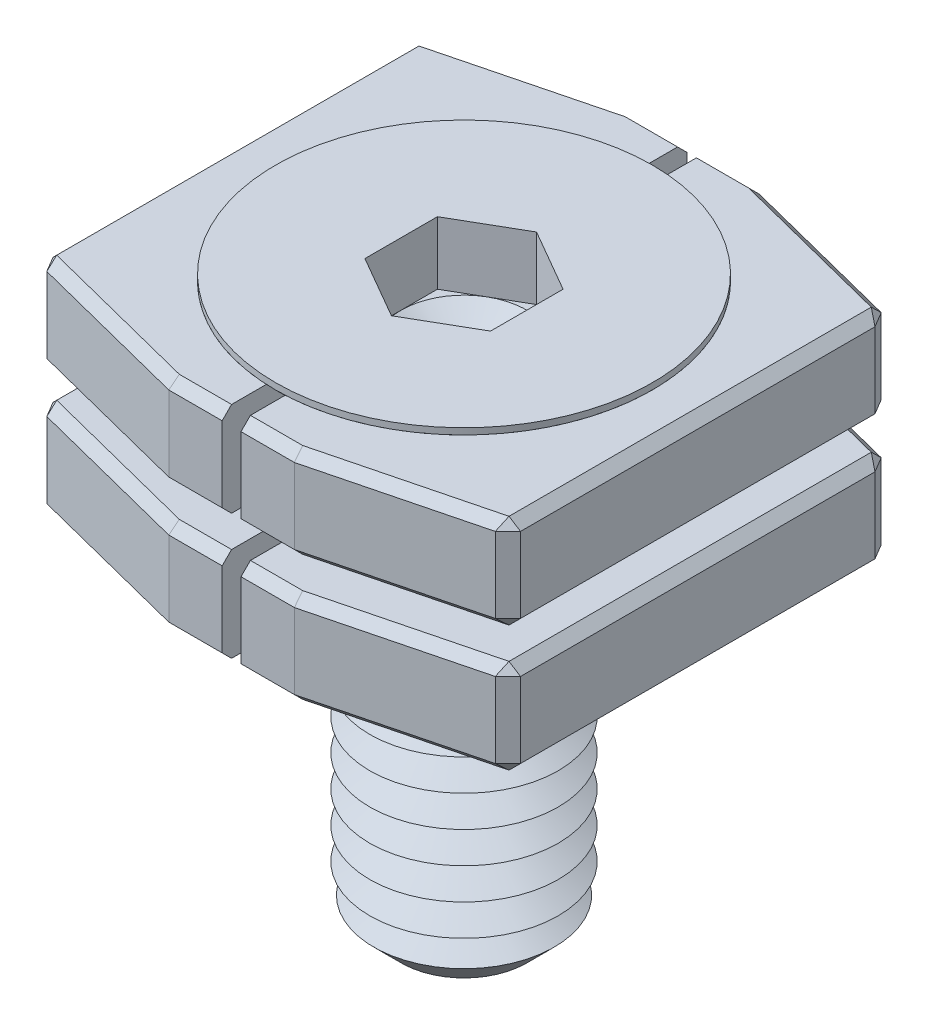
ISO-10303-21;
HEADER;
FILE_DESCRIPTION(('STEP AP214'),'2;1');
FILE_NAME('part.step','',(''),(''),'','','');
FILE_SCHEMA(('AUTOMOTIVE_DESIGN { 1 0 10303 214 1 1 1 1 }'));
ENDSEC;
DATA;
#1=APPLICATION_CONTEXT('core data for automotive mechanical design processes');
#2=APPLICATION_PROTOCOL_DEFINITION('international standard','automotive_design',2000,#1);
#3=PRODUCT_CONTEXT('',#1,'mechanical');
#4=PRODUCT('Part','Part','',(#3));
#5=PRODUCT_RELATED_PRODUCT_CATEGORY('part','',(#4));
#6=PRODUCT_DEFINITION_FORMATION('','',#4);
#7=PRODUCT_DEFINITION_CONTEXT('part definition',#1,'design');
#8=PRODUCT_DEFINITION('design','',#6,#7);
#9=PRODUCT_DEFINITION_SHAPE('','',#8);
#10=(LENGTH_UNIT() NAMED_UNIT(*) SI_UNIT(.MILLI.,.METRE.));
#11=(NAMED_UNIT(*) PLANE_ANGLE_UNIT() SI_UNIT($,.RADIAN.));
#12=(NAMED_UNIT(*) SI_UNIT($,.STERADIAN.) SOLID_ANGLE_UNIT());
#13=UNCERTAINTY_MEASURE_WITH_UNIT(LENGTH_MEASURE(1.E-05),#10,'distance_accuracy_value','');
#14=(GEOMETRIC_REPRESENTATION_CONTEXT(3) GLOBAL_UNCERTAINTY_ASSIGNED_CONTEXT((#13)) GLOBAL_UNIT_ASSIGNED_CONTEXT((#10,
#11,#12)) REPRESENTATION_CONTEXT('',''));
#15=CARTESIAN_POINT('',(0.,0.,0.));
#16=DIRECTION('',(0.,0.,1.));
#17=DIRECTION('',(1.,0.,0.));
#18=AXIS2_PLACEMENT_3D('',#15,#16,#17);
#19=CARTESIAN_POINT('',(0.,-1.8,0.));
#20=DIRECTION('',(0.,1.,0.));
#21=DIRECTION('',(0.,0.,1.));
#22=AXIS2_PLACEMENT_3D('',#19,#20,#21);
#23=PLANE('',#22);
#24=CARTESIAN_POINT('',(0.,-1.8,0.));
#25=DIRECTION('',(0.,1.,0.));
#26=DIRECTION('',(0.,0.,1.));
#27=AXIS2_PLACEMENT_3D('',#24,#25,#26);
#28=CIRCLE('',#27,2.);
#29=CARTESIAN_POINT('',(0.999999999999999,-1.8,1.73205080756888));
#30=VERTEX_POINT('',#29);
#31=CARTESIAN_POINT('',(2.,-1.8,0.));
#32=VERTEX_POINT('',#31);
#33=EDGE_CURVE('P0_E94',#30,#32,#28,.T.);
#34=ORIENTED_EDGE('',*,*,#33,.F.);
#35=DIRECTION('',(0.866025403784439,0.,-0.5));
#36=VECTOR('',#35,1.);
#37=CARTESIAN_POINT('',(0.,-1.8,2.3094010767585));
#38=LINE('',#37,#36);
#39=CARTESIAN_POINT('',(2.,-1.8,1.15470053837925));
#40=VERTEX_POINT('',#39);
#41=EDGE_CURVE('P0_E117',#30,#40,#38,.T.);
#42=ORIENTED_EDGE('',*,*,#41,.T.);
#43=DIRECTION('',(0.,0.,-1.));
#44=VECTOR('',#43,1.);
#45=CARTESIAN_POINT('',(2.,-1.8,1.15470053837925));
#46=LINE('',#45,#44);
#47=EDGE_CURVE('P0_E113',#40,#32,#46,.T.);
#48=ORIENTED_EDGE('',*,*,#47,.T.);
#49=EDGE_LOOP('',(#34,#42,#48));
#50=FACE_BOUND('',#49,.T.);
#51=ADVANCED_FACE('P0_F16',(#50),#23,.T.);
#52=CARTESIAN_POINT('',(0.,-1.8,0.));
#53=DIRECTION('',(0.,1.,0.));
#54=DIRECTION('',(0.,0.,1.));
#55=AXIS2_PLACEMENT_3D('',#52,#53,#54);
#56=CIRCLE('',#55,2.);
#57=CARTESIAN_POINT('',(1.,-1.8,-1.73205080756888));
#58=VERTEX_POINT('',#57);
#59=EDGE_CURVE('P0_E11',#32,#58,#56,.T.);
#60=ORIENTED_EDGE('',*,*,#59,.F.);
#61=CARTESIAN_POINT('',(2.,-1.8,-1.15470053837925));
#62=VERTEX_POINT('',#61);
#63=EDGE_CURVE('P0_E105',#32,#62,#46,.T.);
#64=ORIENTED_EDGE('',*,*,#63,.T.);
#65=DIRECTION('',(-0.866025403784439,0.,-0.5));
#66=VECTOR('',#65,1.);
#67=CARTESIAN_POINT('',(2.,-1.8,-1.15470053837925));
#68=LINE('',#67,#66);
#69=EDGE_CURVE('P0_E108',#62,#58,#68,.T.);
#70=ORIENTED_EDGE('',*,*,#69,.T.);
#71=EDGE_LOOP('',(#60,#64,#70));
#72=FACE_BOUND('',#71,.T.);
#73=ADVANCED_FACE('P0_F104',(#72),#23,.T.);
#74=CARTESIAN_POINT('',(-0.999999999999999,-1.8,-1.73205080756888));
#75=VERTEX_POINT('',#74);
#76=EDGE_CURVE('P0_E25',#58,#75,#56,.T.);
#77=ORIENTED_EDGE('',*,*,#76,.F.);
#78=CARTESIAN_POINT('',(0.,-1.8,-2.3094010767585));
#79=VERTEX_POINT('',#78);
#80=EDGE_CURVE('P0_E140',#58,#79,#68,.T.);
#81=ORIENTED_EDGE('',*,*,#80,.T.);
#82=DIRECTION('',(-0.866025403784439,0.,0.5));
#83=VECTOR('',#82,1.);
#84=CARTESIAN_POINT('',(0.,-1.8,-2.3094010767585));
#85=LINE('',#84,#83);
#86=EDGE_CURVE('P0_E303',#79,#75,#85,.T.);
#87=ORIENTED_EDGE('',*,*,#86,.T.);
#88=EDGE_LOOP('',(#77,#81,#87));
#89=FACE_BOUND('',#88,.T.);
#90=ADVANCED_FACE('P0_F269',(#89),#23,.T.);
#91=CARTESIAN_POINT('',(-2.,-1.8,0.));
#92=VERTEX_POINT('',#91);
#93=EDGE_CURVE('P0_E298',#75,#92,#56,.T.);
#94=ORIENTED_EDGE('',*,*,#93,.F.);
#95=CARTESIAN_POINT('',(-2.,-1.8,-1.15470053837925));
#96=VERTEX_POINT('',#95);
#97=EDGE_CURVE('P0_E307',#75,#96,#85,.T.);
#98=ORIENTED_EDGE('',*,*,#97,.T.);
#99=DIRECTION('',(0.,0.,1.));
#100=VECTOR('',#99,1.);
#101=CARTESIAN_POINT('',(-2.,-1.8,-1.15470053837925));
#102=LINE('',#101,#100);
#103=EDGE_CURVE('P0_E302',#96,#92,#102,.T.);
#104=ORIENTED_EDGE('',*,*,#103,.T.);
#105=EDGE_LOOP('',(#94,#98,#104));
#106=FACE_BOUND('',#105,.T.);
#107=ADVANCED_FACE('P0_F283',(#106),#23,.T.);
#108=CARTESIAN_POINT('',(-1.,-1.8,1.73205080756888));
#109=VERTEX_POINT('',#108);
#110=EDGE_CURVE('P0_E32',#92,#109,#56,.T.);
#111=ORIENTED_EDGE('',*,*,#110,.F.);
#112=CARTESIAN_POINT('',(-2.,-1.8,1.15470053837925));
#113=VERTEX_POINT('',#112);
#114=EDGE_CURVE('P0_E294',#92,#113,#102,.T.);
#115=ORIENTED_EDGE('',*,*,#114,.T.);
#116=DIRECTION('',(0.866025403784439,0.,0.5));
#117=VECTOR('',#116,1.);
#118=CARTESIAN_POINT('',(-2.,-1.8,1.15470053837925));
#119=LINE('',#118,#117);
#120=EDGE_CURVE('P0_E297',#113,#109,#119,.T.);
#121=ORIENTED_EDGE('',*,*,#120,.T.);
#122=EDGE_LOOP('',(#111,#115,#121));
#123=FACE_BOUND('',#122,.T.);
#124=ADVANCED_FACE('P0_F274',(#123),#23,.T.);
#125=CARTESIAN_POINT('',(0.,0.2,0.));
#126=DIRECTION('',(0.,1.,0.));
#127=DIRECTION('',(0.,0.,1.));
#128=AXIS2_PLACEMENT_3D('',#125,#126,#127);
#129=PLANE('',#128);
#130=DIRECTION('',(-0.866025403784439,0.,-0.5));
#131=VECTOR('',#130,1.);
#132=CARTESIAN_POINT('',(2.,0.2,-1.15470053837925));
#133=LINE('',#132,#131);
#134=CARTESIAN_POINT('',(2.,0.2,-1.15470053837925));
#135=VERTEX_POINT('',#134);
#136=CARTESIAN_POINT('',(0.,0.2,-2.3094010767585));
#137=VERTEX_POINT('',#136);
#138=EDGE_CURVE('P0_E40',#135,#137,#133,.T.);
#139=ORIENTED_EDGE('',*,*,#138,.F.);
#140=DIRECTION('',(0.,0.,-1.));
#141=VECTOR('',#140,1.);
#142=CARTESIAN_POINT('',(2.,0.2,1.15470053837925));
#143=LINE('',#142,#141);
#144=CARTESIAN_POINT('',(2.,0.2,1.15470053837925));
#145=VERTEX_POINT('',#144);
#146=EDGE_CURVE('P0_E138',#145,#135,#143,.T.);
#147=ORIENTED_EDGE('',*,*,#146,.F.);
#148=DIRECTION('',(0.866025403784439,0.,-0.5));
#149=VECTOR('',#148,1.);
#150=CARTESIAN_POINT('',(0.,0.2,2.3094010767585));
#151=LINE('',#150,#149);
#152=CARTESIAN_POINT('',(0.,0.2,2.3094010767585));
#153=VERTEX_POINT('',#152);
#154=EDGE_CURVE('P0_E135',#153,#145,#151,.T.);
#155=ORIENTED_EDGE('',*,*,#154,.F.);
#156=DIRECTION('',(0.866025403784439,0.,0.5));
#157=VECTOR('',#156,1.);
#158=CARTESIAN_POINT('',(-2.,0.2,1.15470053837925));
#159=LINE('',#158,#157);
#160=CARTESIAN_POINT('',(-2.,0.2,1.15470053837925));
#161=VERTEX_POINT('',#160);
#162=EDGE_CURVE('P0_E132',#161,#153,#159,.T.);
#163=ORIENTED_EDGE('',*,*,#162,.F.);
#164=DIRECTION('',(0.,0.,1.));
#165=VECTOR('',#164,1.);
#166=CARTESIAN_POINT('',(-2.,0.2,-1.15470053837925));
#167=LINE('',#166,#165);
#168=CARTESIAN_POINT('',(-2.,0.2,-1.15470053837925));
#169=VERTEX_POINT('',#168);
#170=EDGE_CURVE('P0_E129',#169,#161,#167,.T.);
#171=ORIENTED_EDGE('',*,*,#170,.F.);
#172=DIRECTION('',(-0.866025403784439,0.,0.5));
#173=VECTOR('',#172,1.);
#174=CARTESIAN_POINT('',(0.,0.2,-2.3094010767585));
#175=LINE('',#174,#173);
#176=EDGE_CURVE('P0_E126',#137,#169,#175,.T.);
#177=ORIENTED_EDGE('',*,*,#176,.F.);
#178=EDGE_LOOP('',(#139,#147,#155,#163,#171,#177));
#179=FACE_BOUND('',#178,.T.);
#180=CARTESIAN_POINT('',(0.,0.2,0.));
#181=DIRECTION('',(0.,1.,0.));
#182=DIRECTION('',(0.,0.,1.));
#183=AXIS2_PLACEMENT_3D('',#180,#181,#182);
#184=CIRCLE('',#183,6.);
#185=CARTESIAN_POINT('',(0.,0.2,6.));
#186=VERTEX_POINT('',#185);
#187=EDGE_CURVE('P0_E237',#186,#186,#184,.T.);
#188=ORIENTED_EDGE('',*,*,#187,.T.);
#189=EDGE_LOOP('',(#188));
#190=FACE_BOUND('',#189,.T.);
#191=ADVANCED_FACE('P0_F282',(#179,#190),#129,.T.);
#192=CARTESIAN_POINT('',(0.,63.2354418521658,0.));
#193=DIRECTION('',(0.,1.,0.));
#194=DIRECTION('',(0.,0.,1.));
#195=AXIS2_PLACEMENT_3D('',#192,#193,#194);
#196=CYLINDRICAL_SURFACE('',#195,6.);
#197=CARTESIAN_POINT('',(0.,0.,0.));
#198=DIRECTION('',(0.,1.,0.));
#199=DIRECTION('',(0.,0.,1.));
#200=AXIS2_PLACEMENT_3D('',#197,#198,#199);
#201=CIRCLE('',#200,6.);
#202=CARTESIAN_POINT('',(0.,0.,6.));
#203=VERTEX_POINT('',#202);
#204=EDGE_CURVE('P0_E234',#203,#203,#201,.T.);
#205=ORIENTED_EDGE('',*,*,#204,.T.);
#206=EDGE_LOOP('',(#205));
#207=FACE_BOUND('',#206,.T.);
#208=ORIENTED_EDGE('',*,*,#187,.F.);
#209=EDGE_LOOP('',(#208));
#210=FACE_BOUND('',#209,.T.);
#211=ADVANCED_FACE('P0_F289',(#207,#210),#196,.T.);
#212=CARTESIAN_POINT('',(0.,0.,0.));
#213=DIRECTION('',(0.,1.,0.));
#214=DIRECTION('',(0.,0.,1.));
#215=AXIS2_PLACEMENT_3D('',#212,#213,#214);
#216=CONICAL_SURFACE('',#215,6.,0.78539816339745);
#217=CARTESIAN_POINT('',(0.,-2.99999999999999,0.));
#218=DIRECTION('',(0.,1.,0.));
#219=DIRECTION('',(0.,0.,1.));
#220=AXIS2_PLACEMENT_3D('',#217,#218,#219);
#221=CIRCLE('',#220,3.);
#222=CARTESIAN_POINT('',(0.,-2.99999999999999,3.));
#223=VERTEX_POINT('',#222);
#224=EDGE_CURVE('P0_E231',#223,#223,#221,.T.);
#225=ORIENTED_EDGE('',*,*,#224,.T.);
#226=EDGE_LOOP('',(#225));
#227=FACE_BOUND('',#226,.T.);
#228=ORIENTED_EDGE('',*,*,#204,.F.);
#229=EDGE_LOOP('',(#228));
#230=FACE_BOUND('',#229,.T.);
#231=ADVANCED_FACE('P0_F361',(#227,#230),#216,.T.);
#232=CARTESIAN_POINT('',(0.,-3.49999999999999,0.));
#233=DIRECTION('',(0.,1.,0.));
#234=DIRECTION('',(0.,0.,1.));
#235=AXIS2_PLACEMENT_3D('',#232,#233,#234);
#236=CONICAL_SURFACE('',#235,2.13397459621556,1.0471975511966);
#237=ORIENTED_EDGE('',*,*,#224,.F.);
#238=EDGE_LOOP('',(#237));
#239=FACE_BOUND('',#238,.T.);
#240=CARTESIAN_POINT('',(0.,-3.49999999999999,0.));
#241=DIRECTION('',(0.,1.,0.));
#242=DIRECTION('',(0.,0.,1.));
#243=AXIS2_PLACEMENT_3D('',#240,#241,#242);
#244=CIRCLE('',#243,2.13397459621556);
#245=CARTESIAN_POINT('',(0.,-3.49999999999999,2.13397459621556));
#246=VERTEX_POINT('',#245);
#247=EDGE_CURVE('P0_E228',#246,#246,#244,.T.);
#248=ORIENTED_EDGE('',*,*,#247,.T.);
#249=EDGE_LOOP('',(#248));
#250=FACE_BOUND('',#249,.T.);
#251=ADVANCED_FACE('P0_F371',(#239,#250),#236,.T.);
#252=CARTESIAN_POINT('',(0.,-4.,0.));
#253=DIRECTION('',(0.,-1.,0.));
#254=DIRECTION('',(0.,0.,-1.));
#255=AXIS2_PLACEMENT_3D('',#252,#253,#254);
#256=CONICAL_SURFACE('',#255,3.,1.0471975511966);
#257=ORIENTED_EDGE('',*,*,#247,.F.);
#258=EDGE_LOOP('',(#257));
#259=FACE_BOUND('',#258,.T.);
#260=CARTESIAN_POINT('',(0.,-3.99999999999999,0.));
#261=DIRECTION('',(0.,1.,0.));
#262=DIRECTION('',(0.,0.,1.));
#263=AXIS2_PLACEMENT_3D('',#260,#261,#262);
#264=CIRCLE('',#263,3.);
#265=CARTESIAN_POINT('',(0.,-3.99999999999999,3.));
#266=VERTEX_POINT('',#265);
#267=EDGE_CURVE('P0_E225',#266,#266,#264,.T.);
#268=ORIENTED_EDGE('',*,*,#267,.T.);
#269=EDGE_LOOP('',(#268));
#270=FACE_BOUND('',#269,.T.);
#271=ADVANCED_FACE('P0_F380',(#259,#270),#256,.T.);
#272=CARTESIAN_POINT('',(0.,-4.5,0.));
#273=DIRECTION('',(0.,1.,0.));
#274=DIRECTION('',(0.,0.,1.));
#275=AXIS2_PLACEMENT_3D('',#272,#273,#274);
#276=CONICAL_SURFACE('',#275,2.13397459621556,1.0471975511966);
#277=ORIENTED_EDGE('',*,*,#267,.F.);
#278=EDGE_LOOP('',(#277));
#279=FACE_BOUND('',#278,.T.);
#280=CARTESIAN_POINT('',(0.,-4.5,0.));
#281=DIRECTION('',(0.,1.,0.));
#282=DIRECTION('',(0.,0.,1.));
#283=AXIS2_PLACEMENT_3D('',#280,#281,#282);
#284=CIRCLE('',#283,2.13397459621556);
#285=CARTESIAN_POINT('',(0.,-4.5,2.13397459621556));
#286=VERTEX_POINT('',#285);
#287=EDGE_CURVE('P0_E222',#286,#286,#284,.T.);
#288=ORIENTED_EDGE('',*,*,#287,.T.);
#289=EDGE_LOOP('',(#288));
#290=FACE_BOUND('',#289,.T.);
#291=ADVANCED_FACE('P0_F389',(#279,#290),#276,.T.);
#292=CARTESIAN_POINT('',(0.,-5.,0.));
#293=DIRECTION('',(0.,-1.,0.));
#294=DIRECTION('',(0.,0.,-1.));
#295=AXIS2_PLACEMENT_3D('',#292,#293,#294);
#296=CONICAL_SURFACE('',#295,3.,1.0471975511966);
#297=ORIENTED_EDGE('',*,*,#287,.F.);
#298=EDGE_LOOP('',(#297));
#299=FACE_BOUND('',#298,.T.);
#300=CARTESIAN_POINT('',(0.,-4.99999999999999,0.));
#301=DIRECTION('',(0.,1.,0.));
#302=DIRECTION('',(0.,0.,1.));
#303=AXIS2_PLACEMENT_3D('',#300,#301,#302);
#304=CIRCLE('',#303,3.);
#305=CARTESIAN_POINT('',(0.,-4.99999999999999,3.));
#306=VERTEX_POINT('',#305);
#307=EDGE_CURVE('P0_E219',#306,#306,#304,.T.);
#308=ORIENTED_EDGE('',*,*,#307,.T.);
#309=EDGE_LOOP('',(#308));
#310=FACE_BOUND('',#309,.T.);
#311=ADVANCED_FACE('P0_F399',(#299,#310),#296,.T.);
#312=CARTESIAN_POINT('',(0.,-5.5,0.));
#313=DIRECTION('',(0.,1.,0.));
#314=DIRECTION('',(0.,0.,1.));
#315=AXIS2_PLACEMENT_3D('',#312,#313,#314);
#316=CONICAL_SURFACE('',#315,2.13397459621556,1.0471975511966);
#317=ORIENTED_EDGE('',*,*,#307,.F.);
#318=EDGE_LOOP('',(#317));
#319=FACE_BOUND('',#318,.T.);
#320=CARTESIAN_POINT('',(0.,-5.5,0.));
#321=DIRECTION('',(0.,1.,0.));
#322=DIRECTION('',(0.,0.,1.));
#323=AXIS2_PLACEMENT_3D('',#320,#321,#322);
#324=CIRCLE('',#323,2.13397459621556);
#325=CARTESIAN_POINT('',(0.,-5.5,2.13397459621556));
#326=VERTEX_POINT('',#325);
#327=EDGE_CURVE('P0_E216',#326,#326,#324,.T.);
#328=ORIENTED_EDGE('',*,*,#327,.T.);
#329=EDGE_LOOP('',(#328));
#330=FACE_BOUND('',#329,.T.);
#331=ADVANCED_FACE('P0_F409',(#319,#330),#316,.T.);
#332=CARTESIAN_POINT('',(0.,-6.,0.));
#333=DIRECTION('',(0.,-1.,0.));
#334=DIRECTION('',(0.,0.,-1.));
#335=AXIS2_PLACEMENT_3D('',#332,#333,#334);
#336=CONICAL_SURFACE('',#335,3.,1.0471975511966);
#337=ORIENTED_EDGE('',*,*,#327,.F.);
#338=EDGE_LOOP('',(#337));
#339=FACE_BOUND('',#338,.T.);
#340=CARTESIAN_POINT('',(0.,-5.99999999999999,0.));
#341=DIRECTION('',(0.,1.,0.));
#342=DIRECTION('',(0.,0.,1.));
#343=AXIS2_PLACEMENT_3D('',#340,#341,#342);
#344=CIRCLE('',#343,3.);
#345=CARTESIAN_POINT('',(0.,-5.99999999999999,3.));
#346=VERTEX_POINT('',#345);
#347=EDGE_CURVE('P0_E213',#346,#346,#344,.T.);
#348=ORIENTED_EDGE('',*,*,#347,.T.);
#349=EDGE_LOOP('',(#348));
#350=FACE_BOUND('',#349,.T.);
#351=ADVANCED_FACE('P0_F419',(#339,#350),#336,.T.);
#352=CARTESIAN_POINT('',(0.,-6.5,0.));
#353=DIRECTION('',(0.,1.,0.));
#354=DIRECTION('',(0.,0.,1.));
#355=AXIS2_PLACEMENT_3D('',#352,#353,#354);
#356=CONICAL_SURFACE('',#355,2.13397459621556,1.0471975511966);
#357=ORIENTED_EDGE('',*,*,#347,.F.);
#358=EDGE_LOOP('',(#357));
#359=FACE_BOUND('',#358,.T.);
#360=CARTESIAN_POINT('',(0.,-6.5,0.));
#361=DIRECTION('',(0.,1.,0.));
#362=DIRECTION('',(0.,0.,1.));
#363=AXIS2_PLACEMENT_3D('',#360,#361,#362);
#364=CIRCLE('',#363,2.13397459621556);
#365=CARTESIAN_POINT('',(0.,-6.5,2.13397459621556));
#366=VERTEX_POINT('',#365);
#367=EDGE_CURVE('P0_E210',#366,#366,#364,.T.);
#368=ORIENTED_EDGE('',*,*,#367,.T.);
#369=EDGE_LOOP('',(#368));
#370=FACE_BOUND('',#369,.T.);
#371=ADVANCED_FACE('P0_F429',(#359,#370),#356,.T.);
#372=CARTESIAN_POINT('',(0.,-7.,0.));
#373=DIRECTION('',(0.,-1.,0.));
#374=DIRECTION('',(0.,0.,-1.));
#375=AXIS2_PLACEMENT_3D('',#372,#373,#374);
#376=CONICAL_SURFACE('',#375,3.,1.0471975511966);
#377=ORIENTED_EDGE('',*,*,#367,.F.);
#378=EDGE_LOOP('',(#377));
#379=FACE_BOUND('',#378,.T.);
#380=CARTESIAN_POINT('',(0.,-6.99999999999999,0.));
#381=DIRECTION('',(0.,1.,0.));
#382=DIRECTION('',(0.,0.,1.));
#383=AXIS2_PLACEMENT_3D('',#380,#381,#382);
#384=CIRCLE('',#383,3.);
#385=CARTESIAN_POINT('',(0.,-6.99999999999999,3.));
#386=VERTEX_POINT('',#385);
#387=EDGE_CURVE('P0_E207',#386,#386,#384,.T.);
#388=ORIENTED_EDGE('',*,*,#387,.T.);
#389=EDGE_LOOP('',(#388));
#390=FACE_BOUND('',#389,.T.);
#391=ADVANCED_FACE('P0_F439',(#379,#390),#376,.T.);
#392=CARTESIAN_POINT('',(0.,-7.5,0.));
#393=DIRECTION('',(0.,1.,0.));
#394=DIRECTION('',(0.,0.,1.));
#395=AXIS2_PLACEMENT_3D('',#392,#393,#394);
#396=CONICAL_SURFACE('',#395,2.13397459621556,1.0471975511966);
#397=ORIENTED_EDGE('',*,*,#387,.F.);
#398=EDGE_LOOP('',(#397));
#399=FACE_BOUND('',#398,.T.);
#400=CARTESIAN_POINT('',(0.,-7.5,0.));
#401=DIRECTION('',(0.,1.,0.));
#402=DIRECTION('',(0.,0.,1.));
#403=AXIS2_PLACEMENT_3D('',#400,#401,#402);
#404=CIRCLE('',#403,2.13397459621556);
#405=CARTESIAN_POINT('',(0.,-7.5,2.13397459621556));
#406=VERTEX_POINT('',#405);
#407=EDGE_CURVE('P0_E204',#406,#406,#404,.T.);
#408=ORIENTED_EDGE('',*,*,#407,.T.);
#409=EDGE_LOOP('',(#408));
#410=FACE_BOUND('',#409,.T.);
#411=ADVANCED_FACE('P0_F449',(#399,#410),#396,.T.);
#412=CARTESIAN_POINT('',(0.,-7.99999999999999,0.));
#413=DIRECTION('',(0.,-1.,0.));
#414=DIRECTION('',(0.,0.,-1.));
#415=AXIS2_PLACEMENT_3D('',#412,#413,#414);
#416=CONICAL_SURFACE('',#415,3.,1.0471975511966);
#417=ORIENTED_EDGE('',*,*,#407,.F.);
#418=EDGE_LOOP('',(#417));
#419=FACE_BOUND('',#418,.T.);
#420=CARTESIAN_POINT('',(0.,-7.99999999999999,0.));
#421=DIRECTION('',(0.,1.,0.));
#422=DIRECTION('',(0.,0.,1.));
#423=AXIS2_PLACEMENT_3D('',#420,#421,#422);
#424=CIRCLE('',#423,3.);
#425=CARTESIAN_POINT('',(0.,-7.99999999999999,3.));
#426=VERTEX_POINT('',#425);
#427=EDGE_CURVE('P0_E201',#426,#426,#424,.T.);
#428=ORIENTED_EDGE('',*,*,#427,.T.);
#429=EDGE_LOOP('',(#428));
#430=FACE_BOUND('',#429,.T.);
#431=ADVANCED_FACE('P0_F459',(#419,#430),#416,.T.);
#432=CARTESIAN_POINT('',(0.,-8.49999999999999,0.));
#433=DIRECTION('',(0.,1.,0.));
#434=DIRECTION('',(0.,0.,1.));
#435=AXIS2_PLACEMENT_3D('',#432,#433,#434);
#436=CONICAL_SURFACE('',#435,2.13397459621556,1.0471975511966);
#437=ORIENTED_EDGE('',*,*,#427,.F.);
#438=EDGE_LOOP('',(#437));
#439=FACE_BOUND('',#438,.T.);
#440=CARTESIAN_POINT('',(0.,-8.49999999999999,0.));
#441=DIRECTION('',(0.,1.,0.));
#442=DIRECTION('',(0.,0.,1.));
#443=AXIS2_PLACEMENT_3D('',#440,#441,#442);
#444=CIRCLE('',#443,2.13397459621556);
#445=CARTESIAN_POINT('',(0.,-8.49999999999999,2.13397459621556));
#446=VERTEX_POINT('',#445);
#447=EDGE_CURVE('P0_E198',#446,#446,#444,.T.);
#448=ORIENTED_EDGE('',*,*,#447,.T.);
#449=EDGE_LOOP('',(#448));
#450=FACE_BOUND('',#449,.T.);
#451=ADVANCED_FACE('P0_F469',(#439,#450),#436,.T.);
#452=CARTESIAN_POINT('',(0.,-9.,0.));
#453=DIRECTION('',(0.,-1.,0.));
#454=DIRECTION('',(0.,0.,-1.));
#455=AXIS2_PLACEMENT_3D('',#452,#453,#454);
#456=CONICAL_SURFACE('',#455,3.,1.0471975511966);
#457=ORIENTED_EDGE('',*,*,#447,.F.);
#458=EDGE_LOOP('',(#457));
#459=FACE_BOUND('',#458,.T.);
#460=CARTESIAN_POINT('',(0.,-8.99999999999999,0.));
#461=DIRECTION('',(0.,1.,0.));
#462=DIRECTION('',(0.,0.,1.));
#463=AXIS2_PLACEMENT_3D('',#460,#461,#462);
#464=CIRCLE('',#463,3.);
#465=CARTESIAN_POINT('',(0.,-8.99999999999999,3.));
#466=VERTEX_POINT('',#465);
#467=EDGE_CURVE('P0_E195',#466,#466,#464,.T.);
#468=ORIENTED_EDGE('',*,*,#467,.T.);
#469=EDGE_LOOP('',(#468));
#470=FACE_BOUND('',#469,.T.);
#471=ADVANCED_FACE('P0_F479',(#459,#470),#456,.T.);
#472=CARTESIAN_POINT('',(0.,-9.49999999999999,0.));
#473=DIRECTION('',(0.,1.,0.));
#474=DIRECTION('',(0.,0.,1.));
#475=AXIS2_PLACEMENT_3D('',#472,#473,#474);
#476=CONICAL_SURFACE('',#475,2.13397459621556,1.0471975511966);
#477=ORIENTED_EDGE('',*,*,#467,.F.);
#478=EDGE_LOOP('',(#477));
#479=FACE_BOUND('',#478,.T.);
#480=CARTESIAN_POINT('',(0.,-9.49999999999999,0.));
#481=DIRECTION('',(0.,1.,0.));
#482=DIRECTION('',(0.,0.,1.));
#483=AXIS2_PLACEMENT_3D('',#480,#481,#482);
#484=CIRCLE('',#483,2.13397459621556);
#485=CARTESIAN_POINT('',(0.,-9.49999999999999,2.13397459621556));
#486=VERTEX_POINT('',#485);
#487=EDGE_CURVE('P0_E192',#486,#486,#484,.T.);
#488=ORIENTED_EDGE('',*,*,#487,.T.);
#489=EDGE_LOOP('',(#488));
#490=FACE_BOUND('',#489,.T.);
#491=ADVANCED_FACE('P0_F489',(#479,#490),#476,.T.);
#492=CARTESIAN_POINT('',(0.,-9.99999999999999,0.));
#493=DIRECTION('',(0.,-1.,0.));
#494=DIRECTION('',(0.,0.,-1.));
#495=AXIS2_PLACEMENT_3D('',#492,#493,#494);
#496=CONICAL_SURFACE('',#495,3.,1.0471975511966);
#497=ORIENTED_EDGE('',*,*,#487,.F.);
#498=EDGE_LOOP('',(#497));
#499=FACE_BOUND('',#498,.T.);
#500=CARTESIAN_POINT('',(0.,-9.99999999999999,0.));
#501=DIRECTION('',(0.,1.,0.));
#502=DIRECTION('',(0.,0.,1.));
#503=AXIS2_PLACEMENT_3D('',#500,#501,#502);
#504=CIRCLE('',#503,3.);
#505=CARTESIAN_POINT('',(0.,-9.99999999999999,3.));
#506=VERTEX_POINT('',#505);
#507=EDGE_CURVE('P0_E189',#506,#506,#504,.T.);
#508=ORIENTED_EDGE('',*,*,#507,.T.);
#509=EDGE_LOOP('',(#508));
#510=FACE_BOUND('',#509,.T.);
#511=ADVANCED_FACE('P0_F499',(#499,#510),#496,.T.);
#512=CARTESIAN_POINT('',(0.,-10.5,0.));
#513=DIRECTION('',(0.,1.,0.));
#514=DIRECTION('',(0.,0.,1.));
#515=AXIS2_PLACEMENT_3D('',#512,#513,#514);
#516=CONICAL_SURFACE('',#515,2.13397459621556,1.0471975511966);
#517=ORIENTED_EDGE('',*,*,#507,.F.);
#518=EDGE_LOOP('',(#517));
#519=FACE_BOUND('',#518,.T.);
#520=CARTESIAN_POINT('',(0.,-10.5,0.));
#521=DIRECTION('',(0.,1.,0.));
#522=DIRECTION('',(0.,0.,1.));
#523=AXIS2_PLACEMENT_3D('',#520,#521,#522);
#524=CIRCLE('',#523,2.13397459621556);
#525=CARTESIAN_POINT('',(0.,-10.5,2.13397459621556));
#526=VERTEX_POINT('',#525);
#527=EDGE_CURVE('P0_E186',#526,#526,#524,.T.);
#528=ORIENTED_EDGE('',*,*,#527,.T.);
#529=EDGE_LOOP('',(#528));
#530=FACE_BOUND('',#529,.T.);
#531=ADVANCED_FACE('P0_F509',(#519,#530),#516,.T.);
#532=CARTESIAN_POINT('',(0.,-11.,0.));
#533=DIRECTION('',(0.,-1.,0.));
#534=DIRECTION('',(0.,0.,-1.));
#535=AXIS2_PLACEMENT_3D('',#532,#533,#534);
#536=CONICAL_SURFACE('',#535,3.,1.0471975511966);
#537=ORIENTED_EDGE('',*,*,#527,.F.);
#538=EDGE_LOOP('',(#537));
#539=FACE_BOUND('',#538,.T.);
#540=CARTESIAN_POINT('',(0.,-11.,0.));
#541=DIRECTION('',(0.,1.,0.));
#542=DIRECTION('',(0.,0.,1.));
#543=AXIS2_PLACEMENT_3D('',#540,#541,#542);
#544=CIRCLE('',#543,3.);
#545=CARTESIAN_POINT('',(0.,-11.,3.));
#546=VERTEX_POINT('',#545);
#547=EDGE_CURVE('P0_E183',#546,#546,#544,.T.);
#548=ORIENTED_EDGE('',*,*,#547,.T.);
#549=EDGE_LOOP('',(#548));
#550=FACE_BOUND('',#549,.T.);
#551=ADVANCED_FACE('P0_F519',(#539,#550),#536,.T.);
#552=CARTESIAN_POINT('',(0.,-11.5,0.));
#553=DIRECTION('',(0.,1.,0.));
#554=DIRECTION('',(0.,0.,1.));
#555=AXIS2_PLACEMENT_3D('',#552,#553,#554);
#556=CONICAL_SURFACE('',#555,2.13397459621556,1.0471975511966);
#557=ORIENTED_EDGE('',*,*,#547,.F.);
#558=EDGE_LOOP('',(#557));
#559=FACE_BOUND('',#558,.T.);
#560=CARTESIAN_POINT('',(0.,-11.5,0.));
#561=DIRECTION('',(0.,1.,0.));
#562=DIRECTION('',(0.,0.,1.));
#563=AXIS2_PLACEMENT_3D('',#560,#561,#562);
#564=CIRCLE('',#563,2.13397459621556);
#565=CARTESIAN_POINT('',(0.,-11.5,2.13397459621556));
#566=VERTEX_POINT('',#565);
#567=EDGE_CURVE('P0_E180',#566,#566,#564,.T.);
#568=ORIENTED_EDGE('',*,*,#567,.T.);
#569=EDGE_LOOP('',(#568));
#570=FACE_BOUND('',#569,.T.);
#571=ADVANCED_FACE('P0_F529',(#559,#570),#556,.T.);
#572=CARTESIAN_POINT('',(0.,-12.,0.));
#573=DIRECTION('',(0.,-1.,0.));
#574=DIRECTION('',(0.,0.,-1.));
#575=AXIS2_PLACEMENT_3D('',#572,#573,#574);
#576=CONICAL_SURFACE('',#575,3.,1.0471975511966);
#577=ORIENTED_EDGE('',*,*,#567,.F.);
#578=EDGE_LOOP('',(#577));
#579=FACE_BOUND('',#578,.T.);
#580=CARTESIAN_POINT('',(0.,-12.,0.));
#581=DIRECTION('',(0.,1.,0.));
#582=DIRECTION('',(0.,0.,1.));
#583=AXIS2_PLACEMENT_3D('',#580,#581,#582);
#584=CIRCLE('',#583,3.);
#585=CARTESIAN_POINT('',(0.,-12.,3.));
#586=VERTEX_POINT('',#585);
#587=EDGE_CURVE('P0_E177',#586,#586,#584,.T.);
#588=ORIENTED_EDGE('',*,*,#587,.T.);
#589=EDGE_LOOP('',(#588));
#590=FACE_BOUND('',#589,.T.);
#591=ADVANCED_FACE('P0_F539',(#579,#590),#576,.T.);
#592=CARTESIAN_POINT('',(0.,-12.5,0.));
#593=DIRECTION('',(0.,1.,0.));
#594=DIRECTION('',(0.,0.,1.));
#595=AXIS2_PLACEMENT_3D('',#592,#593,#594);
#596=CONICAL_SURFACE('',#595,2.13397459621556,1.0471975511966);
#597=ORIENTED_EDGE('',*,*,#587,.F.);
#598=EDGE_LOOP('',(#597));
#599=FACE_BOUND('',#598,.T.);
#600=CARTESIAN_POINT('',(0.,-12.5,0.));
#601=DIRECTION('',(0.,1.,0.));
#602=DIRECTION('',(0.,0.,1.));
#603=AXIS2_PLACEMENT_3D('',#600,#601,#602);
#604=CIRCLE('',#603,2.13397459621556);
#605=CARTESIAN_POINT('',(0.,-12.5,2.13397459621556));
#606=VERTEX_POINT('',#605);
#607=EDGE_CURVE('P0_E174',#606,#606,#604,.T.);
#608=ORIENTED_EDGE('',*,*,#607,.T.);
#609=EDGE_LOOP('',(#608));
#610=FACE_BOUND('',#609,.T.);
#611=ADVANCED_FACE('P0_F549',(#599,#610),#596,.T.);
#612=CARTESIAN_POINT('',(0.,-13.,0.));
#613=DIRECTION('',(0.,-1.,0.));
#614=DIRECTION('',(0.,0.,-1.));
#615=AXIS2_PLACEMENT_3D('',#612,#613,#614);
#616=CONICAL_SURFACE('',#615,3.,1.0471975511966);
#617=ORIENTED_EDGE('',*,*,#607,.F.);
#618=EDGE_LOOP('',(#617));
#619=FACE_BOUND('',#618,.T.);
#620=CARTESIAN_POINT('',(0.,-13.,0.));
#621=DIRECTION('',(0.,1.,0.));
#622=DIRECTION('',(0.,0.,1.));
#623=AXIS2_PLACEMENT_3D('',#620,#621,#622);
#624=CIRCLE('',#623,3.);
#625=CARTESIAN_POINT('',(0.,-13.,3.));
#626=VERTEX_POINT('',#625);
#627=EDGE_CURVE('P0_E171',#626,#626,#624,.T.);
#628=ORIENTED_EDGE('',*,*,#627,.T.);
#629=EDGE_LOOP('',(#628));
#630=FACE_BOUND('',#629,.T.);
#631=ADVANCED_FACE('P0_F559',(#619,#630),#616,.T.);
#632=CARTESIAN_POINT('',(0.,-13.5,0.));
#633=DIRECTION('',(0.,1.,0.));
#634=DIRECTION('',(0.,0.,1.));
#635=AXIS2_PLACEMENT_3D('',#632,#633,#634);
#636=CONICAL_SURFACE('',#635,2.13397459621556,1.0471975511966);
#637=ORIENTED_EDGE('',*,*,#627,.F.);
#638=EDGE_LOOP('',(#637));
#639=FACE_BOUND('',#638,.T.);
#640=CARTESIAN_POINT('',(0.,-13.5,0.));
#641=DIRECTION('',(0.,1.,0.));
#642=DIRECTION('',(0.,0.,1.));
#643=AXIS2_PLACEMENT_3D('',#640,#641,#642);
#644=CIRCLE('',#643,2.13397459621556);
#645=CARTESIAN_POINT('',(0.,-13.5,2.13397459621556));
#646=VERTEX_POINT('',#645);
#647=EDGE_CURVE('P0_E168',#646,#646,#644,.T.);
#648=ORIENTED_EDGE('',*,*,#647,.T.);
#649=EDGE_LOOP('',(#648));
#650=FACE_BOUND('',#649,.T.);
#651=ADVANCED_FACE('P0_F569',(#639,#650),#636,.T.);
#652=CARTESIAN_POINT('',(0.,-14.,0.));
#653=DIRECTION('',(0.,-1.,0.));
#654=DIRECTION('',(0.,0.,-1.));
#655=AXIS2_PLACEMENT_3D('',#652,#653,#654);
#656=CONICAL_SURFACE('',#655,3.,1.0471975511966);
#657=ORIENTED_EDGE('',*,*,#647,.F.);
#658=EDGE_LOOP('',(#657));
#659=FACE_BOUND('',#658,.T.);
#660=CARTESIAN_POINT('',(0.,-14.,0.));
#661=DIRECTION('',(0.,1.,0.));
#662=DIRECTION('',(0.,0.,1.));
#663=AXIS2_PLACEMENT_3D('',#660,#661,#662);
#664=CIRCLE('',#663,3.);
#665=CARTESIAN_POINT('',(0.,-14.,3.));
#666=VERTEX_POINT('',#665);
#667=EDGE_CURVE('P0_E165',#666,#666,#664,.T.);
#668=ORIENTED_EDGE('',*,*,#667,.T.);
#669=EDGE_LOOP('',(#668));
#670=FACE_BOUND('',#669,.T.);
#671=ADVANCED_FACE('P0_F579',(#659,#670),#656,.T.);
#672=CARTESIAN_POINT('',(0.,-14.5,0.));
#673=DIRECTION('',(0.,1.,0.));
#674=DIRECTION('',(0.,0.,1.));
#675=AXIS2_PLACEMENT_3D('',#672,#673,#674);
#676=CONICAL_SURFACE('',#675,2.13397459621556,1.0471975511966);
#677=ORIENTED_EDGE('',*,*,#667,.F.);
#678=EDGE_LOOP('',(#677));
#679=FACE_BOUND('',#678,.T.);
#680=CARTESIAN_POINT('',(0.,-14.5,0.));
#681=DIRECTION('',(0.,1.,0.));
#682=DIRECTION('',(0.,0.,1.));
#683=AXIS2_PLACEMENT_3D('',#680,#681,#682);
#684=CIRCLE('',#683,2.13397459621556);
#685=CARTESIAN_POINT('',(0.,-14.5,2.13397459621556));
#686=VERTEX_POINT('',#685);
#687=EDGE_CURVE('P0_E162',#686,#686,#684,.T.);
#688=ORIENTED_EDGE('',*,*,#687,.T.);
#689=EDGE_LOOP('',(#688));
#690=FACE_BOUND('',#689,.T.);
#691=ADVANCED_FACE('P0_F589',(#679,#690),#676,.T.);
#692=CARTESIAN_POINT('',(0.,-15.,0.));
#693=DIRECTION('',(0.,-1.,0.));
#694=DIRECTION('',(0.,0.,-1.));
#695=AXIS2_PLACEMENT_3D('',#692,#693,#694);
#696=CONICAL_SURFACE('',#695,3.,1.0471975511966);
#697=ORIENTED_EDGE('',*,*,#687,.F.);
#698=EDGE_LOOP('',(#697));
#699=FACE_BOUND('',#698,.T.);
#700=CARTESIAN_POINT('',(0.,-15.,0.));
#701=DIRECTION('',(0.,1.,0.));
#702=DIRECTION('',(0.,0.,1.));
#703=AXIS2_PLACEMENT_3D('',#700,#701,#702);
#704=CIRCLE('',#703,3.);
#705=CARTESIAN_POINT('',(0.,-15.,3.));
#706=VERTEX_POINT('',#705);
#707=EDGE_CURVE('P0_E159',#706,#706,#704,.T.);
#708=ORIENTED_EDGE('',*,*,#707,.T.);
#709=EDGE_LOOP('',(#708));
#710=FACE_BOUND('',#709,.T.);
#711=ADVANCED_FACE('P0_F599',(#699,#710),#696,.T.);
#712=CARTESIAN_POINT('',(0.,-15.5,0.));
#713=DIRECTION('',(0.,1.,0.));
#714=DIRECTION('',(0.,0.,1.));
#715=AXIS2_PLACEMENT_3D('',#712,#713,#714);
#716=CONICAL_SURFACE('',#715,2.13397459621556,1.0471975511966);
#717=ORIENTED_EDGE('',*,*,#707,.F.);
#718=EDGE_LOOP('',(#717));
#719=FACE_BOUND('',#718,.T.);
#720=CARTESIAN_POINT('',(0.,-15.5,0.));
#721=DIRECTION('',(0.,1.,0.));
#722=DIRECTION('',(0.,0.,1.));
#723=AXIS2_PLACEMENT_3D('',#720,#721,#722);
#724=CIRCLE('',#723,2.13397459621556);
#725=CARTESIAN_POINT('',(0.,-15.5,2.13397459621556));
#726=VERTEX_POINT('',#725);
#727=EDGE_CURVE('P0_E156',#726,#726,#724,.T.);
#728=ORIENTED_EDGE('',*,*,#727,.T.);
#729=EDGE_LOOP('',(#728));
#730=FACE_BOUND('',#729,.T.);
#731=ADVANCED_FACE('P0_F609',(#719,#730),#716,.T.);
#732=CARTESIAN_POINT('',(0.,-16.,0.));
#733=DIRECTION('',(0.,-1.,0.));
#734=DIRECTION('',(0.,0.,-1.));
#735=AXIS2_PLACEMENT_3D('',#732,#733,#734);
#736=CONICAL_SURFACE('',#735,3.,1.0471975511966);
#737=ORIENTED_EDGE('',*,*,#727,.F.);
#738=EDGE_LOOP('',(#737));
#739=FACE_BOUND('',#738,.T.);
#740=CARTESIAN_POINT('',(0.,-16.,0.));
#741=DIRECTION('',(0.,1.,0.));
#742=DIRECTION('',(0.,0.,1.));
#743=AXIS2_PLACEMENT_3D('',#740,#741,#742);
#744=CIRCLE('',#743,3.);
#745=CARTESIAN_POINT('',(0.,-16.,3.));
#746=VERTEX_POINT('',#745);
#747=EDGE_CURVE('P0_E152',#746,#746,#744,.T.);
#748=ORIENTED_EDGE('',*,*,#747,.T.);
#749=EDGE_LOOP('',(#748));
#750=FACE_BOUND('',#749,.T.);
#751=ADVANCED_FACE('P0_F619',(#739,#750),#736,.T.);
#752=CARTESIAN_POINT('',(0.,-16.5,0.));
#753=DIRECTION('',(0.,1.,0.));
#754=DIRECTION('',(0.,0.,1.));
#755=AXIS2_PLACEMENT_3D('',#752,#753,#754);
#756=CONICAL_SURFACE('',#755,2.13397459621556,1.0471975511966);
#757=ORIENTED_EDGE('',*,*,#747,.F.);
#758=EDGE_LOOP('',(#757));
#759=FACE_BOUND('',#758,.T.);
#760=CARTESIAN_POINT('',(0.,-16.5,0.));
#761=DIRECTION('',(0.,1.,0.));
#762=DIRECTION('',(0.,0.,1.));
#763=AXIS2_PLACEMENT_3D('',#760,#761,#762);
#764=CIRCLE('',#763,2.13397459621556);
#765=CARTESIAN_POINT('',(0.,-16.5,2.13397459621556));
#766=VERTEX_POINT('',#765);
#767=EDGE_CURVE('P0_E142',#766,#766,#764,.T.);
#768=ORIENTED_EDGE('',*,*,#767,.T.);
#769=EDGE_LOOP('',(#768));
#770=FACE_BOUND('',#769,.T.);
#771=ADVANCED_FACE('P0_F260',(#759,#770),#756,.T.);
#772=CARTESIAN_POINT('',(0.,-17.,0.));
#773=DIRECTION('',(0.,-1.,0.));
#774=DIRECTION('',(0.,0.,-1.));
#775=AXIS2_PLACEMENT_3D('',#772,#773,#774);
#776=CONICAL_SURFACE('',#775,3.,1.0471975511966);
#777=CARTESIAN_POINT('',(0.,-16.9267949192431,0.));
#778=DIRECTION('',(0.,-1.,0.));
#779=DIRECTION('',(0.,0.,-1.));
#780=AXIS2_PLACEMENT_3D('',#777,#778,#779);
#781=CIRCLE('',#780,2.8732050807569);
#782=CARTESIAN_POINT('',(0.,-16.9267949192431,-2.8732050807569));
#783=VERTEX_POINT('',#782);
#784=EDGE_CURVE('P0_E155',#783,#783,#781,.F.);
#785=ORIENTED_EDGE('',*,*,#784,.T.);
#786=EDGE_LOOP('',(#785));
#787=FACE_BOUND('',#786,.T.);
#788=ORIENTED_EDGE('',*,*,#767,.F.);
#789=EDGE_LOOP('',(#788));
#790=FACE_BOUND('',#789,.T.);
#791=ADVANCED_FACE('P0_F245',(#787,#790),#776,.T.);
#792=CARTESIAN_POINT('',(0.,-17.8,3.));
#793=DIRECTION('',(0.,-1.,0.));
#794=DIRECTION('',(0.,0.,-1.));
#795=AXIS2_PLACEMENT_3D('',#792,#793,#794);
#796=PLANE('',#795);
#797=CARTESIAN_POINT('',(0.,-17.8,0.));
#798=DIRECTION('',(0.,-1.,0.));
#799=DIRECTION('',(0.,0.,-1.));
#800=AXIS2_PLACEMENT_3D('',#797,#798,#799);
#801=CIRCLE('',#800,2.00000000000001);
#802=CARTESIAN_POINT('',(0.,-17.8,-2.00000000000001));
#803=VERTEX_POINT('',#802);
#804=EDGE_CURVE('P0_E240',#803,#803,#801,.T.);
#805=ORIENTED_EDGE('',*,*,#804,.T.);
#806=EDGE_LOOP('',(#805));
#807=FACE_BOUND('',#806,.T.);
#808=ADVANCED_FACE('P0_F251',(#807),#796,.T.);
#809=CARTESIAN_POINT('',(0.,-16.8,0.));
#810=DIRECTION('',(0.,1.,0.));
#811=DIRECTION('',(0.,0.,1.));
#812=AXIS2_PLACEMENT_3D('',#809,#810,#811);
#813=CONICAL_SURFACE('',#812,3.,0.785398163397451);
#814=ORIENTED_EDGE('',*,*,#784,.F.);
#815=EDGE_LOOP('',(#814));
#816=FACE_BOUND('',#815,.T.);
#817=ORIENTED_EDGE('',*,*,#804,.F.);
#818=EDGE_LOOP('',(#817));
#819=FACE_BOUND('',#818,.T.);
#820=ADVANCED_FACE('P0_F18',(#816,#819),#813,.T.);
#821=CARTESIAN_POINT('',(2.,-1.8,-1.15470053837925));
#822=DIRECTION('',(0.5,0.,-0.866025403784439));
#823=DIRECTION('',(-0.866025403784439,0.,-0.5));
#824=AXIS2_PLACEMENT_3D('',#821,#822,#823);
#825=PLANE('',#824);
#826=ORIENTED_EDGE('',*,*,#138,.T.);
#827=DIRECTION('',(0.,1.,0.));
#828=VECTOR('',#827,1.);
#829=CARTESIAN_POINT('',(0.,-1.8,-2.3094010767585));
#830=LINE('',#829,#828);
#831=EDGE_CURVE('P0_E119',#79,#137,#830,.T.);
#832=ORIENTED_EDGE('',*,*,#831,.F.);
#833=ORIENTED_EDGE('',*,*,#80,.F.);
#834=ORIENTED_EDGE('',*,*,#69,.F.);
#835=DIRECTION('',(0.,1.,0.));
#836=VECTOR('',#835,1.);
#837=CARTESIAN_POINT('',(2.,-1.8,-1.15470053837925));
#838=LINE('',#837,#836);
#839=EDGE_CURVE('P0_E114',#62,#135,#838,.T.);
#840=ORIENTED_EDGE('',*,*,#839,.T.);
#841=EDGE_LOOP('',(#826,#832,#833,#834,#840));
#842=FACE_BOUND('',#841,.T.);
#843=ADVANCED_FACE('P0_F250',(#842),#825,.F.);
#844=CARTESIAN_POINT('',(2.,-1.8,1.15470053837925));
#845=DIRECTION('',(1.,0.,0.));
#846=DIRECTION('',(0.,0.,-1.));
#847=AXIS2_PLACEMENT_3D('',#844,#845,#846);
#848=PLANE('',#847);
#849=ORIENTED_EDGE('',*,*,#146,.T.);
#850=ORIENTED_EDGE('',*,*,#839,.F.);
#851=ORIENTED_EDGE('',*,*,#63,.F.);
#852=ORIENTED_EDGE('',*,*,#47,.F.);
#853=DIRECTION('',(0.,1.,0.));
#854=VECTOR('',#853,1.);
#855=CARTESIAN_POINT('',(2.,-1.8,1.15470053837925));
#856=LINE('',#855,#854);
#857=EDGE_CURVE('P0_E143',#40,#145,#856,.T.);
#858=ORIENTED_EDGE('',*,*,#857,.T.);
#859=EDGE_LOOP('',(#849,#850,#851,#852,#858));
#860=FACE_BOUND('',#859,.T.);
#861=ADVANCED_FACE('P0_F112',(#860),#848,.F.);
#862=CARTESIAN_POINT('',(0.,-1.8,2.3094010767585));
#863=DIRECTION('',(0.5,0.,0.866025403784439));
#864=DIRECTION('',(0.866025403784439,0.,-0.5));
#865=AXIS2_PLACEMENT_3D('',#862,#863,#864);
#866=PLANE('',#865);
#867=ORIENTED_EDGE('',*,*,#154,.T.);
#868=ORIENTED_EDGE('',*,*,#857,.F.);
#869=ORIENTED_EDGE('',*,*,#41,.F.);
#870=CARTESIAN_POINT('',(0.,-1.8,2.3094010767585));
#871=VERTEX_POINT('',#870);
#872=EDGE_CURVE('P0_E115',#871,#30,#38,.T.);
#873=ORIENTED_EDGE('',*,*,#872,.F.);
#874=DIRECTION('',(0.,1.,0.));
#875=VECTOR('',#874,1.);
#876=CARTESIAN_POINT('',(0.,-1.8,2.3094010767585));
#877=LINE('',#876,#875);
#878=EDGE_CURVE('P0_E145',#871,#153,#877,.T.);
#879=ORIENTED_EDGE('',*,*,#878,.T.);
#880=EDGE_LOOP('',(#867,#868,#869,#873,#879));
#881=FACE_BOUND('',#880,.T.);
#882=ADVANCED_FACE('P0_F317',(#881),#866,.F.);
#883=CARTESIAN_POINT('',(-2.,-1.8,1.15470053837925));
#884=DIRECTION('',(-0.5,0.,0.866025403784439));
#885=DIRECTION('',(0.866025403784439,0.,0.5));
#886=AXIS2_PLACEMENT_3D('',#883,#884,#885);
#887=PLANE('',#886);
#888=ORIENTED_EDGE('',*,*,#162,.T.);
#889=ORIENTED_EDGE('',*,*,#878,.F.);
#890=EDGE_CURVE('P0_E309',#109,#871,#119,.T.);
#891=ORIENTED_EDGE('',*,*,#890,.F.);
#892=ORIENTED_EDGE('',*,*,#120,.F.);
#893=DIRECTION('',(0.,1.,0.));
#894=VECTOR('',#893,1.);
#895=CARTESIAN_POINT('',(-2.,-1.8,1.15470053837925));
#896=LINE('',#895,#894);
#897=EDGE_CURVE('P0_E147',#113,#161,#896,.T.);
#898=ORIENTED_EDGE('',*,*,#897,.T.);
#899=EDGE_LOOP('',(#888,#889,#891,#892,#898));
#900=FACE_BOUND('',#899,.T.);
#901=ADVANCED_FACE('P0_F678',(#900),#887,.F.);
#902=CARTESIAN_POINT('',(-2.,-1.8,-1.15470053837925));
#903=DIRECTION('',(-1.,0.,0.));
#904=DIRECTION('',(0.,0.,1.));
#905=AXIS2_PLACEMENT_3D('',#902,#903,#904);
#906=PLANE('',#905);
#907=ORIENTED_EDGE('',*,*,#170,.T.);
#908=ORIENTED_EDGE('',*,*,#897,.F.);
#909=ORIENTED_EDGE('',*,*,#114,.F.);
#910=ORIENTED_EDGE('',*,*,#103,.F.);
#911=DIRECTION('',(0.,1.,0.));
#912=VECTOR('',#911,1.);
#913=CARTESIAN_POINT('',(-2.,-1.8,-1.15470053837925));
#914=LINE('',#913,#912);
#915=EDGE_CURVE('P0_E120',#96,#169,#914,.T.);
#916=ORIENTED_EDGE('',*,*,#915,.T.);
#917=EDGE_LOOP('',(#907,#908,#909,#910,#916));
#918=FACE_BOUND('',#917,.T.);
#919=ADVANCED_FACE('P0_F278',(#918),#906,.F.);
#920=CARTESIAN_POINT('',(0.,-1.8,-2.3094010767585));
#921=DIRECTION('',(-0.5,0.,-0.866025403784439));
#922=DIRECTION('',(-0.866025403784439,0.,0.5));
#923=AXIS2_PLACEMENT_3D('',#920,#921,#922);
#924=PLANE('',#923);
#925=ORIENTED_EDGE('',*,*,#176,.T.);
#926=ORIENTED_EDGE('',*,*,#915,.F.);
#927=ORIENTED_EDGE('',*,*,#97,.F.);
#928=ORIENTED_EDGE('',*,*,#86,.F.);
#929=ORIENTED_EDGE('',*,*,#831,.T.);
#930=EDGE_LOOP('',(#925,#926,#927,#928,#929));
#931=FACE_BOUND('',#930,.T.);
#932=ADVANCED_FACE('P0_F272',(#931),#924,.F.);
#933=EDGE_CURVE('P0_E20',#109,#30,#56,.T.);
#934=ORIENTED_EDGE('',*,*,#933,.F.);
#935=ORIENTED_EDGE('',*,*,#890,.T.);
#936=ORIENTED_EDGE('',*,*,#872,.T.);
#937=EDGE_LOOP('',(#934,#935,#936));
#938=FACE_BOUND('',#937,.T.);
#939=ADVANCED_FACE('P0_F91',(#938),#23,.T.);
#940=CARTESIAN_POINT('',(0.,-1.8,0.));
#941=DIRECTION('',(0.,1.,0.));
#942=DIRECTION('',(0.,0.,1.));
#943=AXIS2_PLACEMENT_3D('',#940,#941,#942);
#944=CONICAL_SURFACE('',#943,2.,1.0471975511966);
#945=CARTESIAN_POINT('',(0.,-2.95470053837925,0.));
#946=VERTEX_POINT('',#945);
#947=VERTEX_LOOP('',#946);
#948=FACE_BOUND('',#947,.T.);
#949=ORIENTED_EDGE('',*,*,#33,.T.);
#950=ORIENTED_EDGE('',*,*,#59,.T.);
#951=ORIENTED_EDGE('',*,*,#76,.T.);
#952=ORIENTED_EDGE('',*,*,#93,.T.);
#953=ORIENTED_EDGE('',*,*,#110,.T.);
#954=ORIENTED_EDGE('',*,*,#933,.T.);
#955=EDGE_LOOP('',(#949,#950,#951,#952,#953,#954));
#956=FACE_BOUND('',#955,.T.);
#957=ADVANCED_FACE('P0_F89',(#948,#956),#944,.F.);
#958=CLOSED_SHELL('',(#51,#73,#90,#107,#124,#191,#211,#231,#251,#271,#291,#311,#331,#351,#371,
#391,#411,#431,#451,#471,#491,#511,#531,#551,#571,#591,#611,#631,#651,#671,#691,#711,#731,#751,
#771,#791,#808,#820,#843,#861,#882,#901,#919,#932,#939,#957));
#959=MANIFOLD_SOLID_BREP('P0_B1',#958);
#960=CARTESIAN_POINT('',(0.,-3.,7.4));
#961=DIRECTION('',(0.,0.,1.));
#962=DIRECTION('',(1.,0.,0.));
#963=AXIS2_PLACEMENT_3D('',#960,#961,#962);
#964=PLANE('',#963);
#965=DIRECTION('',(0.,-1.,0.));
#966=VECTOR('',#965,1.);
#967=CARTESIAN_POINT('',(-0.300000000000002,-3.,7.4));
#968=LINE('',#967,#966);
#969=CARTESIAN_POINT('',(-0.300000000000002,-0.299999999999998,7.4));
#970=VERTEX_POINT('',#969);
#971=CARTESIAN_POINT('',(-0.300000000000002,-2.7,7.4));
#972=VERTEX_POINT('',#971);
#973=EDGE_CURVE('P1_E899',#970,#972,#968,.T.);
#974=ORIENTED_EDGE('',*,*,#973,.F.);
#975=DIRECTION('',(-1.,0.,0.));
#976=VECTOR('',#975,1.);
#977=CARTESIAN_POINT('',(-2.,-0.299999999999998,7.4));
#978=LINE('',#977,#976);
#979=CARTESIAN_POINT('',(-2.,-0.299999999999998,7.4));
#980=VERTEX_POINT('',#979);
#981=EDGE_CURVE('P1_E575',#970,#980,#978,.T.);
#982=ORIENTED_EDGE('',*,*,#981,.T.);
#983=DIRECTION('',(0.,1.,0.));
#984=VECTOR('',#983,1.);
#985=CARTESIAN_POINT('',(-2.,-3.,7.4));
#986=LINE('',#985,#984);
#987=CARTESIAN_POINT('',(-2.,-2.7,7.4));
#988=VERTEX_POINT('',#987);
#989=EDGE_CURVE('P1_E1012',#988,#980,#986,.T.);
#990=ORIENTED_EDGE('',*,*,#989,.F.);
#991=DIRECTION('',(1.,0.,0.));
#992=VECTOR('',#991,1.);
#993=CARTESIAN_POINT('',(0.,-2.7,7.4));
#994=LINE('',#993,#992);
#995=EDGE_CURVE('P1_E580',#988,#972,#994,.T.);
#996=ORIENTED_EDGE('',*,*,#995,.T.);
#997=EDGE_LOOP('',(#974,#982,#990,#996));
#998=FACE_BOUND('',#997,.T.);
#999=ADVANCED_FACE('P1_F16',(#998),#964,.T.);
#1000=CARTESIAN_POINT('',(0.,-3.,-7.4));
#1001=DIRECTION('',(0.,0.,-1.));
#1002=DIRECTION('',(-1.,0.,0.));
#1003=AXIS2_PLACEMENT_3D('',#1000,#1001,#1002);
#1004=PLANE('',#1003);
#1005=DIRECTION('',(0.,-1.,0.));
#1006=VECTOR('',#1005,1.);
#1007=CARTESIAN_POINT('',(-0.300000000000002,-3.,-7.4));
#1008=LINE('',#1007,#1006);
#1009=CARTESIAN_POINT('',(-0.300000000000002,-0.299999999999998,-7.4));
#1010=VERTEX_POINT('',#1009);
#1011=CARTESIAN_POINT('',(-0.300000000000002,-2.7,-7.4));
#1012=VERTEX_POINT('',#1011);
#1013=EDGE_CURVE('P1_E1117',#1010,#1012,#1008,.T.);
#1014=ORIENTED_EDGE('',*,*,#1013,.T.);
#1015=DIRECTION('',(-1.,0.,0.));
#1016=VECTOR('',#1015,1.);
#1017=CARTESIAN_POINT('',(0.,-2.7,-7.4));
#1018=LINE('',#1017,#1016);
#1019=CARTESIAN_POINT('',(-2.,-2.7,-7.4));
#1020=VERTEX_POINT('',#1019);
#1021=EDGE_CURVE('P1_E571',#1012,#1020,#1018,.T.);
#1022=ORIENTED_EDGE('',*,*,#1021,.T.);
#1023=DIRECTION('',(0.,1.,0.));
#1024=VECTOR('',#1023,1.);
#1025=CARTESIAN_POINT('',(-2.,-3.,-7.4));
#1026=LINE('',#1025,#1024);
#1027=CARTESIAN_POINT('',(-2.,-0.299999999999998,-7.4));
#1028=VERTEX_POINT('',#1027);
#1029=EDGE_CURVE('P1_E1009',#1020,#1028,#1026,.T.);
#1030=ORIENTED_EDGE('',*,*,#1029,.T.);
#1031=DIRECTION('',(1.,0.,0.));
#1032=VECTOR('',#1031,1.);
#1033=CARTESIAN_POINT('',(2.,-0.299999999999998,-7.4));
#1034=LINE('',#1033,#1032);
#1035=EDGE_CURVE('P1_E568',#1028,#1010,#1034,.T.);
#1036=ORIENTED_EDGE('',*,*,#1035,.T.);
#1037=EDGE_LOOP('',(#1014,#1022,#1030,#1036));
#1038=FACE_BOUND('',#1037,.T.);
#1039=ADVANCED_FACE('P1_F866',(#1038),#1004,.T.);
#1040=CARTESIAN_POINT('',(0.,-3.,0.));
#1041=DIRECTION('',(0.,-1.,0.));
#1042=DIRECTION('',(0.,0.,-1.));
#1043=AXIS2_PLACEMENT_3D('',#1040,#1041,#1042);
#1044=PLANE('',#1043);
#1045=DIRECTION('',(0.,0.,1.));
#1046=VECTOR('',#1045,1.);
#1047=CARTESIAN_POINT('',(-0.300000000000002,-3.,-10.4594117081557));
#1048=LINE('',#1047,#1046);
#1049=CARTESIAN_POINT('',(-0.300000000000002,-3.,4.99099188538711));
#1050=VERTEX_POINT('',#1049);
#1051=CARTESIAN_POINT('',(-0.300000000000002,-3.,7.1));
#1052=VERTEX_POINT('',#1051);
#1053=EDGE_CURVE('P1_E1113',#1050,#1052,#1048,.T.);
#1054=ORIENTED_EDGE('',*,*,#1053,.T.);
#1055=DIRECTION('',(-1.,0.,0.));
#1056=VECTOR('',#1055,1.);
#1057=CARTESIAN_POINT('',(0.,-3.,7.1));
#1058=LINE('',#1057,#1056);
#1059=CARTESIAN_POINT('',(-1.96241740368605,-3.,7.1));
#1060=VERTEX_POINT('',#1059);
#1061=EDGE_CURVE('P1_E550',#1052,#1060,#1058,.T.);
#1062=ORIENTED_EDGE('',*,*,#1061,.T.);
#1063=DIRECTION('',(-0.969097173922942,0.,-0.246679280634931));
#1064=VECTOR('',#1063,1.);
#1065=CARTESIAN_POINT('',(-1.81671338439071,-3.,7.13708829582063));
#1066=LINE('',#1065,#1064);
#1067=CARTESIAN_POINT('',(-7.2,-3.,5.7667971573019));
#1068=VERTEX_POINT('',#1067);
#1069=EDGE_CURVE('P1_E554',#1060,#1068,#1066,.T.);
#1070=ORIENTED_EDGE('',*,*,#1069,.T.);
#1071=DIRECTION('',(0.,0.,-1.));
#1072=VECTOR('',#1071,1.);
#1073=CARTESIAN_POINT('',(-7.2,-3.,0.));
#1074=LINE('',#1073,#1072);
#1075=CARTESIAN_POINT('',(-7.2,-3.,-5.76679715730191));
#1076=VERTEX_POINT('',#1075);
#1077=EDGE_CURVE('P1_E556',#1068,#1076,#1074,.T.);
#1078=ORIENTED_EDGE('',*,*,#1077,.T.);
#1079=DIRECTION('',(0.969097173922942,0.,-0.246679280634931));
#1080=VECTOR('',#1079,1.);
#1081=CARTESIAN_POINT('',(-1.81671338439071,-3.,-7.13708829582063));
#1082=LINE('',#1081,#1080);
#1083=CARTESIAN_POINT('',(-1.96241740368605,-3.,-7.1));
#1084=VERTEX_POINT('',#1083);
#1085=EDGE_CURVE('P1_E558',#1076,#1084,#1082,.T.);
#1086=ORIENTED_EDGE('',*,*,#1085,.T.);
#1087=DIRECTION('',(1.,0.,0.));
#1088=VECTOR('',#1087,1.);
#1089=CARTESIAN_POINT('',(0.,-3.,-7.1));
#1090=LINE('',#1089,#1088);
#1091=CARTESIAN_POINT('',(-0.300000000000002,-3.,-7.1));
#1092=VERTEX_POINT('',#1091);
#1093=EDGE_CURVE('P1_E561',#1084,#1092,#1090,.T.);
#1094=ORIENTED_EDGE('',*,*,#1093,.T.);
#1095=CARTESIAN_POINT('',(-0.300000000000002,-3.,-4.99099188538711));
#1096=VERTEX_POINT('',#1095);
#1097=EDGE_CURVE('P1_E1118',#1092,#1096,#1048,.T.);
#1098=ORIENTED_EDGE('',*,*,#1097,.T.);
#1099=CARTESIAN_POINT('',(0.,-3.,0.));
#1100=DIRECTION('',(0.,-1.,0.));
#1101=DIRECTION('',(0.,0.,-1.));
#1102=AXIS2_PLACEMENT_3D('',#1099,#1100,#1101);
#1103=CIRCLE('',#1102,5.);
#1104=EDGE_CURVE('P1_E1016',#1050,#1096,#1103,.T.);
#1105=ORIENTED_EDGE('',*,*,#1104,.F.);
#1106=EDGE_LOOP('',(#1054,#1062,#1070,#1078,#1086,#1094,#1098,#1105));
#1107=FACE_BOUND('',#1106,.T.);
#1108=ADVANCED_FACE('P1_F873',(#1107),#1044,.T.);
#1109=CARTESIAN_POINT('',(0.,0.,0.));
#1110=DIRECTION('',(0.,-1.,0.));
#1111=DIRECTION('',(0.,0.,-1.));
#1112=AXIS2_PLACEMENT_3D('',#1109,#1110,#1111);
#1113=PLANE('',#1112);
#1114=DIRECTION('',(1.,0.,0.));
#1115=VECTOR('',#1114,1.);
#1116=CARTESIAN_POINT('',(2.,0.,7.1));
#1117=LINE('',#1116,#1115);
#1118=CARTESIAN_POINT('',(-1.96241740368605,0.,7.1));
#1119=VERTEX_POINT('',#1118);
#1120=CARTESIAN_POINT('',(-0.300000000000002,0.,7.1));
#1121=VERTEX_POINT('',#1120);
#1122=EDGE_CURVE('P1_E586',#1119,#1121,#1117,.T.);
#1123=ORIENTED_EDGE('',*,*,#1122,.T.);
#1124=DIRECTION('',(0.,0.,1.));
#1125=VECTOR('',#1124,1.);
#1126=CARTESIAN_POINT('',(-0.300000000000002,0.,-10.4594117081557));
#1127=LINE('',#1126,#1125);
#1128=CARTESIAN_POINT('',(-0.300000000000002,0.,5.99249530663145));
#1129=VERTEX_POINT('',#1128);
#1130=EDGE_CURVE('P1_E1110',#1129,#1121,#1127,.T.);
#1131=ORIENTED_EDGE('',*,*,#1130,.F.);
#1132=CARTESIAN_POINT('',(0.,0.,0.));
#1133=DIRECTION('',(0.,1.,0.));
#1134=DIRECTION('',(0.,0.,1.));
#1135=AXIS2_PLACEMENT_3D('',#1132,#1133,#1134);
#1136=CIRCLE('',#1135,6.);
#1137=CARTESIAN_POINT('',(-0.300000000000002,0.,-5.99249530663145));
#1138=VERTEX_POINT('',#1137);
#1139=EDGE_CURVE('P1_E1039',#1138,#1129,#1136,.T.);
#1140=ORIENTED_EDGE('',*,*,#1139,.F.);
#1141=CARTESIAN_POINT('',(-0.300000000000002,0.,-7.1));
#1142=VERTEX_POINT('',#1141);
#1143=EDGE_CURVE('P1_E1112',#1142,#1138,#1127,.T.);
#1144=ORIENTED_EDGE('',*,*,#1143,.F.);
#1145=DIRECTION('',(-1.,0.,0.));
#1146=VECTOR('',#1145,1.);
#1147=CARTESIAN_POINT('',(-2.,0.,-7.1));
#1148=LINE('',#1147,#1146);
#1149=CARTESIAN_POINT('',(-1.96241740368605,0.,-7.1));
#1150=VERTEX_POINT('',#1149);
#1151=EDGE_CURVE('P1_E595',#1142,#1150,#1148,.T.);
#1152=ORIENTED_EDGE('',*,*,#1151,.T.);
#1153=DIRECTION('',(-0.969097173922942,0.,0.246679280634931));
#1154=VECTOR('',#1153,1.);
#1155=CARTESIAN_POINT('',(-7.42599621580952,0.,-5.70927084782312));
#1156=LINE('',#1155,#1154);
#1157=CARTESIAN_POINT('',(-7.2,0.,-5.7667971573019));
#1158=VERTEX_POINT('',#1157);
#1159=EDGE_CURVE('P1_E593',#1150,#1158,#1156,.T.);
#1160=ORIENTED_EDGE('',*,*,#1159,.T.);
#1161=DIRECTION('',(0.,0.,1.));
#1162=VECTOR('',#1161,1.);
#1163=CARTESIAN_POINT('',(-7.2,0.,6.));
#1164=LINE('',#1163,#1162);
#1165=CARTESIAN_POINT('',(-7.2,0.,5.7667971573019));
#1166=VERTEX_POINT('',#1165);
#1167=EDGE_CURVE('P1_E591',#1158,#1166,#1164,.T.);
#1168=ORIENTED_EDGE('',*,*,#1167,.T.);
#1169=DIRECTION('',(0.969097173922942,0.,0.246679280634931));
#1170=VECTOR('',#1169,1.);
#1171=CARTESIAN_POINT('',(-1.92599621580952,0.,7.10927084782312));
#1172=LINE('',#1171,#1170);
#1173=EDGE_CURVE('P1_E589',#1166,#1119,#1172,.T.);
#1174=ORIENTED_EDGE('',*,*,#1173,.T.);
#1175=EDGE_LOOP('',(#1123,#1131,#1140,#1144,#1152,#1160,#1168,#1174));
#1176=FACE_BOUND('',#1175,.T.);
#1177=ADVANCED_FACE('P1_F1258',(#1176),#1113,.F.);
#1178=CARTESIAN_POINT('',(2.,-7.,-7.4));
#1179=DIRECTION('',(0.,0.,1.));
#1180=DIRECTION('',(1.,0.,0.));
#1181=AXIS2_PLACEMENT_3D('',#1178,#1179,#1180);
#1182=PLANE('',#1181);
#1183=DIRECTION('',(1.,0.,0.));
#1184=VECTOR('',#1183,1.);
#1185=CARTESIAN_POINT('',(2.,-4.3,-7.4));
#1186=LINE('',#1185,#1184);
#1187=CARTESIAN_POINT('',(-2.,-4.3,-7.4));
#1188=VERTEX_POINT('',#1187);
#1189=CARTESIAN_POINT('',(-0.300000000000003,-4.3,-7.4));
#1190=VERTEX_POINT('',#1189);
#1191=EDGE_CURVE('P1_E519',#1188,#1190,#1186,.T.);
#1192=ORIENTED_EDGE('',*,*,#1191,.T.);
#1193=DIRECTION('',(0.,-1.,0.));
#1194=VECTOR('',#1193,1.);
#1195=CARTESIAN_POINT('',(-0.300000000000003,-7.,-7.4));
#1196=LINE('',#1195,#1194);
#1197=CARTESIAN_POINT('',(-0.300000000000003,-6.7,-7.4));
#1198=VERTEX_POINT('',#1197);
#1199=EDGE_CURVE('P1_E1097',#1190,#1198,#1196,.T.);
#1200=ORIENTED_EDGE('',*,*,#1199,.T.);
#1201=DIRECTION('',(-1.,0.,0.));
#1202=VECTOR('',#1201,1.);
#1203=CARTESIAN_POINT('',(2.,-6.7,-7.4));
#1204=LINE('',#1203,#1202);
#1205=CARTESIAN_POINT('',(-2.,-6.7,-7.4));
#1206=VERTEX_POINT('',#1205);
#1207=EDGE_CURVE('P1_E522',#1198,#1206,#1204,.T.);
#1208=ORIENTED_EDGE('',*,*,#1207,.T.);
#1209=DIRECTION('',(0.,1.,0.));
#1210=VECTOR('',#1209,1.);
#1211=CARTESIAN_POINT('',(-2.,-7.,-7.4));
#1212=LINE('',#1211,#1210);
#1213=EDGE_CURVE('P1_E1026',#1206,#1188,#1212,.T.);
#1214=ORIENTED_EDGE('',*,*,#1213,.T.);
#1215=EDGE_LOOP('',(#1192,#1200,#1208,#1214));
#1216=FACE_BOUND('',#1215,.T.);
#1217=ADVANCED_FACE('P1_F1513',(#1216),#1182,.F.);
#1218=CARTESIAN_POINT('',(-2.,-7.,7.4));
#1219=DIRECTION('',(0.,0.,-1.));
#1220=DIRECTION('',(-1.,0.,0.));
#1221=AXIS2_PLACEMENT_3D('',#1218,#1219,#1220);
#1222=PLANE('',#1221);
#1223=DIRECTION('',(1.,0.,0.));
#1224=VECTOR('',#1223,1.);
#1225=CARTESIAN_POINT('',(-2.,-6.7,7.4));
#1226=LINE('',#1225,#1224);
#1227=CARTESIAN_POINT('',(-2.,-6.7,7.4));
#1228=VERTEX_POINT('',#1227);
#1229=CARTESIAN_POINT('',(-0.300000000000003,-6.7,7.4));
#1230=VERTEX_POINT('',#1229);
#1231=EDGE_CURVE('P1_E515',#1228,#1230,#1226,.T.);
#1232=ORIENTED_EDGE('',*,*,#1231,.T.);
#1233=DIRECTION('',(0.,-1.,0.));
#1234=VECTOR('',#1233,1.);
#1235=CARTESIAN_POINT('',(-0.300000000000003,-7.,7.4));
#1236=LINE('',#1235,#1234);
#1237=CARTESIAN_POINT('',(-0.300000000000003,-4.3,7.4));
#1238=VERTEX_POINT('',#1237);
#1239=EDGE_CURVE('P1_E1092',#1238,#1230,#1236,.T.);
#1240=ORIENTED_EDGE('',*,*,#1239,.F.);
#1241=DIRECTION('',(-1.,0.,0.));
#1242=VECTOR('',#1241,1.);
#1243=CARTESIAN_POINT('',(-2.,-4.3,7.4));
#1244=LINE('',#1243,#1242);
#1245=CARTESIAN_POINT('',(-2.,-4.3,7.4));
#1246=VERTEX_POINT('',#1245);
#1247=EDGE_CURVE('P1_E510',#1238,#1246,#1244,.T.);
#1248=ORIENTED_EDGE('',*,*,#1247,.T.);
#1249=DIRECTION('',(0.,1.,0.));
#1250=VECTOR('',#1249,1.);
#1251=CARTESIAN_POINT('',(-2.,-7.,7.4));
#1252=LINE('',#1251,#1250);
#1253=EDGE_CURVE('P1_E699',#1228,#1246,#1252,.T.);
#1254=ORIENTED_EDGE('',*,*,#1253,.F.);
#1255=EDGE_LOOP('',(#1232,#1240,#1248,#1254));
#1256=FACE_BOUND('',#1255,.T.);
#1257=ADVANCED_FACE('P1_F1616',(#1256),#1222,.F.);
#1258=CARTESIAN_POINT('',(0.,-7.,0.));
#1259=DIRECTION('',(0.,1.,0.));
#1260=DIRECTION('',(0.,0.,1.));
#1261=AXIS2_PLACEMENT_3D('',#1258,#1259,#1260);
#1262=PLANE('',#1261);
#1263=DIRECTION('',(1.,0.,0.));
#1264=VECTOR('',#1263,1.);
#1265=CARTESIAN_POINT('',(0.,-7.,-7.1));
#1266=LINE('',#1265,#1264);
#1267=CARTESIAN_POINT('',(-1.96241740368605,-7.,-7.1));
#1268=VERTEX_POINT('',#1267);
#1269=CARTESIAN_POINT('',(-0.300000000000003,-7.,-7.1));
#1270=VERTEX_POINT('',#1269);
#1271=EDGE_CURVE('P1_E488',#1268,#1270,#1266,.T.);
#1272=ORIENTED_EDGE('',*,*,#1271,.T.);
#1273=DIRECTION('',(0.,0.,1.));
#1274=VECTOR('',#1273,1.);
#1275=CARTESIAN_POINT('',(-0.300000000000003,-7.,-10.4594117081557));
#1276=LINE('',#1275,#1274);
#1277=CARTESIAN_POINT('',(-0.300000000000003,-7.,-4.99099188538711));
#1278=VERTEX_POINT('',#1277);
#1279=EDGE_CURVE('P1_E1098',#1270,#1278,#1276,.T.);
#1280=ORIENTED_EDGE('',*,*,#1279,.T.);
#1281=CARTESIAN_POINT('',(0.,-7.,0.));
#1282=DIRECTION('',(0.,1.,0.));
#1283=DIRECTION('',(0.,0.,1.));
#1284=AXIS2_PLACEMENT_3D('',#1281,#1282,#1283);
#1285=CIRCLE('',#1284,5.);
#1286=CARTESIAN_POINT('',(-0.300000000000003,-7.,4.99099188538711));
#1287=VERTEX_POINT('',#1286);
#1288=EDGE_CURVE('P1_E1002',#1287,#1278,#1285,.F.);
#1289=ORIENTED_EDGE('',*,*,#1288,.F.);
#1290=CARTESIAN_POINT('',(-0.300000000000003,-7.,7.1));
#1291=VERTEX_POINT('',#1290);
#1292=EDGE_CURVE('P1_E1094',#1287,#1291,#1276,.T.);
#1293=ORIENTED_EDGE('',*,*,#1292,.T.);
#1294=DIRECTION('',(-1.,0.,0.));
#1295=VECTOR('',#1294,1.);
#1296=CARTESIAN_POINT('',(0.,-7.,7.1));
#1297=LINE('',#1296,#1295);
#1298=CARTESIAN_POINT('',(-1.96241740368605,-7.,7.1));
#1299=VERTEX_POINT('',#1298);
#1300=EDGE_CURVE('P1_E502',#1291,#1299,#1297,.T.);
#1301=ORIENTED_EDGE('',*,*,#1300,.T.);
#1302=DIRECTION('',(-0.969097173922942,0.,-0.246679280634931));
#1303=VECTOR('',#1302,1.);
#1304=CARTESIAN_POINT('',(-1.81671338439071,-7.,7.13708829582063));
#1305=LINE('',#1304,#1303);
#1306=CARTESIAN_POINT('',(-7.2,-7.,5.7667971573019));
#1307=VERTEX_POINT('',#1306);
#1308=EDGE_CURVE('P1_E500',#1299,#1307,#1305,.T.);
#1309=ORIENTED_EDGE('',*,*,#1308,.T.);
#1310=DIRECTION('',(0.,0.,-1.));
#1311=VECTOR('',#1310,1.);
#1312=CARTESIAN_POINT('',(-7.2,-7.,0.));
#1313=LINE('',#1312,#1311);
#1314=CARTESIAN_POINT('',(-7.2,-7.,-5.7667971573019));
#1315=VERTEX_POINT('',#1314);
#1316=EDGE_CURVE('P1_E498',#1307,#1315,#1313,.T.);
#1317=ORIENTED_EDGE('',*,*,#1316,.T.);
#1318=DIRECTION('',(0.969097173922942,0.,-0.246679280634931));
#1319=VECTOR('',#1318,1.);
#1320=CARTESIAN_POINT('',(-1.81671338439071,-7.,-7.13708829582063));
#1321=LINE('',#1320,#1319);
#1322=EDGE_CURVE('P1_E492',#1315,#1268,#1321,.T.);
#1323=ORIENTED_EDGE('',*,*,#1322,.T.);
#1324=EDGE_LOOP('',(#1272,#1280,#1289,#1293,#1301,#1309,#1317,#1323));
#1325=FACE_BOUND('',#1324,.T.);
#1326=ADVANCED_FACE('P1_F1643',(#1325),#1262,.F.);
#1327=CARTESIAN_POINT('',(0.,-4.,0.));
#1328=DIRECTION('',(0.,1.,0.));
#1329=DIRECTION('',(0.,0.,1.));
#1330=AXIS2_PLACEMENT_3D('',#1327,#1328,#1329);
#1331=PLANE('',#1330);
#1332=DIRECTION('',(0.,0.,1.));
#1333=VECTOR('',#1332,1.);
#1334=CARTESIAN_POINT('',(-0.300000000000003,-4.,-10.4594117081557));
#1335=LINE('',#1334,#1333);
#1336=CARTESIAN_POINT('',(-0.300000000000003,-4.,-7.1));
#1337=VERTEX_POINT('',#1336);
#1338=CARTESIAN_POINT('',(-0.300000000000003,-4.,-4.99099188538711));
#1339=VERTEX_POINT('',#1338);
#1340=EDGE_CURVE('P1_E1093',#1337,#1339,#1335,.T.);
#1341=ORIENTED_EDGE('',*,*,#1340,.F.);
#1342=DIRECTION('',(-1.,0.,0.));
#1343=VECTOR('',#1342,1.);
#1344=CARTESIAN_POINT('',(-2.,-4.,-7.1));
#1345=LINE('',#1344,#1343);
#1346=CARTESIAN_POINT('',(-1.96241740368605,-4.,-7.1));
#1347=VERTEX_POINT('',#1346);
#1348=EDGE_CURVE('P1_E527',#1337,#1347,#1345,.T.);
#1349=ORIENTED_EDGE('',*,*,#1348,.T.);
#1350=DIRECTION('',(-0.969097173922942,0.,0.246679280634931));
#1351=VECTOR('',#1350,1.);
#1352=CARTESIAN_POINT('',(-7.42599621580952,-4.,-5.70927084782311));
#1353=LINE('',#1352,#1351);
#1354=CARTESIAN_POINT('',(-7.19999999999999,-4.,-5.7667971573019));
#1355=VERTEX_POINT('',#1354);
#1356=EDGE_CURVE('P1_E531',#1347,#1355,#1353,.T.);
#1357=ORIENTED_EDGE('',*,*,#1356,.T.);
#1358=DIRECTION('',(0.,0.,1.));
#1359=VECTOR('',#1358,1.);
#1360=CARTESIAN_POINT('',(-7.19999999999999,-4.,6.));
#1361=LINE('',#1360,#1359);
#1362=CARTESIAN_POINT('',(-7.19999999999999,-4.,5.7667971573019));
#1363=VERTEX_POINT('',#1362);
#1364=EDGE_CURVE('P1_E533',#1355,#1363,#1361,.T.);
#1365=ORIENTED_EDGE('',*,*,#1364,.T.);
#1366=DIRECTION('',(0.969097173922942,0.,0.246679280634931));
#1367=VECTOR('',#1366,1.);
#1368=CARTESIAN_POINT('',(-1.92599621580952,-4.,7.10927084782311));
#1369=LINE('',#1368,#1367);
#1370=CARTESIAN_POINT('',(-1.96241740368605,-4.,7.1));
#1371=VERTEX_POINT('',#1370);
#1372=EDGE_CURVE('P1_E535',#1363,#1371,#1369,.T.);
#1373=ORIENTED_EDGE('',*,*,#1372,.T.);
#1374=DIRECTION('',(1.,0.,0.));
#1375=VECTOR('',#1374,1.);
#1376=CARTESIAN_POINT('',(2.,-4.,7.1));
#1377=LINE('',#1376,#1375);
#1378=CARTESIAN_POINT('',(-0.300000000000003,-4.,7.09999999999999));
#1379=VERTEX_POINT('',#1378);
#1380=EDGE_CURVE('P1_E538',#1371,#1379,#1377,.T.);
#1381=ORIENTED_EDGE('',*,*,#1380,.T.);
#1382=CARTESIAN_POINT('',(-0.300000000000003,-4.,4.99099188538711));
#1383=VERTEX_POINT('',#1382);
#1384=EDGE_CURVE('P1_E1089',#1383,#1379,#1335,.T.);
#1385=ORIENTED_EDGE('',*,*,#1384,.F.);
#1386=CARTESIAN_POINT('',(0.,-4.,0.));
#1387=DIRECTION('',(0.,1.,0.));
#1388=DIRECTION('',(0.,0.,1.));
#1389=AXIS2_PLACEMENT_3D('',#1386,#1387,#1388);
#1390=CIRCLE('',#1389,5.);
#1391=EDGE_CURVE('P1_E1001',#1383,#1339,#1390,.F.);
#1392=ORIENTED_EDGE('',*,*,#1391,.T.);
#1393=EDGE_LOOP('',(#1341,#1349,#1357,#1365,#1373,#1381,#1385,#1392));
#1394=FACE_BOUND('',#1393,.T.);
#1395=ADVANCED_FACE('P1_F1297',(#1394),#1331,.T.);
#1396=CARTESIAN_POINT('',(0.,-2.7,-7.4));
#1397=DIRECTION('',(0.,0.707106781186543,0.707106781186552));
#1398=DIRECTION('',(-1.,0.,0.));
#1399=AXIS2_PLACEMENT_3D('',#1396,#1397,#1398);
#1400=PLANE('',#1399);
#1401=DIRECTION('',(0.,-0.707106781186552,0.707106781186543));
#1402=VECTOR('',#1401,1.);
#1403=CARTESIAN_POINT('',(-0.300000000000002,-2.7,-7.4));
#1404=LINE('',#1403,#1402);
#1405=EDGE_CURVE('P1_E1048',#1092,#1012,#1404,.F.);
#1406=ORIENTED_EDGE('',*,*,#1405,.F.);
#1407=ORIENTED_EDGE('',*,*,#1093,.F.);
#1408=DIRECTION('',(0.0882375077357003,-0.704348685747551,0.704348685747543));
#1409=VECTOR('',#1408,1.);
#1410=CARTESIAN_POINT('',(-2.,-2.7,-7.4));
#1411=LINE('',#1410,#1409);
#1412=EDGE_CURVE('P1_E657',#1020,#1084,#1411,.T.);
#1413=ORIENTED_EDGE('',*,*,#1412,.F.);
#1414=ORIENTED_EDGE('',*,*,#1021,.F.);
#1415=EDGE_LOOP('',(#1406,#1407,#1413,#1414));
#1416=FACE_BOUND('',#1415,.T.);
#1417=ADVANCED_FACE('P1_F1282',(#1416),#1400,.F.);
#1418=CARTESIAN_POINT('',(0.,0.,-7.1));
#1419=DIRECTION('',(0.,0.70710678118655,-0.707106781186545));
#1420=DIRECTION('',(1.,0.,0.));
#1421=AXIS2_PLACEMENT_3D('',#1418,#1419,#1420);
#1422=PLANE('',#1421);
#1423=DIRECTION('',(0.,0.707106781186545,0.70710678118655));
#1424=VECTOR('',#1423,1.);
#1425=CARTESIAN_POINT('',(-0.300000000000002,0.,-7.1));
#1426=LINE('',#1425,#1424);
#1427=EDGE_CURVE('P1_E1050',#1010,#1142,#1426,.T.);
#1428=ORIENTED_EDGE('',*,*,#1427,.F.);
#1429=ORIENTED_EDGE('',*,*,#1035,.F.);
#1430=DIRECTION('',(-0.0882375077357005,-0.704348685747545,-0.704348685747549));
#1431=VECTOR('',#1430,1.);
#1432=CARTESIAN_POINT('',(-1.9635880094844,-0.00934426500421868,-7.10934426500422));
#1433=LINE('',#1432,#1431);
#1434=EDGE_CURVE('P1_E654',#1150,#1028,#1433,.T.);
#1435=ORIENTED_EDGE('',*,*,#1434,.F.);
#1436=ORIENTED_EDGE('',*,*,#1151,.F.);
#1437=EDGE_LOOP('',(#1428,#1429,#1435,#1436));
#1438=FACE_BOUND('',#1437,.T.);
#1439=ADVANCED_FACE('P1_F1288',(#1438),#1422,.T.);
#1440=CARTESIAN_POINT('',(0.,-2.7,7.4));
#1441=DIRECTION('',(0.,0.707106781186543,-0.707106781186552));
#1442=DIRECTION('',(1.,0.,0.));
#1443=AXIS2_PLACEMENT_3D('',#1440,#1441,#1442);
#1444=PLANE('',#1443);
#1445=DIRECTION('',(0.,0.707106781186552,0.707106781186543));
#1446=VECTOR('',#1445,1.);
#1447=CARTESIAN_POINT('',(-0.300000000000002,-2.7,7.4));
#1448=LINE('',#1447,#1446);
#1449=EDGE_CURVE('P1_E1052',#972,#1052,#1448,.F.);
#1450=ORIENTED_EDGE('',*,*,#1449,.F.);
#1451=ORIENTED_EDGE('',*,*,#995,.F.);
#1452=DIRECTION('',(0.0882375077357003,-0.704348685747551,-0.704348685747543));
#1453=VECTOR('',#1452,1.);
#1454=CARTESIAN_POINT('',(-1.98442828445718,-2.82429994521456,7.27570005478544));
#1455=LINE('',#1454,#1453);
#1456=EDGE_CURVE('P1_E631',#1060,#988,#1455,.F.);
#1457=ORIENTED_EDGE('',*,*,#1456,.F.);
#1458=ORIENTED_EDGE('',*,*,#1061,.F.);
#1459=EDGE_LOOP('',(#1450,#1451,#1457,#1458));
#1460=FACE_BOUND('',#1459,.T.);
#1461=ADVANCED_FACE('P1_F1133',(#1460),#1444,.F.);
#1462=CARTESIAN_POINT('',(0.,0.,7.1));
#1463=DIRECTION('',(0.,0.70710678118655,0.707106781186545));
#1464=DIRECTION('',(-1.,0.,0.));
#1465=AXIS2_PLACEMENT_3D('',#1462,#1463,#1464);
#1466=PLANE('',#1465);
#1467=DIRECTION('',(0.,-0.707106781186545,0.70710678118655));
#1468=VECTOR('',#1467,1.);
#1469=CARTESIAN_POINT('',(-0.300000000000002,0.,7.1));
#1470=LINE('',#1469,#1468);
#1471=EDGE_CURVE('P1_E1054',#1121,#970,#1470,.T.);
#1472=ORIENTED_EDGE('',*,*,#1471,.F.);
#1473=ORIENTED_EDGE('',*,*,#1122,.F.);
#1474=DIRECTION('',(-0.0882375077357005,-0.704348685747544,0.704348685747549));
#1475=VECTOR('',#1474,1.);
#1476=CARTESIAN_POINT('',(-1.94713830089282,0.121964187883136,6.97803581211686));
#1477=LINE('',#1476,#1475);
#1478=EDGE_CURVE('P1_E622',#980,#1119,#1477,.F.);
#1479=ORIENTED_EDGE('',*,*,#1478,.F.);
#1480=ORIENTED_EDGE('',*,*,#981,.F.);
#1481=EDGE_LOOP('',(#1472,#1473,#1479,#1480));
#1482=FACE_BOUND('',#1481,.T.);
#1483=ADVANCED_FACE('P1_F1142',(#1482),#1466,.T.);
#1484=CARTESIAN_POINT('',(0.,-7.,-7.1));
#1485=DIRECTION('',(0.,0.707106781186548,0.707106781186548));
#1486=DIRECTION('',(1.,0.,0.));
#1487=AXIS2_PLACEMENT_3D('',#1484,#1485,#1486);
#1488=PLANE('',#1487);
#1489=DIRECTION('',(0.,-0.707106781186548,0.707106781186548));
#1490=VECTOR('',#1489,1.);
#1491=CARTESIAN_POINT('',(-0.300000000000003,-7.,-7.1));
#1492=LINE('',#1491,#1490);
#1493=EDGE_CURVE('P1_E1069',#1270,#1198,#1492,.F.);
#1494=ORIENTED_EDGE('',*,*,#1493,.F.);
#1495=ORIENTED_EDGE('',*,*,#1271,.F.);
#1496=DIRECTION('',(-0.0882375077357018,0.704348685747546,-0.704348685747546));
#1497=VECTOR('',#1496,1.);
#1498=CARTESIAN_POINT('',(-1.94713830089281,-7.12196418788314,-6.97803581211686));
#1499=LINE('',#1498,#1497);
#1500=EDGE_CURVE('P1_E752',#1206,#1268,#1499,.F.);
#1501=ORIENTED_EDGE('',*,*,#1500,.F.);
#1502=ORIENTED_EDGE('',*,*,#1207,.F.);
#1503=EDGE_LOOP('',(#1494,#1495,#1501,#1502));
#1504=FACE_BOUND('',#1503,.T.);
#1505=ADVANCED_FACE('P1_F1418',(#1504),#1488,.F.);
#1506=CARTESIAN_POINT('',(2.,-4.3,-7.4));
#1507=DIRECTION('',(0.,0.707106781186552,-0.707106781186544));
#1508=DIRECTION('',(-1.,0.,0.));
#1509=AXIS2_PLACEMENT_3D('',#1506,#1507,#1508);
#1510=PLANE('',#1509);
#1511=DIRECTION('',(0.,0.707106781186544,0.707106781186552));
#1512=VECTOR('',#1511,1.);
#1513=CARTESIAN_POINT('',(-0.300000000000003,-4.3,-7.4));
#1514=LINE('',#1513,#1512);
#1515=EDGE_CURVE('P1_E1071',#1190,#1337,#1514,.T.);
#1516=ORIENTED_EDGE('',*,*,#1515,.F.);
#1517=ORIENTED_EDGE('',*,*,#1191,.F.);
#1518=DIRECTION('',(0.0882375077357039,0.704348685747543,0.70434868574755));
#1519=VECTOR('',#1518,1.);
#1520=CARTESIAN_POINT('',(-1.96885656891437,-4.05140010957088,-7.15140010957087));
#1521=LINE('',#1520,#1519);
#1522=EDGE_CURVE('P1_E749',#1347,#1188,#1521,.F.);
#1523=ORIENTED_EDGE('',*,*,#1522,.F.);
#1524=ORIENTED_EDGE('',*,*,#1348,.F.);
#1525=EDGE_LOOP('',(#1516,#1517,#1523,#1524));
#1526=FACE_BOUND('',#1525,.T.);
#1527=ADVANCED_FACE('P1_F1414',(#1526),#1510,.T.);
#1528=CARTESIAN_POINT('',(0.,-7.,7.1));
#1529=DIRECTION('',(0.,0.707106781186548,-0.707106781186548));
#1530=DIRECTION('',(-1.,0.,0.));
#1531=AXIS2_PLACEMENT_3D('',#1528,#1529,#1530);
#1532=PLANE('',#1531);
#1533=DIRECTION('',(0.,0.707106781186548,0.707106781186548));
#1534=VECTOR('',#1533,1.);
#1535=CARTESIAN_POINT('',(-0.300000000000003,-7.,7.1));
#1536=LINE('',#1535,#1534);
#1537=EDGE_CURVE('P1_E1073',#1230,#1291,#1536,.F.);
#1538=ORIENTED_EDGE('',*,*,#1537,.F.);
#1539=ORIENTED_EDGE('',*,*,#1231,.F.);
#1540=DIRECTION('',(-0.0882375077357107,0.704348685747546,0.704348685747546));
#1541=VECTOR('',#1540,1.);
#1542=CARTESIAN_POINT('',(-1.96358800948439,-6.99065573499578,7.10934426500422));
#1543=LINE('',#1542,#1541);
#1544=EDGE_CURVE('P1_E726',#1299,#1228,#1543,.T.);
#1545=ORIENTED_EDGE('',*,*,#1544,.F.);
#1546=ORIENTED_EDGE('',*,*,#1300,.F.);
#1547=EDGE_LOOP('',(#1538,#1539,#1545,#1546));
#1548=FACE_BOUND('',#1547,.T.);
#1549=ADVANCED_FACE('P1_F1386',(#1548),#1532,.F.);
#1550=CARTESIAN_POINT('',(-2.,-4.3,7.4));
#1551=DIRECTION('',(0.,0.707106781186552,0.707106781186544));
#1552=DIRECTION('',(1.,0.,0.));
#1553=AXIS2_PLACEMENT_3D('',#1550,#1551,#1552);
#1554=PLANE('',#1553);
#1555=DIRECTION('',(0.,-0.707106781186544,0.707106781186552));
#1556=VECTOR('',#1555,1.);
#1557=CARTESIAN_POINT('',(-0.300000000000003,-4.3,7.4));
#1558=LINE('',#1557,#1556);
#1559=EDGE_CURVE('P1_E1075',#1379,#1238,#1558,.T.);
#1560=ORIENTED_EDGE('',*,*,#1559,.F.);
#1561=ORIENTED_EDGE('',*,*,#1380,.F.);
#1562=DIRECTION('',(0.0882375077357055,0.704348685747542,-0.70434868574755));
#1563=VECTOR('',#1562,1.);
#1564=CARTESIAN_POINT('',(-1.95581225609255,-3.94727494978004,7.04727494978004));
#1565=LINE('',#1564,#1563);
#1566=EDGE_CURVE('P1_E717',#1246,#1371,#1565,.T.);
#1567=ORIENTED_EDGE('',*,*,#1566,.F.);
#1568=ORIENTED_EDGE('',*,*,#1247,.F.);
#1569=EDGE_LOOP('',(#1560,#1561,#1567,#1568));
#1570=FACE_BOUND('',#1569,.T.);
#1571=ADVANCED_FACE('P1_F889',(#1570),#1554,.T.);
#1572=CARTESIAN_POINT('',(0.,0.,0.));
#1573=DIRECTION('',(0.,1.,0.));
#1574=DIRECTION('',(0.,0.,1.));
#1575=AXIS2_PLACEMENT_3D('',#1572,#1573,#1574);
#1576=CONICAL_SURFACE('',#1575,6.,0.785398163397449);
#1577=ORIENTED_EDGE('',*,*,#1139,.T.);
#1578=CARTESIAN_POINT('',(-0.300000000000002,7.42179012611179,13.418436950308));
#1579=CARTESIAN_POINT('',(-0.300000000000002,6.95901609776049,12.9555463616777));
#1580=CARTESIAN_POINT('',(-0.300000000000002,6.49624718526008,12.4926506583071));
#1581=CARTESIAN_POINT('',(-0.300000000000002,5.57072605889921,11.5668422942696));
#1582=CARTESIAN_POINT('',(-0.300000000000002,5.10797384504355,11.1039296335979));
#1583=CARTESIAN_POINT('',(-0.300000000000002,4.18249002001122,10.1780780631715));
#1584=CARTESIAN_POINT('',(-0.300000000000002,3.71975840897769,9.71513915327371));
#1585=CARTESIAN_POINT('',(-0.300000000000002,2.79433121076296,8.78922558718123));
#1586=CARTESIAN_POINT('',(-0.300000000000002,2.33163562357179,8.32625093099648));
#1587=CARTESIAN_POINT('',(-0.300000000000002,1.40538821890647,7.39933075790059));
#1588=CARTESIAN_POINT('',(-0.300000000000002,0.941836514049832,6.93538512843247));
#1589=CARTESIAN_POINT('',(-0.300000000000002,0.0148374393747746,6.00738891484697));
#1590=CARTESIAN_POINT('',(-0.300000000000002,-0.448609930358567,5.54333833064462));
#1591=CARTESIAN_POINT('',(-0.300000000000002,-1.37530587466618,4.6150419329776));
#1592=CARTESIAN_POINT('',(-0.300000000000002,-1.83855444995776,4.15079612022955));
#1593=CARTESIAN_POINT('',(-0.300000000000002,-2.53302086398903,3.45402293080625));
#1594=CARTESIAN_POINT('',(-0.300000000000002,-2.76444177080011,3.22169794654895));
#1595=CARTESIAN_POINT('',(-0.300000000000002,-3.2270310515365,2.75679675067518));
#1596=CARTESIAN_POINT('',(-0.300000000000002,-3.45819942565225,2.52422053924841));
#1597=CARTESIAN_POINT('',(-0.300000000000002,-3.8155051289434,2.16385764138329));
#1598=CARTESIAN_POINT('',(-0.300000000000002,-3.94184202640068,2.03626884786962));
#1599=CARTESIAN_POINT('',(-0.300000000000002,-4.19419209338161,1.78082852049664));
#1600=CARTESIAN_POINT('',(-0.300000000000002,-4.32020533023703,1.65297705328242));
#1601=CARTESIAN_POINT('',(-0.300000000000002,-4.5300319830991,1.43912238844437));
#1602=CARTESIAN_POINT('',(-0.300000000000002,-4.61400581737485,1.35327659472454));
#1603=CARTESIAN_POINT('',(-0.300000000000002,-4.78154729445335,1.18111556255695));
#1604=CARTESIAN_POINT('',(-0.300000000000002,-4.86511474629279,1.09480013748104));
#1605=CARTESIAN_POINT('',(-0.300000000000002,-5.00389274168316,0.94999878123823));
#1606=CARTESIAN_POINT('',(-0.300000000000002,-5.05934559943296,0.891745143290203));
#1607=CARTESIAN_POINT('',(-0.300000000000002,-5.16951086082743,0.774672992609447));
#1608=CARTESIAN_POINT('',(-0.300000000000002,-5.22422410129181,0.715855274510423));
#1609=CARTESIAN_POINT('',(-0.300000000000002,-5.31442464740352,0.616668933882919));
#1610=CARTESIAN_POINT('',(-0.300000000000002,-5.35028186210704,0.576637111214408));
#1611=CARTESIAN_POINT('',(-0.300000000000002,-5.42110190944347,0.495509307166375));
#1612=CARTESIAN_POINT('',(-0.300000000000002,-5.45606089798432,0.454409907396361));
#1613=CARTESIAN_POINT('',(-0.300000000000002,-5.50707514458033,0.391312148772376));
#1614=CARTESIAN_POINT('',(-0.300000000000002,-5.52390900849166,0.36994690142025));
#1615=CARTESIAN_POINT('',(-0.300000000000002,-5.55675661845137,0.326598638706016));
#1616=CARTESIAN_POINT('',(-0.300000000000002,-5.57277063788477,0.304615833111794));
#1617=CARTESIAN_POINT('',(-0.300000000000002,-5.60344414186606,0.259850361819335));
#1618=CARTESIAN_POINT('',(-0.300000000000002,-5.61810908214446,0.237071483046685));
#1619=CARTESIAN_POINT('',(-0.300000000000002,-5.64526156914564,0.190272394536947));
#1620=CARTESIAN_POINT('',(-0.300000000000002,-5.65775465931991,0.166255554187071));
#1621=CARTESIAN_POINT('',(-0.300000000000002,-5.67625870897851,0.122833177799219));
#1622=CARTESIAN_POINT('',(-0.300000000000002,-5.68310999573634,0.103799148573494));
#1623=CARTESIAN_POINT('',(-0.300000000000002,-5.69362009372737,0.0649178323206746));
#1624=CARTESIAN_POINT('',(-0.300000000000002,-5.69729490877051,0.0450751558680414));
#1625=CARTESIAN_POINT('',(-0.300000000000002,-5.70063553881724,0.00480194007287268));
#1626=CARTESIAN_POINT('',(-0.300000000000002,-5.70025597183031,-0.0156326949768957));
#1627=CARTESIAN_POINT('',(-0.300000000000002,-5.69547700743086,-0.056051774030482));
#1628=CARTESIAN_POINT('',(-0.300000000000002,-5.69106439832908,-0.0760345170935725));
#1629=CARTESIAN_POINT('',(-0.300000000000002,-5.67656397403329,-0.123890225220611));
#1630=CARTESIAN_POINT('',(-0.300000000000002,-5.66481006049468,-0.15123232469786));
#1631=CARTESIAN_POINT('',(-0.300000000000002,-5.64459877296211,-0.190889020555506));
#1632=CARTESIAN_POINT('',(-0.300000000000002,-5.6374062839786,-0.203918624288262));
#1633=CARTESIAN_POINT('',(-0.300000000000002,-5.6223678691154,-0.229595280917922));
#1634=CARTESIAN_POINT('',(-0.300000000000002,-5.61452220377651,-0.242242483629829));
#1635=CARTESIAN_POINT('',(-0.300000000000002,-5.58729280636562,-0.28432751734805));
#1636=CARTESIAN_POINT('',(-0.300000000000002,-5.56681706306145,-0.313049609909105));
#1637=CARTESIAN_POINT('',(-0.300000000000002,-5.52445199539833,-0.369439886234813));
#1638=CARTESIAN_POINT('',(-0.300000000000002,-5.50256140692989,-0.397107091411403));
#1639=CARTESIAN_POINT('',(-0.300000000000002,-5.4578871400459,-0.451814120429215));
#1640=CARTESIAN_POINT('',(-0.300000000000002,-5.43510152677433,-0.47885235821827));
#1641=CARTESIAN_POINT('',(-0.300000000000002,-5.38898922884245,-0.53246487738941));
#1642=CARTESIAN_POINT('',(-0.300000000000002,-5.36566248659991,-0.559039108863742));
#1643=CARTESIAN_POINT('',(-0.300000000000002,-5.29504714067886,-0.638397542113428));
#1644=CARTESIAN_POINT('',(-0.300000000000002,-5.24722075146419,-0.690701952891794));
#1645=CARTESIAN_POINT('',(-0.300000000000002,-5.15091549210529,-0.794548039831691));
#1646=CARTESIAN_POINT('',(-0.300000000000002,-5.10243775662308,-0.846090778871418));
#1647=CARTESIAN_POINT('',(-0.300000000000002,-4.95726774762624,-0.999180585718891));
#1648=CARTESIAN_POINT('',(-0.300000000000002,-4.85996162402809,-1.10014480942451));
#1649=CARTESIAN_POINT('',(-0.300000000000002,-4.66466491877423,-1.30141171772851));
#1650=CARTESIAN_POINT('',(-0.300000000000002,-4.56667430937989,-1.40171437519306));
#1651=CARTESIAN_POINT('',(-0.300000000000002,-4.37025362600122,-1.60201838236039));
#1652=CARTESIAN_POINT('',(-0.300000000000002,-4.2718233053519,-1.70201949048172));
#1653=CARTESIAN_POINT('',(-0.300000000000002,-4.07474666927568,-1.90180499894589));
#1654=CARTESIAN_POINT('',(-0.300000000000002,-3.97610035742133,-2.00158940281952));
#1655=CARTESIAN_POINT('',(-0.300000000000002,-3.68074377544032,-2.29994705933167));
#1656=CARTESIAN_POINT('',(-0.300000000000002,-3.48383203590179,-2.49832085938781));
#1657=CARTESIAN_POINT('',(-0.300000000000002,-3.08980110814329,-2.89477261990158));
#1658=CARTESIAN_POINT('',(-0.300000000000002,-2.89268197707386,-3.09285063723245));
#1659=CARTESIAN_POINT('',(-0.300000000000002,-2.27684749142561,-3.7112505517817));
#1660=CARTESIAN_POINT('',(-0.300000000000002,-1.85789059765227,-4.13133190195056));
#1661=CARTESIAN_POINT('',(-0.300000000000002,-1.01975283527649,-4.97127153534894));
#1662=CARTESIAN_POINT('',(-0.300000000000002,-0.600571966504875,-5.39112981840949));
#1663=CARTESIAN_POINT('',(-0.300000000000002,0.237951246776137,-6.23077177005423));
#1664=CARTESIAN_POINT('',(-0.300000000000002,0.657293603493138,-6.65055542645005));
#1665=CARTESIAN_POINT('',(-0.300000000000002,1.49604314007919,-7.49005774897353));
#1666=CARTESIAN_POINT('',(-0.300000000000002,1.91545031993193,-7.90977641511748));
#1667=CARTESIAN_POINT('',(-0.300000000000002,3.18263467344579,-9.17778603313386));
#1668=CARTESIAN_POINT('',(-0.300000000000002,4.03047099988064,-10.0260178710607));
#1669=CARTESIAN_POINT('',(-0.300000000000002,5.72613442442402,-11.7223126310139));
#1670=CARTESIAN_POINT('',(-0.300000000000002,6.57396151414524,-12.5703755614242));
#1671=CARTESIAN_POINT('',(-0.300000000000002,7.42179012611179,-13.418436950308));
#1672=B_SPLINE_CURVE_WITH_KNOTS('',3,(#1578,#1579,#1580,#1581,#1582,#1583,#1584,#1585,#1586,
#1587,#1588,#1589,#1590,#1591,#1592,#1593,#1594,#1595,#1596,#1597,#1598,#1599,#1600,#1601,#1602,
#1603,#1604,#1605,#1606,#1607,#1608,#1609,#1610,#1611,#1612,#1613,#1614,#1615,#1616,#1617,#1618,
#1619,#1620,#1621,#1622,#1623,#1624,#1625,#1626,#1627,#1628,#1629,#1630,#1631,#1632,#1633,#1634,
#1635,#1636,#1637,#1638,#1639,#1640,#1641,#1642,#1643,#1644,#1645,#1646,#1647,#1648,#1649,#1650,
#1651,#1652,#1653,#1654,#1655,#1656,#1657,#1658,#1659,#1660,#1661,#1662,#1663,#1664,#1665,#1666,
#1667,#1668,#1669,#1670,#1671),.UNSPECIFIED.,.F.,.F.,(4,2,2,2,2,2,2,2,2,2,2,2,2,2,2,2,2,2,2,2,2,
2,2,2,2,2,2,2,2,2,2,2,2,2,2,2,2,2,2,2,2,2,2,2,2,2,4),(0.,1.96363119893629,3.92726295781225,
5.89090671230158,7.8545499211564,9.82206904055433,11.7895897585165,13.7571033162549,
14.7408587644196,15.7246134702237,16.2632776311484,16.8018187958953,17.1620821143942,
17.5225009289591,17.7637805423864,18.0047593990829,18.165982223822,18.3278076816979,
18.4093967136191,18.4909583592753,18.5721741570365,18.6531795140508,18.7136811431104,
18.7738761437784,18.8347456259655,18.8958152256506,18.9845762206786,19.0292236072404,
19.0738532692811,19.1795789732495,19.2854004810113,19.3914649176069,19.4975406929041,
19.7101452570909,19.9224180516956,20.3430730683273,20.7637452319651,21.1846940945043,
21.605636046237,22.4441683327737,23.2825105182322,25.062380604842,26.8422520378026,
28.6223073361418,30.402362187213,34.0002661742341,37.5977921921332),.UNSPECIFIED.);
#1673=CARTESIAN_POINT('',(-0.300000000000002,-3.,2.98496231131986));
#1674=VERTEX_POINT('',#1673);
#1675=EDGE_CURVE('P1_E11',#1129,#1674,#1672,.T.);
#1676=ORIENTED_EDGE('',*,*,#1675,.T.);
#1677=CARTESIAN_POINT('',(0.,-3.,0.));
#1678=DIRECTION('',(0.,1.,0.));
#1679=DIRECTION('',(0.,0.,1.));
#1680=AXIS2_PLACEMENT_3D('',#1677,#1678,#1679);
#1681=CIRCLE('',#1680,3.);
#1682=CARTESIAN_POINT('',(-0.300000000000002,-3.,-2.98496231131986));
#1683=VERTEX_POINT('',#1682);
#1684=EDGE_CURVE('P1_E1252',#1683,#1674,#1681,.T.);
#1685=ORIENTED_EDGE('',*,*,#1684,.F.);
#1686=EDGE_CURVE('P1_E20',#1683,#1138,#1672,.T.);
#1687=ORIENTED_EDGE('',*,*,#1686,.T.);
#1688=EDGE_LOOP('',(#1577,#1676,#1685,#1687));
#1689=FACE_BOUND('',#1688,.T.);
#1690=ADVANCED_FACE('P1_F863',(#1689),#1576,.F.);
#1691=DIRECTION('',(0.,1.,0.));
#1692=VECTOR('',#1691,1.);
#1693=CARTESIAN_POINT('',(0.299999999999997,-3.,7.4));
#1694=LINE('',#1693,#1692);
#1695=CARTESIAN_POINT('',(0.299999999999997,-2.7,7.4));
#1696=VERTEX_POINT('',#1695);
#1697=CARTESIAN_POINT('',(0.299999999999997,-0.299999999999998,7.4));
#1698=VERTEX_POINT('',#1697);
#1699=EDGE_CURVE('P1_E892',#1696,#1698,#1694,.T.);
#1700=ORIENTED_EDGE('',*,*,#1699,.F.);
#1701=CARTESIAN_POINT('',(2.,-2.7,7.4));
#1702=VERTEX_POINT('',#1701);
#1703=EDGE_CURVE('P1_E579',#1696,#1702,#994,.T.);
#1704=ORIENTED_EDGE('',*,*,#1703,.T.);
#1705=DIRECTION('',(0.,1.,0.));
#1706=VECTOR('',#1705,1.);
#1707=CARTESIAN_POINT('',(2.,-3.,7.4));
#1708=LINE('',#1707,#1706);
#1709=CARTESIAN_POINT('',(2.,-0.299999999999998,7.4));
#1710=VERTEX_POINT('',#1709);
#1711=EDGE_CURVE('P1_E1017',#1702,#1710,#1708,.T.);
#1712=ORIENTED_EDGE('',*,*,#1711,.T.);
#1713=EDGE_CURVE('P1_E576',#1710,#1698,#978,.T.);
#1714=ORIENTED_EDGE('',*,*,#1713,.T.);
#1715=EDGE_LOOP('',(#1700,#1704,#1712,#1714));
#1716=FACE_BOUND('',#1715,.T.);
#1717=ADVANCED_FACE('P1_F869',(#1716),#964,.T.);
#1718=CARTESIAN_POINT('',(-2.,-3.,7.4));
#1719=DIRECTION('',(-0.246679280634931,0.,0.969097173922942));
#1720=DIRECTION('',(0.969097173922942,0.,0.246679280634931));
#1721=AXIS2_PLACEMENT_3D('',#1718,#1719,#1720);
#1722=PLANE('',#1721);
#1723=DIRECTION('',(0.,-1.,0.));
#1724=VECTOR('',#1723,1.);
#1725=CARTESIAN_POINT('',(-7.20927084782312,-3.,6.07400378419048));
#1726=LINE('',#1725,#1724);
#1727=CARTESIAN_POINT('',(-7.20927084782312,-0.299999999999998,6.07400378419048));
#1728=VERTEX_POINT('',#1727);
#1729=CARTESIAN_POINT('',(-7.20927084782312,-2.7,6.07400378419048));
#1730=VERTEX_POINT('',#1729);
#1731=EDGE_CURVE('P1_E987',#1728,#1730,#1726,.T.);
#1732=ORIENTED_EDGE('',*,*,#1731,.T.);
#1733=DIRECTION('',(0.969097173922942,0.,0.246679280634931));
#1734=VECTOR('',#1733,1.);
#1735=CARTESIAN_POINT('',(-2.,-2.7,7.4));
#1736=LINE('',#1735,#1734);
#1737=EDGE_CURVE('P1_E985',#1730,#988,#1736,.T.);
#1738=ORIENTED_EDGE('',*,*,#1737,.T.);
#1739=ORIENTED_EDGE('',*,*,#989,.T.);
#1740=DIRECTION('',(-0.969097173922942,0.,-0.246679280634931));
#1741=VECTOR('',#1740,1.);
#1742=CARTESIAN_POINT('',(-7.5,-0.299999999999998,6.));
#1743=LINE('',#1742,#1741);
#1744=EDGE_CURVE('P1_E990',#980,#1728,#1743,.T.);
#1745=ORIENTED_EDGE('',*,*,#1744,.T.);
#1746=EDGE_LOOP('',(#1732,#1738,#1739,#1745));
#1747=FACE_BOUND('',#1746,.T.);
#1748=ADVANCED_FACE('P1_F880',(#1747),#1722,.T.);
#1749=CARTESIAN_POINT('',(-7.5,-3.,6.));
#1750=DIRECTION('',(-1.,0.,0.));
#1751=DIRECTION('',(0.,0.,1.));
#1752=AXIS2_PLACEMENT_3D('',#1749,#1750,#1751);
#1753=PLANE('',#1752);
#1754=DIRECTION('',(0.,-1.,0.));
#1755=VECTOR('',#1754,1.);
#1756=CARTESIAN_POINT('',(-7.5,-3.,-5.7));
#1757=LINE('',#1756,#1755);
#1758=CARTESIAN_POINT('',(-7.5,-0.299999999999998,-5.7));
#1759=VERTEX_POINT('',#1758);
#1760=CARTESIAN_POINT('',(-7.5,-2.7,-5.7));
#1761=VERTEX_POINT('',#1760);
#1762=EDGE_CURVE('P1_E997',#1759,#1761,#1757,.T.);
#1763=ORIENTED_EDGE('',*,*,#1762,.T.);
#1764=DIRECTION('',(0.,0.,1.));
#1765=VECTOR('',#1764,1.);
#1766=CARTESIAN_POINT('',(-7.5,-2.7,6.));
#1767=LINE('',#1766,#1765);
#1768=CARTESIAN_POINT('',(-7.5,-2.7,5.58472789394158));
#1769=VERTEX_POINT('',#1768);
#1770=EDGE_CURVE('P1_E992',#1761,#1769,#1767,.T.);
#1771=ORIENTED_EDGE('',*,*,#1770,.T.);
#1772=DIRECTION('',(0.,1.,0.));
#1773=VECTOR('',#1772,1.);
#1774=CARTESIAN_POINT('',(-7.5,-3.,5.58472789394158));
#1775=LINE('',#1774,#1773);
#1776=CARTESIAN_POINT('',(-7.5,-0.299999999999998,5.58472789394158));
#1777=VERTEX_POINT('',#1776);
#1778=EDGE_CURVE('P1_E994',#1769,#1777,#1775,.T.);
#1779=ORIENTED_EDGE('',*,*,#1778,.T.);
#1780=DIRECTION('',(0.,0.,-1.));
#1781=VECTOR('',#1780,1.);
#1782=CARTESIAN_POINT('',(-7.5,-0.299999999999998,-6.));
#1783=LINE('',#1782,#1781);
#1784=EDGE_CURVE('P1_E999',#1777,#1759,#1783,.T.);
#1785=ORIENTED_EDGE('',*,*,#1784,.T.);
#1786=EDGE_LOOP('',(#1763,#1771,#1779,#1785));
#1787=FACE_BOUND('',#1786,.T.);
#1788=ADVANCED_FACE('P1_F886',(#1787),#1753,.T.);
#1789=CARTESIAN_POINT('',(-2.,-3.,-7.4));
#1790=DIRECTION('',(-0.246679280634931,0.,-0.969097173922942));
#1791=DIRECTION('',(-0.969097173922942,0.,0.246679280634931));
#1792=AXIS2_PLACEMENT_3D('',#1789,#1790,#1791);
#1793=PLANE('',#1792);
#1794=ORIENTED_EDGE('',*,*,#1029,.F.);
#1795=DIRECTION('',(-0.969097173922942,0.,0.246679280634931));
#1796=VECTOR('',#1795,1.);
#1797=CARTESIAN_POINT('',(-2.,-2.7,-7.4));
#1798=LINE('',#1797,#1796);
#1799=CARTESIAN_POINT('',(-7.09756097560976,-2.7,-6.10243902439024));
#1800=VERTEX_POINT('',#1799);
#1801=EDGE_CURVE('P1_E955',#1020,#1800,#1798,.T.);
#1802=ORIENTED_EDGE('',*,*,#1801,.T.);
#1803=DIRECTION('',(0.,1.,0.));
#1804=VECTOR('',#1803,1.);
#1805=CARTESIAN_POINT('',(-7.09756097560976,-3.,-6.10243902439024));
#1806=LINE('',#1805,#1804);
#1807=CARTESIAN_POINT('',(-7.09756097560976,-0.299999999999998,-6.10243902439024));
#1808=VERTEX_POINT('',#1807);
#1809=EDGE_CURVE('P1_E957',#1800,#1808,#1806,.T.);
#1810=ORIENTED_EDGE('',*,*,#1809,.T.);
#1811=DIRECTION('',(0.969097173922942,0.,-0.246679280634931));
#1812=VECTOR('',#1811,1.);
#1813=CARTESIAN_POINT('',(-2.,-0.299999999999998,-7.4));
#1814=LINE('',#1813,#1812);
#1815=EDGE_CURVE('P1_E960',#1808,#1028,#1814,.T.);
#1816=ORIENTED_EDGE('',*,*,#1815,.T.);
#1817=EDGE_LOOP('',(#1794,#1802,#1810,#1816));
#1818=FACE_BOUND('',#1817,.T.);
#1819=ADVANCED_FACE('P1_F1536',(#1818),#1793,.T.);
#1820=DIRECTION('',(0.,1.,0.));
#1821=VECTOR('',#1820,1.);
#1822=CARTESIAN_POINT('',(0.299999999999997,-3.,-7.4));
#1823=LINE('',#1822,#1821);
#1824=CARTESIAN_POINT('',(0.299999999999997,-2.7,-7.4));
#1825=VERTEX_POINT('',#1824);
#1826=CARTESIAN_POINT('',(0.299999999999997,-0.299999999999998,-7.4));
#1827=VERTEX_POINT('',#1826);
#1828=EDGE_CURVE('P1_E1109',#1825,#1827,#1823,.T.);
#1829=ORIENTED_EDGE('',*,*,#1828,.T.);
#1830=CARTESIAN_POINT('',(2.,-0.299999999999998,-7.4));
#1831=VERTEX_POINT('',#1830);
#1832=EDGE_CURVE('P1_E567',#1827,#1831,#1034,.T.);
#1833=ORIENTED_EDGE('',*,*,#1832,.T.);
#1834=DIRECTION('',(0.,1.,0.));
#1835=VECTOR('',#1834,1.);
#1836=CARTESIAN_POINT('',(2.,-3.,-7.4));
#1837=LINE('',#1836,#1835);
#1838=CARTESIAN_POINT('',(2.,-2.7,-7.4));
#1839=VERTEX_POINT('',#1838);
#1840=EDGE_CURVE('P1_E1013',#1839,#1831,#1837,.T.);
#1841=ORIENTED_EDGE('',*,*,#1840,.F.);
#1842=EDGE_CURVE('P1_E572',#1839,#1825,#1018,.T.);
#1843=ORIENTED_EDGE('',*,*,#1842,.T.);
#1844=EDGE_LOOP('',(#1829,#1833,#1841,#1843));
#1845=FACE_BOUND('',#1844,.T.);
#1846=ADVANCED_FACE('P1_F876',(#1845),#1004,.T.);
#1847=DIRECTION('',(0.,0.,1.));
#1848=VECTOR('',#1847,1.);
#1849=CARTESIAN_POINT('',(0.299999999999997,-3.,-10.4594117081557));
#1850=LINE('',#1849,#1848);
#1851=CARTESIAN_POINT('',(0.299999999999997,-3.,-7.1));
#1852=VERTEX_POINT('',#1851);
#1853=CARTESIAN_POINT('',(0.299999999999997,-3.,-4.99099188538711));
#1854=VERTEX_POINT('',#1853);
#1855=EDGE_CURVE('P1_E1122',#1852,#1854,#1850,.T.);
#1856=ORIENTED_EDGE('',*,*,#1855,.F.);
#1857=CARTESIAN_POINT('',(1.96241740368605,-3.,-7.1));
#1858=VERTEX_POINT('',#1857);
#1859=EDGE_CURVE('P1_E560',#1852,#1858,#1090,.T.);
#1860=ORIENTED_EDGE('',*,*,#1859,.T.);
#1861=DIRECTION('',(0.969097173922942,0.,0.246679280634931));
#1862=VECTOR('',#1861,1.);
#1863=CARTESIAN_POINT('',(7.42599621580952,-3.,-5.70927084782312));
#1864=LINE('',#1863,#1862);
#1865=CARTESIAN_POINT('',(7.2,-3.,-5.76679715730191));
#1866=VERTEX_POINT('',#1865);
#1867=EDGE_CURVE('P1_E564',#1858,#1866,#1864,.T.);
#1868=ORIENTED_EDGE('',*,*,#1867,.T.);
#1869=DIRECTION('',(0.,0.,1.));
#1870=VECTOR('',#1869,1.);
#1871=CARTESIAN_POINT('',(7.2,-3.,6.));
#1872=LINE('',#1871,#1870);
#1873=CARTESIAN_POINT('',(7.2,-3.,5.76679715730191));
#1874=VERTEX_POINT('',#1873);
#1875=EDGE_CURVE('P1_E546',#1866,#1874,#1872,.T.);
#1876=ORIENTED_EDGE('',*,*,#1875,.T.);
#1877=DIRECTION('',(-0.969097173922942,0.,0.246679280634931));
#1878=VECTOR('',#1877,1.);
#1879=CARTESIAN_POINT('',(1.92599621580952,-3.,7.10927084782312));
#1880=LINE('',#1879,#1878);
#1881=CARTESIAN_POINT('',(1.96241740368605,-3.,7.1));
#1882=VERTEX_POINT('',#1881);
#1883=EDGE_CURVE('P1_E548',#1874,#1882,#1880,.T.);
#1884=ORIENTED_EDGE('',*,*,#1883,.T.);
#1885=CARTESIAN_POINT('',(0.299999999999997,-3.,7.1));
#1886=VERTEX_POINT('',#1885);
#1887=EDGE_CURVE('P1_E551',#1882,#1886,#1058,.T.);
#1888=ORIENTED_EDGE('',*,*,#1887,.T.);
#1889=CARTESIAN_POINT('',(0.299999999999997,-3.,4.99099188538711));
#1890=VERTEX_POINT('',#1889);
#1891=EDGE_CURVE('P1_E1119',#1890,#1886,#1850,.T.);
#1892=ORIENTED_EDGE('',*,*,#1891,.F.);
#1893=EDGE_CURVE('P1_E1021',#1854,#1890,#1103,.T.);
#1894=ORIENTED_EDGE('',*,*,#1893,.F.);
#1895=EDGE_LOOP('',(#1856,#1860,#1868,#1876,#1884,#1888,#1892,#1894));
#1896=FACE_BOUND('',#1895,.T.);
#1897=ADVANCED_FACE('P1_F1198',(#1896),#1044,.T.);
#1898=CARTESIAN_POINT('',(1.96241740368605,0.,-7.1));
#1899=VERTEX_POINT('',#1898);
#1900=CARTESIAN_POINT('',(0.299999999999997,0.,-7.1));
#1901=VERTEX_POINT('',#1900);
#1902=EDGE_CURVE('P1_E596',#1899,#1901,#1148,.T.);
#1903=ORIENTED_EDGE('',*,*,#1902,.T.);
#1904=DIRECTION('',(0.,0.,1.));
#1905=VECTOR('',#1904,1.);
#1906=CARTESIAN_POINT('',(0.299999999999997,0.,-10.4594117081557));
#1907=LINE('',#1906,#1905);
#1908=CARTESIAN_POINT('',(0.299999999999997,0.,-5.99249530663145));
#1909=VERTEX_POINT('',#1908);
#1910=EDGE_CURVE('P1_E1084',#1901,#1909,#1907,.T.);
#1911=ORIENTED_EDGE('',*,*,#1910,.T.);
#1912=CARTESIAN_POINT('',(0.299999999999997,0.,5.99249530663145));
#1913=VERTEX_POINT('',#1912);
#1914=EDGE_CURVE('P1_E703',#1913,#1909,#1136,.T.);
#1915=ORIENTED_EDGE('',*,*,#1914,.F.);
#1916=CARTESIAN_POINT('',(0.299999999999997,0.,7.1));
#1917=VERTEX_POINT('',#1916);
#1918=EDGE_CURVE('P1_E1106',#1913,#1917,#1907,.T.);
#1919=ORIENTED_EDGE('',*,*,#1918,.T.);
#1920=CARTESIAN_POINT('',(1.96241740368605,0.,7.1));
#1921=VERTEX_POINT('',#1920);
#1922=EDGE_CURVE('P1_E585',#1917,#1921,#1117,.T.);
#1923=ORIENTED_EDGE('',*,*,#1922,.T.);
#1924=DIRECTION('',(0.969097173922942,0.,-0.246679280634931));
#1925=VECTOR('',#1924,1.);
#1926=CARTESIAN_POINT('',(1.81671338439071,0.,7.13708829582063));
#1927=LINE('',#1926,#1925);
#1928=CARTESIAN_POINT('',(7.2,0.,5.7667971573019));
#1929=VERTEX_POINT('',#1928);
#1930=EDGE_CURVE('P1_E583',#1921,#1929,#1927,.T.);
#1931=ORIENTED_EDGE('',*,*,#1930,.T.);
#1932=DIRECTION('',(0.,0.,-1.));
#1933=VECTOR('',#1932,1.);
#1934=CARTESIAN_POINT('',(7.2,0.,0.));
#1935=LINE('',#1934,#1933);
#1936=CARTESIAN_POINT('',(7.2,0.,-5.7667971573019));
#1937=VERTEX_POINT('',#1936);
#1938=EDGE_CURVE('P1_E601',#1929,#1937,#1935,.T.);
#1939=ORIENTED_EDGE('',*,*,#1938,.T.);
#1940=DIRECTION('',(-0.969097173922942,0.,-0.246679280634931));
#1941=VECTOR('',#1940,1.);
#1942=CARTESIAN_POINT('',(1.81671338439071,0.,-7.13708829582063));
#1943=LINE('',#1942,#1941);
#1944=EDGE_CURVE('P1_E599',#1937,#1899,#1943,.T.);
#1945=ORIENTED_EDGE('',*,*,#1944,.T.);
#1946=EDGE_LOOP('',(#1903,#1911,#1915,#1919,#1923,#1931,#1939,#1945));
#1947=FACE_BOUND('',#1946,.T.);
#1948=ADVANCED_FACE('P1_F1245',(#1947),#1113,.F.);
#1949=CARTESIAN_POINT('',(2.,-3.,-7.4));
#1950=DIRECTION('',(-0.246679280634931,0.,0.969097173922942));
#1951=DIRECTION('',(0.969097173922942,0.,0.246679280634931));
#1952=AXIS2_PLACEMENT_3D('',#1949,#1950,#1951);
#1953=PLANE('',#1952);
#1954=DIRECTION('',(0.,-1.,0.));
#1955=VECTOR('',#1954,1.);
#1956=CARTESIAN_POINT('',(7.20927084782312,-3.,-6.07400378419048));
#1957=LINE('',#1956,#1955);
#1958=CARTESIAN_POINT('',(7.20927084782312,-0.299999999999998,-6.07400378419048));
#1959=VERTEX_POINT('',#1958);
#1960=CARTESIAN_POINT('',(7.20927084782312,-2.7,-6.07400378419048));
#1961=VERTEX_POINT('',#1960);
#1962=EDGE_CURVE('P1_E927',#1959,#1961,#1957,.T.);
#1963=ORIENTED_EDGE('',*,*,#1962,.T.);
#1964=DIRECTION('',(-0.969097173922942,0.,-0.246679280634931));
#1965=VECTOR('',#1964,1.);
#1966=CARTESIAN_POINT('',(2.,-2.7,-7.4));
#1967=LINE('',#1966,#1965);
#1968=EDGE_CURVE('P1_E925',#1961,#1839,#1967,.T.);
#1969=ORIENTED_EDGE('',*,*,#1968,.T.);
#1970=ORIENTED_EDGE('',*,*,#1840,.T.);
#1971=DIRECTION('',(0.969097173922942,0.,0.246679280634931));
#1972=VECTOR('',#1971,1.);
#1973=CARTESIAN_POINT('',(2.,-0.299999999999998,-7.4));
#1974=LINE('',#1973,#1972);
#1975=EDGE_CURVE('P1_E929',#1831,#1959,#1974,.T.);
#1976=ORIENTED_EDGE('',*,*,#1975,.T.);
#1977=EDGE_LOOP('',(#1963,#1969,#1970,#1976));
#1978=FACE_BOUND('',#1977,.T.);
#1979=ADVANCED_FACE('P1_F1316',(#1978),#1953,.F.);
#1980=CARTESIAN_POINT('',(7.5,-3.,6.));
#1981=DIRECTION('',(-1.,0.,0.));
#1982=DIRECTION('',(0.,0.,1.));
#1983=AXIS2_PLACEMENT_3D('',#1980,#1981,#1982);
#1984=PLANE('',#1983);
#1985=DIRECTION('',(0.,-1.,0.));
#1986=VECTOR('',#1985,1.);
#1987=CARTESIAN_POINT('',(7.5,-3.,5.7));
#1988=LINE('',#1987,#1986);
#1989=CARTESIAN_POINT('',(7.5,-0.299999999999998,5.7));
#1990=VERTEX_POINT('',#1989);
#1991=CARTESIAN_POINT('',(7.5,-2.7,5.7));
#1992=VERTEX_POINT('',#1991);
#1993=EDGE_CURVE('P1_E936',#1990,#1992,#1988,.T.);
#1994=ORIENTED_EDGE('',*,*,#1993,.T.);
#1995=DIRECTION('',(0.,0.,-1.));
#1996=VECTOR('',#1995,1.);
#1997=CARTESIAN_POINT('',(7.5,-2.7,-6.));
#1998=LINE('',#1997,#1996);
#1999=CARTESIAN_POINT('',(7.5,-2.7,-5.58472789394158));
#2000=VERTEX_POINT('',#1999);
#2001=EDGE_CURVE('P1_E931',#1992,#2000,#1998,.T.);
#2002=ORIENTED_EDGE('',*,*,#2001,.T.);
#2003=DIRECTION('',(0.,1.,0.));
#2004=VECTOR('',#2003,1.);
#2005=CARTESIAN_POINT('',(7.5,-3.,-5.58472789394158));
#2006=LINE('',#2005,#2004);
#2007=CARTESIAN_POINT('',(7.5,-0.299999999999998,-5.58472789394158));
#2008=VERTEX_POINT('',#2007);
#2009=EDGE_CURVE('P1_E933',#2000,#2008,#2006,.T.);
#2010=ORIENTED_EDGE('',*,*,#2009,.T.);
#2011=DIRECTION('',(0.,0.,1.));
#2012=VECTOR('',#2011,1.);
#2013=CARTESIAN_POINT('',(7.5,-0.299999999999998,6.));
#2014=LINE('',#2013,#2012);
#2015=EDGE_CURVE('P1_E938',#2008,#1990,#2014,.T.);
#2016=ORIENTED_EDGE('',*,*,#2015,.T.);
#2017=EDGE_LOOP('',(#1994,#2002,#2010,#2016));
#2018=FACE_BOUND('',#2017,.T.);
#2019=ADVANCED_FACE('P1_F1328',(#2018),#1984,.F.);
#2020=CARTESIAN_POINT('',(2.,-3.,7.4));
#2021=DIRECTION('',(-0.246679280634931,0.,-0.969097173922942));
#2022=DIRECTION('',(-0.969097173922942,0.,0.246679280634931));
#2023=AXIS2_PLACEMENT_3D('',#2020,#2021,#2022);
#2024=PLANE('',#2023);
#2025=ORIENTED_EDGE('',*,*,#1711,.F.);
#2026=DIRECTION('',(0.969097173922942,0.,-0.246679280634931));
#2027=VECTOR('',#2026,1.);
#2028=CARTESIAN_POINT('',(7.5,-2.7,6.));
#2029=LINE('',#2028,#2027);
#2030=CARTESIAN_POINT('',(7.09756097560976,-2.7,6.10243902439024));
#2031=VERTEX_POINT('',#2030);
#2032=EDGE_CURVE('P1_E493',#1702,#2031,#2029,.T.);
#2033=ORIENTED_EDGE('',*,*,#2032,.T.);
#2034=DIRECTION('',(0.,1.,0.));
#2035=VECTOR('',#2034,1.);
#2036=CARTESIAN_POINT('',(7.09756097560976,-3.,6.10243902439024));
#2037=LINE('',#2036,#2035);
#2038=CARTESIAN_POINT('',(7.09756097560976,-0.299999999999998,6.10243902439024));
#2039=VERTEX_POINT('',#2038);
#2040=EDGE_CURVE('P1_E914',#2031,#2039,#2037,.T.);
#2041=ORIENTED_EDGE('',*,*,#2040,.T.);
#2042=DIRECTION('',(-0.969097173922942,0.,0.246679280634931));
#2043=VECTOR('',#2042,1.);
#2044=CARTESIAN_POINT('',(2.,-0.299999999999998,7.4));
#2045=LINE('',#2044,#2043);
#2046=EDGE_CURVE('P1_E915',#2039,#1710,#2045,.T.);
#2047=ORIENTED_EDGE('',*,*,#2046,.T.);
#2048=EDGE_LOOP('',(#2025,#2033,#2041,#2047));
#2049=FACE_BOUND('',#2048,.T.);
#2050=ADVANCED_FACE('P1_F1234',(#2049),#2024,.F.);
#2051=CARTESIAN_POINT('',(0.,-8.5,0.));
#2052=DIRECTION('',(0.,1.,0.));
#2053=DIRECTION('',(0.,0.,1.));
#2054=AXIS2_PLACEMENT_3D('',#2051,#2052,#2053);
#2055=CYLINDRICAL_SURFACE('',#2054,5.);
#2056=ORIENTED_EDGE('',*,*,#1391,.F.);
#2057=CARTESIAN_POINT('',(0.,-4.,0.));
#2058=DIRECTION('',(0.,1.,0.));
#2059=DIRECTION('',(0.,0.,1.));
#2060=AXIS2_PLACEMENT_3D('',#2057,#2058,#2059);
#2061=CIRCLE('',#2060,5.);
#2062=CARTESIAN_POINT('',(0.299999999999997,-4.,4.99099188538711));
#2063=VERTEX_POINT('',#2062);
#2064=EDGE_CURVE('P1_E1067',#2063,#1383,#2061,.F.);
#2065=ORIENTED_EDGE('',*,*,#2064,.F.);
#2066=CARTESIAN_POINT('',(0.299999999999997,-4.,-4.99099188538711));
#2067=VERTEX_POINT('',#2066);
#2068=EDGE_CURVE('P1_E1008',#2067,#2063,#1390,.F.);
#2069=ORIENTED_EDGE('',*,*,#2068,.F.);
#2070=EDGE_CURVE('P1_E1066',#1339,#2067,#2061,.F.);
#2071=ORIENTED_EDGE('',*,*,#2070,.F.);
#2072=EDGE_LOOP('',(#2056,#2065,#2069,#2071));
#2073=FACE_BOUND('',#2072,.T.);
#2074=ORIENTED_EDGE('',*,*,#1893,.T.);
#2075=CARTESIAN_POINT('',(0.,-3.,0.));
#2076=DIRECTION('',(0.,-1.,0.));
#2077=DIRECTION('',(0.,0.,-1.));
#2078=AXIS2_PLACEMENT_3D('',#2075,#2076,#2077);
#2079=CIRCLE('',#2078,5.);
#2080=EDGE_CURVE('P1_E1063',#1050,#1890,#2079,.F.);
#2081=ORIENTED_EDGE('',*,*,#2080,.F.);
#2082=ORIENTED_EDGE('',*,*,#1104,.T.);
#2083=EDGE_CURVE('P1_E1064',#1854,#1096,#2079,.F.);
#2084=ORIENTED_EDGE('',*,*,#2083,.F.);
#2085=EDGE_LOOP('',(#2074,#2081,#2082,#2084));
#2086=FACE_BOUND('',#2085,.T.);
#2087=ADVANCED_FACE('P1_F1193',(#2073,#2086),#2055,.T.);
#2088=CARTESIAN_POINT('',(-2.,-7.,-7.4));
#2089=DIRECTION('',(0.246679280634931,0.,0.969097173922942));
#2090=DIRECTION('',(0.969097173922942,0.,-0.246679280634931));
#2091=AXIS2_PLACEMENT_3D('',#2088,#2089,#2090);
#2092=PLANE('',#2091);
#2093=ORIENTED_EDGE('',*,*,#1213,.F.);
#2094=DIRECTION('',(-0.969097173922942,0.,0.246679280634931));
#2095=VECTOR('',#2094,1.);
#2096=CARTESIAN_POINT('',(-2.,-6.7,-7.4));
#2097=LINE('',#2096,#2095);
#2098=CARTESIAN_POINT('',(-7.09756097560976,-6.7,-6.10243902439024));
#2099=VERTEX_POINT('',#2098);
#2100=EDGE_CURVE('P1_E962',#1206,#2099,#2097,.T.);
#2101=ORIENTED_EDGE('',*,*,#2100,.T.);
#2102=DIRECTION('',(0.,1.,0.));
#2103=VECTOR('',#2102,1.);
#2104=CARTESIAN_POINT('',(-7.09756097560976,-7.,-6.10243902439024));
#2105=LINE('',#2104,#2103);
#2106=CARTESIAN_POINT('',(-7.09756097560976,-4.3,-6.10243902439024));
#2107=VERTEX_POINT('',#2106);
#2108=EDGE_CURVE('P1_E964',#2099,#2107,#2105,.T.);
#2109=ORIENTED_EDGE('',*,*,#2108,.T.);
#2110=DIRECTION('',(0.969097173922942,0.,-0.246679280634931));
#2111=VECTOR('',#2110,1.);
#2112=CARTESIAN_POINT('',(-2.,-4.3,-7.4));
#2113=LINE('',#2112,#2111);
#2114=EDGE_CURVE('P1_E967',#2107,#1188,#2113,.T.);
#2115=ORIENTED_EDGE('',*,*,#2114,.T.);
#2116=EDGE_LOOP('',(#2093,#2101,#2109,#2115));
#2117=FACE_BOUND('',#2116,.T.);
#2118=ADVANCED_FACE('P1_F1512',(#2117),#2092,.F.);
#2119=CARTESIAN_POINT('',(2.,-6.7,-7.4));
#2120=VERTEX_POINT('',#2119);
#2121=CARTESIAN_POINT('',(0.299999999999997,-6.7,-7.4));
#2122=VERTEX_POINT('',#2121);
#2123=EDGE_CURVE('P1_E523',#2120,#2122,#1204,.T.);
#2124=ORIENTED_EDGE('',*,*,#2123,.T.);
#2125=DIRECTION('',(0.,1.,0.));
#2126=VECTOR('',#2125,1.);
#2127=CARTESIAN_POINT('',(0.299999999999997,-7.,-7.4));
#2128=LINE('',#2127,#2126);
#2129=CARTESIAN_POINT('',(0.299999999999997,-4.3,-7.4));
#2130=VERTEX_POINT('',#2129);
#2131=EDGE_CURVE('P1_E464',#2122,#2130,#2128,.T.);
#2132=ORIENTED_EDGE('',*,*,#2131,.T.);
#2133=CARTESIAN_POINT('',(2.,-4.3,-7.4));
#2134=VERTEX_POINT('',#2133);
#2135=EDGE_CURVE('P1_E518',#2130,#2134,#1186,.T.);
#2136=ORIENTED_EDGE('',*,*,#2135,.T.);
#2137=DIRECTION('',(0.,1.,0.));
#2138=VECTOR('',#2137,1.);
#2139=CARTESIAN_POINT('',(2.,-7.,-7.4));
#2140=LINE('',#2139,#2138);
#2141=EDGE_CURVE('P1_E1029',#2120,#2134,#2140,.T.);
#2142=ORIENTED_EDGE('',*,*,#2141,.F.);
#2143=EDGE_LOOP('',(#2124,#2132,#2136,#2142));
#2144=FACE_BOUND('',#2143,.T.);
#2145=ADVANCED_FACE('P1_F1463',(#2144),#1182,.F.);
#2146=CARTESIAN_POINT('',(7.5,-7.,-6.));
#2147=DIRECTION('',(-0.246679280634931,0.,0.969097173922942));
#2148=DIRECTION('',(0.969097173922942,0.,0.246679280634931));
#2149=AXIS2_PLACEMENT_3D('',#2146,#2147,#2148);
#2150=PLANE('',#2149);
#2151=DIRECTION('',(0.,-1.,0.));
#2152=VECTOR('',#2151,1.);
#2153=CARTESIAN_POINT('',(7.20927084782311,-7.,-6.07400378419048));
#2154=LINE('',#2153,#2152);
#2155=CARTESIAN_POINT('',(7.20927084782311,-4.3,-6.07400378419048));
#2156=VERTEX_POINT('',#2155);
#2157=CARTESIAN_POINT('',(7.20927084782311,-6.7,-6.07400378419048));
#2158=VERTEX_POINT('',#2157);
#2159=EDGE_CURVE('P1_E942',#2156,#2158,#2154,.T.);
#2160=ORIENTED_EDGE('',*,*,#2159,.T.);
#2161=DIRECTION('',(-0.969097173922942,0.,-0.246679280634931));
#2162=VECTOR('',#2161,1.);
#2163=CARTESIAN_POINT('',(7.5,-6.7,-6.));
#2164=LINE('',#2163,#2162);
#2165=EDGE_CURVE('P1_E940',#2158,#2120,#2164,.T.);
#2166=ORIENTED_EDGE('',*,*,#2165,.T.);
#2167=ORIENTED_EDGE('',*,*,#2141,.T.);
#2168=DIRECTION('',(0.969097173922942,0.,0.246679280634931));
#2169=VECTOR('',#2168,1.);
#2170=CARTESIAN_POINT('',(7.5,-4.3,-6.));
#2171=LINE('',#2170,#2169);
#2172=EDGE_CURVE('P1_E944',#2134,#2156,#2171,.T.);
#2173=ORIENTED_EDGE('',*,*,#2172,.T.);
#2174=EDGE_LOOP('',(#2160,#2166,#2167,#2173));
#2175=FACE_BOUND('',#2174,.T.);
#2176=ADVANCED_FACE('P1_F1459',(#2175),#2150,.F.);
#2177=CARTESIAN_POINT('',(7.5,-7.,6.));
#2178=DIRECTION('',(-1.,0.,0.));
#2179=DIRECTION('',(0.,0.,1.));
#2180=AXIS2_PLACEMENT_3D('',#2177,#2178,#2179);
#2181=PLANE('',#2180);
#2182=DIRECTION('',(0.,-1.,0.));
#2183=VECTOR('',#2182,1.);
#2184=CARTESIAN_POINT('',(7.5,-7.,5.7));
#2185=LINE('',#2184,#2183);
#2186=CARTESIAN_POINT('',(7.5,-4.3,5.7));
#2187=VERTEX_POINT('',#2186);
#2188=CARTESIAN_POINT('',(7.5,-6.7,5.7));
#2189=VERTEX_POINT('',#2188);
#2190=EDGE_CURVE('P1_E951',#2187,#2189,#2185,.T.);
#2191=ORIENTED_EDGE('',*,*,#2190,.T.);
#2192=DIRECTION('',(0.,0.,-1.));
#2193=VECTOR('',#2192,1.);
#2194=CARTESIAN_POINT('',(7.5,-6.7,6.));
#2195=LINE('',#2194,#2193);
#2196=CARTESIAN_POINT('',(7.5,-6.7,-5.58472789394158));
#2197=VERTEX_POINT('',#2196);
#2198=EDGE_CURVE('P1_E946',#2189,#2197,#2195,.T.);
#2199=ORIENTED_EDGE('',*,*,#2198,.T.);
#2200=DIRECTION('',(0.,1.,0.));
#2201=VECTOR('',#2200,1.);
#2202=CARTESIAN_POINT('',(7.5,-7.,-5.58472789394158));
#2203=LINE('',#2202,#2201);
#2204=CARTESIAN_POINT('',(7.5,-4.3,-5.58472789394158));
#2205=VERTEX_POINT('',#2204);
#2206=EDGE_CURVE('P1_E948',#2197,#2205,#2203,.T.);
#2207=ORIENTED_EDGE('',*,*,#2206,.T.);
#2208=DIRECTION('',(0.,0.,1.));
#2209=VECTOR('',#2208,1.);
#2210=CARTESIAN_POINT('',(7.5,-4.3,6.));
#2211=LINE('',#2210,#2209);
#2212=EDGE_CURVE('P1_E953',#2205,#2187,#2211,.T.);
#2213=ORIENTED_EDGE('',*,*,#2212,.T.);
#2214=EDGE_LOOP('',(#2191,#2199,#2207,#2213));
#2215=FACE_BOUND('',#2214,.T.);
#2216=ADVANCED_FACE('P1_F1499',(#2215),#2181,.F.);
#2217=CARTESIAN_POINT('',(2.,-7.,7.4));
#2218=DIRECTION('',(-0.246679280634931,0.,-0.969097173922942));
#2219=DIRECTION('',(-0.969097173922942,0.,0.246679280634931));
#2220=AXIS2_PLACEMENT_3D('',#2217,#2218,#2219);
#2221=PLANE('',#2220);
#2222=DIRECTION('',(0.,1.,0.));
#2223=VECTOR('',#2222,1.);
#2224=CARTESIAN_POINT('',(2.,-7.,7.4));
#2225=LINE('',#2224,#2223);
#2226=CARTESIAN_POINT('',(2.,-6.7,7.4));
#2227=VERTEX_POINT('',#2226);
#2228=CARTESIAN_POINT('',(2.,-4.3,7.4));
#2229=VERTEX_POINT('',#2228);
#2230=EDGE_CURVE('P1_E1032',#2227,#2229,#2225,.T.);
#2231=ORIENTED_EDGE('',*,*,#2230,.F.);
#2232=DIRECTION('',(0.969097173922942,0.,-0.246679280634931));
#2233=VECTOR('',#2232,1.);
#2234=CARTESIAN_POINT('',(2.,-6.7,7.4));
#2235=LINE('',#2234,#2233);
#2236=CARTESIAN_POINT('',(7.09756097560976,-6.7,6.10243902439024));
#2237=VERTEX_POINT('',#2236);
#2238=EDGE_CURVE('P1_E919',#2227,#2237,#2235,.T.);
#2239=ORIENTED_EDGE('',*,*,#2238,.T.);
#2240=DIRECTION('',(0.,1.,0.));
#2241=VECTOR('',#2240,1.);
#2242=CARTESIAN_POINT('',(7.09756097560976,-7.,6.10243902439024));
#2243=LINE('',#2242,#2241);
#2244=CARTESIAN_POINT('',(7.09756097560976,-4.3,6.10243902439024));
#2245=VERTEX_POINT('',#2244);
#2246=EDGE_CURVE('P1_E921',#2237,#2245,#2243,.T.);
#2247=ORIENTED_EDGE('',*,*,#2246,.T.);
#2248=DIRECTION('',(-0.969097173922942,0.,0.246679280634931));
#2249=VECTOR('',#2248,1.);
#2250=CARTESIAN_POINT('',(2.,-4.3,7.4));
#2251=LINE('',#2250,#2249);
#2252=EDGE_CURVE('P1_E923',#2245,#2229,#2251,.T.);
#2253=ORIENTED_EDGE('',*,*,#2252,.T.);
#2254=EDGE_LOOP('',(#2231,#2239,#2247,#2253));
#2255=FACE_BOUND('',#2254,.T.);
#2256=ADVANCED_FACE('P1_F1487',(#2255),#2221,.F.);
#2257=CARTESIAN_POINT('',(0.299999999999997,-4.3,7.4));
#2258=VERTEX_POINT('',#2257);
#2259=EDGE_CURVE('P1_E511',#2229,#2258,#1244,.T.);
#2260=ORIENTED_EDGE('',*,*,#2259,.T.);
#2261=DIRECTION('',(0.,1.,0.));
#2262=VECTOR('',#2261,1.);
#2263=CARTESIAN_POINT('',(0.299999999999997,-7.,7.4));
#2264=LINE('',#2263,#2262);
#2265=CARTESIAN_POINT('',(0.299999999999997,-6.7,7.4));
#2266=VERTEX_POINT('',#2265);
#2267=EDGE_CURVE('P1_E44',#2266,#2258,#2264,.T.);
#2268=ORIENTED_EDGE('',*,*,#2267,.F.);
#2269=EDGE_CURVE('P1_E514',#2266,#2227,#1226,.T.);
#2270=ORIENTED_EDGE('',*,*,#2269,.T.);
#2271=ORIENTED_EDGE('',*,*,#2230,.T.);
#2272=EDGE_LOOP('',(#2260,#2268,#2270,#2271));
#2273=FACE_BOUND('',#2272,.T.);
#2274=ADVANCED_FACE('P1_F1482',(#2273),#1222,.F.);
#2275=CARTESIAN_POINT('',(-7.5,-7.,6.));
#2276=DIRECTION('',(0.246679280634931,0.,-0.969097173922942));
#2277=DIRECTION('',(-0.969097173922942,0.,-0.246679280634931));
#2278=AXIS2_PLACEMENT_3D('',#2275,#2276,#2277);
#2279=PLANE('',#2278);
#2280=DIRECTION('',(0.,-1.,0.));
#2281=VECTOR('',#2280,1.);
#2282=CARTESIAN_POINT('',(-7.20927084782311,-7.,6.07400378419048));
#2283=LINE('',#2282,#2281);
#2284=CARTESIAN_POINT('',(-7.20927084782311,-4.3,6.07400378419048));
#2285=VERTEX_POINT('',#2284);
#2286=CARTESIAN_POINT('',(-7.20927084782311,-6.7,6.07400378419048));
#2287=VERTEX_POINT('',#2286);
#2288=EDGE_CURVE('P1_E971',#2285,#2287,#2283,.T.);
#2289=ORIENTED_EDGE('',*,*,#2288,.T.);
#2290=DIRECTION('',(0.969097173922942,0.,0.246679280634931));
#2291=VECTOR('',#2290,1.);
#2292=CARTESIAN_POINT('',(-7.5,-6.7,6.));
#2293=LINE('',#2292,#2291);
#2294=EDGE_CURVE('P1_E969',#2287,#1228,#2293,.T.);
#2295=ORIENTED_EDGE('',*,*,#2294,.T.);
#2296=ORIENTED_EDGE('',*,*,#1253,.T.);
#2297=DIRECTION('',(-0.969097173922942,0.,-0.246679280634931));
#2298=VECTOR('',#2297,1.);
#2299=CARTESIAN_POINT('',(-7.5,-4.3,6.));
#2300=LINE('',#2299,#2298);
#2301=EDGE_CURVE('P1_E974',#1246,#2285,#2300,.T.);
#2302=ORIENTED_EDGE('',*,*,#2301,.T.);
#2303=EDGE_LOOP('',(#2289,#2295,#2296,#2302));
#2304=FACE_BOUND('',#2303,.T.);
#2305=ADVANCED_FACE('P1_F1615',(#2304),#2279,.F.);
#2306=CARTESIAN_POINT('',(-7.5,-7.,-6.));
#2307=DIRECTION('',(1.,0.,0.));
#2308=DIRECTION('',(0.,0.,-1.));
#2309=AXIS2_PLACEMENT_3D('',#2306,#2307,#2308);
#2310=PLANE('',#2309);
#2311=DIRECTION('',(0.,-1.,0.));
#2312=VECTOR('',#2311,1.);
#2313=CARTESIAN_POINT('',(-7.5,-7.,-5.7));
#2314=LINE('',#2313,#2312);
#2315=CARTESIAN_POINT('',(-7.5,-4.3,-5.7));
#2316=VERTEX_POINT('',#2315);
#2317=CARTESIAN_POINT('',(-7.5,-6.7,-5.7));
#2318=VERTEX_POINT('',#2317);
#2319=EDGE_CURVE('P1_E981',#2316,#2318,#2314,.T.);
#2320=ORIENTED_EDGE('',*,*,#2319,.T.);
#2321=DIRECTION('',(0.,0.,1.));
#2322=VECTOR('',#2321,1.);
#2323=CARTESIAN_POINT('',(-7.5,-6.7,-6.));
#2324=LINE('',#2323,#2322);
#2325=CARTESIAN_POINT('',(-7.5,-6.7,5.58472789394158));
#2326=VERTEX_POINT('',#2325);
#2327=EDGE_CURVE('P1_E976',#2318,#2326,#2324,.T.);
#2328=ORIENTED_EDGE('',*,*,#2327,.T.);
#2329=DIRECTION('',(0.,1.,0.));
#2330=VECTOR('',#2329,1.);
#2331=CARTESIAN_POINT('',(-7.5,-7.,5.58472789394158));
#2332=LINE('',#2331,#2330);
#2333=CARTESIAN_POINT('',(-7.5,-4.3,5.58472789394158));
#2334=VERTEX_POINT('',#2333);
#2335=EDGE_CURVE('P1_E978',#2326,#2334,#2332,.T.);
#2336=ORIENTED_EDGE('',*,*,#2335,.T.);
#2337=DIRECTION('',(0.,0.,-1.));
#2338=VECTOR('',#2337,1.);
#2339=CARTESIAN_POINT('',(-7.5,-4.3,-6.));
#2340=LINE('',#2339,#2338);
#2341=EDGE_CURVE('P1_E983',#2334,#2316,#2340,.T.);
#2342=ORIENTED_EDGE('',*,*,#2341,.T.);
#2343=EDGE_LOOP('',(#2320,#2328,#2336,#2342));
#2344=FACE_BOUND('',#2343,.T.);
#2345=ADVANCED_FACE('P1_F1624',(#2344),#2310,.F.);
#2346=CARTESIAN_POINT('',(1.96241740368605,-7.,7.1));
#2347=VERTEX_POINT('',#2346);
#2348=CARTESIAN_POINT('',(0.299999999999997,-7.,7.09999999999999));
#2349=VERTEX_POINT('',#2348);
#2350=EDGE_CURVE('P1_E503',#2347,#2349,#1297,.T.);
#2351=ORIENTED_EDGE('',*,*,#2350,.T.);
#2352=DIRECTION('',(0.,0.,1.));
#2353=VECTOR('',#2352,1.);
#2354=CARTESIAN_POINT('',(0.299999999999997,-7.,-10.4594117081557));
#2355=LINE('',#2354,#2353);
#2356=CARTESIAN_POINT('',(0.299999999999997,-7.,4.99099188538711));
#2357=VERTEX_POINT('',#2356);
#2358=EDGE_CURVE('P1_E483',#2357,#2349,#2355,.T.);
#2359=ORIENTED_EDGE('',*,*,#2358,.F.);
#2360=CARTESIAN_POINT('',(0.299999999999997,-7.,-4.99099188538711));
#2361=VERTEX_POINT('',#2360);
#2362=EDGE_CURVE('P1_E479',#2361,#2357,#1285,.F.);
#2363=ORIENTED_EDGE('',*,*,#2362,.F.);
#2364=CARTESIAN_POINT('',(0.299999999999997,-7.,-7.1));
#2365=VERTEX_POINT('',#2364);
#2366=EDGE_CURVE('P1_E461',#2365,#2361,#2355,.T.);
#2367=ORIENTED_EDGE('',*,*,#2366,.F.);
#2368=CARTESIAN_POINT('',(1.96241740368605,-7.,-7.1));
#2369=VERTEX_POINT('',#2368);
#2370=EDGE_CURVE('P1_E475',#2365,#2369,#1266,.T.);
#2371=ORIENTED_EDGE('',*,*,#2370,.T.);
#2372=DIRECTION('',(0.969097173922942,0.,0.246679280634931));
#2373=VECTOR('',#2372,1.);
#2374=CARTESIAN_POINT('',(1.81671338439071,-7.,-7.13708829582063));
#2375=LINE('',#2374,#2373);
#2376=CARTESIAN_POINT('',(7.2,-7.,-5.7667971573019));
#2377=VERTEX_POINT('',#2376);
#2378=EDGE_CURVE('P1_E489',#2369,#2377,#2375,.T.);
#2379=ORIENTED_EDGE('',*,*,#2378,.T.);
#2380=DIRECTION('',(0.,0.,1.));
#2381=VECTOR('',#2380,1.);
#2382=CARTESIAN_POINT('',(7.2,-7.,0.));
#2383=LINE('',#2382,#2381);
#2384=CARTESIAN_POINT('',(7.2,-7.,5.7667971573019));
#2385=VERTEX_POINT('',#2384);
#2386=EDGE_CURVE('P1_E507',#2377,#2385,#2383,.T.);
#2387=ORIENTED_EDGE('',*,*,#2386,.T.);
#2388=DIRECTION('',(-0.969097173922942,0.,0.246679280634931));
#2389=VECTOR('',#2388,1.);
#2390=CARTESIAN_POINT('',(1.81671338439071,-7.,7.13708829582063));
#2391=LINE('',#2390,#2389);
#2392=EDGE_CURVE('P1_E505',#2385,#2347,#2391,.T.);
#2393=ORIENTED_EDGE('',*,*,#2392,.T.);
#2394=EDGE_LOOP('',(#2351,#2359,#2363,#2367,#2371,#2379,#2387,#2393));
#2395=FACE_BOUND('',#2394,.T.);
#2396=ADVANCED_FACE('P1_F474',(#2395),#1262,.F.);
#2397=DIRECTION('',(0.,0.,1.));
#2398=VECTOR('',#2397,1.);
#2399=CARTESIAN_POINT('',(0.299999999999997,-4.,-10.4594117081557));
#2400=LINE('',#2399,#2398);
#2401=CARTESIAN_POINT('',(0.299999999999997,-4.,7.09999999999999));
#2402=VERTEX_POINT('',#2401);
#2403=EDGE_CURVE('P1_E1085',#2063,#2402,#2400,.T.);
#2404=ORIENTED_EDGE('',*,*,#2403,.T.);
#2405=CARTESIAN_POINT('',(1.96241740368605,-4.,7.1));
#2406=VERTEX_POINT('',#2405);
#2407=EDGE_CURVE('P1_E537',#2402,#2406,#1377,.T.);
#2408=ORIENTED_EDGE('',*,*,#2407,.T.);
#2409=DIRECTION('',(0.969097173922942,0.,-0.246679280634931));
#2410=VECTOR('',#2409,1.);
#2411=CARTESIAN_POINT('',(7.42599621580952,-4.,5.70927084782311));
#2412=LINE('',#2411,#2410);
#2413=CARTESIAN_POINT('',(7.19999999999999,-4.,5.7667971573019));
#2414=VERTEX_POINT('',#2413);
#2415=EDGE_CURVE('P1_E541',#2406,#2414,#2412,.T.);
#2416=ORIENTED_EDGE('',*,*,#2415,.T.);
#2417=DIRECTION('',(0.,0.,-1.));
#2418=VECTOR('',#2417,1.);
#2419=CARTESIAN_POINT('',(7.19999999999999,-4.,-6.));
#2420=LINE('',#2419,#2418);
#2421=CARTESIAN_POINT('',(7.19999999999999,-4.,-5.7667971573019));
#2422=VERTEX_POINT('',#2421);
#2423=EDGE_CURVE('P1_E543',#2414,#2422,#2420,.T.);
#2424=ORIENTED_EDGE('',*,*,#2423,.T.);
#2425=DIRECTION('',(-0.969097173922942,0.,-0.246679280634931));
#2426=VECTOR('',#2425,1.);
#2427=CARTESIAN_POINT('',(1.92599621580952,-4.,-7.10927084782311));
#2428=LINE('',#2427,#2426);
#2429=CARTESIAN_POINT('',(1.96241740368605,-4.,-7.1));
#2430=VERTEX_POINT('',#2429);
#2431=EDGE_CURVE('P1_E525',#2422,#2430,#2428,.T.);
#2432=ORIENTED_EDGE('',*,*,#2431,.T.);
#2433=CARTESIAN_POINT('',(0.299999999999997,-4.,-7.1));
#2434=VERTEX_POINT('',#2433);
#2435=EDGE_CURVE('P1_E528',#2430,#2434,#1345,.T.);
#2436=ORIENTED_EDGE('',*,*,#2435,.T.);
#2437=EDGE_CURVE('P1_E36',#2434,#2067,#2400,.T.);
#2438=ORIENTED_EDGE('',*,*,#2437,.T.);
#2439=ORIENTED_EDGE('',*,*,#2068,.T.);
#2440=EDGE_LOOP('',(#2404,#2408,#2416,#2424,#2432,#2436,#2438,#2439));
#2441=FACE_BOUND('',#2440,.T.);
#2442=ADVANCED_FACE('P1_F1474',(#2441),#1331,.T.);
#2443=CARTESIAN_POINT('',(0.,-8.5,0.));
#2444=DIRECTION('',(0.,1.,0.));
#2445=DIRECTION('',(0.,0.,1.));
#2446=AXIS2_PLACEMENT_3D('',#2443,#2444,#2445);
#2447=PLANE('',#2446);
#2448=CARTESIAN_POINT('',(0.,-8.5,0.));
#2449=DIRECTION('',(0.,1.,0.));
#2450=DIRECTION('',(0.,0.,1.));
#2451=AXIS2_PLACEMENT_3D('',#2448,#2449,#2450);
#2452=CIRCLE('',#2451,3.);
#2453=CARTESIAN_POINT('',(0.,-8.5,3.));
#2454=VERTEX_POINT('',#2453);
#2455=EDGE_CURVE('P1_E1045',#2454,#2454,#2452,.T.);
#2456=ORIENTED_EDGE('',*,*,#2455,.T.);
#2457=EDGE_LOOP('',(#2456));
#2458=FACE_BOUND('',#2457,.T.);
#2459=CARTESIAN_POINT('',(0.,-8.5,0.));
#2460=DIRECTION('',(0.,1.,0.));
#2461=DIRECTION('',(0.,0.,1.));
#2462=AXIS2_PLACEMENT_3D('',#2459,#2460,#2461);
#2463=CIRCLE('',#2462,5.);
#2464=CARTESIAN_POINT('',(0.,-8.5,5.));
#2465=VERTEX_POINT('',#2464);
#2466=EDGE_CURVE('P1_E1005',#2465,#2465,#2463,.T.);
#2467=ORIENTED_EDGE('',*,*,#2466,.F.);
#2468=EDGE_LOOP('',(#2467));
#2469=FACE_BOUND('',#2468,.T.);
#2470=ADVANCED_FACE('P1_F1517',(#2458,#2469),#2447,.F.);
#2471=ORIENTED_EDGE('',*,*,#2466,.T.);
#2472=EDGE_LOOP('',(#2471));
#2473=FACE_BOUND('',#2472,.T.);
#2474=ORIENTED_EDGE('',*,*,#1288,.T.);
#2475=CARTESIAN_POINT('',(0.,-7.,0.));
#2476=DIRECTION('',(0.,-1.,0.));
#2477=DIRECTION('',(0.,0.,-1.));
#2478=AXIS2_PLACEMENT_3D('',#2475,#2476,#2477);
#2479=CIRCLE('',#2478,5.);
#2480=EDGE_CURVE('P1_E469',#2361,#1278,#2479,.F.);
#2481=ORIENTED_EDGE('',*,*,#2480,.F.);
#2482=ORIENTED_EDGE('',*,*,#2362,.T.);
#2483=EDGE_CURVE('P1_E1077',#1287,#2357,#2479,.F.);
#2484=ORIENTED_EDGE('',*,*,#2483,.F.);
#2485=EDGE_LOOP('',(#2474,#2481,#2482,#2484));
#2486=FACE_BOUND('',#2485,.T.);
#2487=ADVANCED_FACE('P1_F1338',(#2473,#2486),#2055,.T.);
#2488=CARTESIAN_POINT('',(7.5,-3.,-5.58472789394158));
#2489=DIRECTION('',(-0.859683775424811,0.,0.510826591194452));
#2490=DIRECTION('',(0.,1.,0.));
#2491=AXIS2_PLACEMENT_3D('',#2488,#2489,#2490);
#2492=PLANE('',#2491);
#2493=DIRECTION('',(-0.510826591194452,0.,-0.859683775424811));
#2494=VECTOR('',#2493,1.);
#2495=CARTESIAN_POINT('',(7.20927084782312,-2.7,-6.07400378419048));
#2496=LINE('',#2495,#2494);
#2497=EDGE_CURVE('P1_E696',#1961,#2000,#2496,.F.);
#2498=ORIENTED_EDGE('',*,*,#2497,.F.);
#2499=ORIENTED_EDGE('',*,*,#1962,.F.);
#2500=DIRECTION('',(0.510826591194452,0.,0.859683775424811));
#2501=VECTOR('',#2500,1.);
#2502=CARTESIAN_POINT('',(7.5,-0.299999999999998,-5.58472789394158));
#2503=LINE('',#2502,#2501);
#2504=EDGE_CURVE('P1_E693',#2008,#1959,#2503,.F.);
#2505=ORIENTED_EDGE('',*,*,#2504,.F.);
#2506=ORIENTED_EDGE('',*,*,#2009,.F.);
#2507=EDGE_LOOP('',(#2498,#2499,#2505,#2506));
#2508=FACE_BOUND('',#2507,.T.);
#2509=ADVANCED_FACE('P1_F1320',(#2508),#2492,.F.);
#2510=CARTESIAN_POINT('',(7.20927084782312,-2.7,-6.07400378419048));
#2511=DIRECTION('',(0.753375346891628,-0.481692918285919,-0.447657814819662));
#2512=DIRECTION('',(0.538682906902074,0.842508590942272,0.));
#2513=AXIS2_PLACEMENT_3D('',#2510,#2511,#2512);
#2514=PLANE('',#2513);
#2515=DIRECTION('',(0.021585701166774,0.698502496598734,-0.715281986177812));
#2516=VECTOR('',#2515,1.);
#2517=CARTESIAN_POINT('',(7.20927084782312,-2.7,-6.07400378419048));
#2518=LINE('',#2517,#2516);
#2519=EDGE_CURVE('P1_E687',#1961,#1866,#2518,.F.);
#2520=ORIENTED_EDGE('',*,*,#2519,.F.);
#2521=ORIENTED_EDGE('',*,*,#2497,.T.);
#2522=DIRECTION('',(-0.649799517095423,-0.64979951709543,-0.394361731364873));
#2523=VECTOR('',#2522,1.);
#2524=CARTESIAN_POINT('',(7.25186278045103,-2.94813721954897,-5.73532176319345));
#2525=LINE('',#2524,#2523);
#2526=EDGE_CURVE('P1_E690',#1866,#2000,#2525,.F.);
#2527=ORIENTED_EDGE('',*,*,#2526,.F.);
#2528=EDGE_LOOP('',(#2520,#2521,#2527));
#2529=FACE_BOUND('',#2528,.T.);
#2530=ADVANCED_FACE('P1_F1330',(#2529),#2514,.T.);
#2531=CARTESIAN_POINT('',(7.5,-0.299999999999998,-5.58472789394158));
#2532=DIRECTION('',(0.753375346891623,0.481692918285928,-0.447657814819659));
#2533=DIRECTION('',(-0.538682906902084,0.842508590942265,0.));
#2534=AXIS2_PLACEMENT_3D('',#2531,#2532,#2533);
#2535=PLANE('',#2534);
#2536=DIRECTION('',(-0.649799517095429,0.649799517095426,-0.394361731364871));
#2537=VECTOR('',#2536,1.);
#2538=CARTESIAN_POINT('',(7.5,-0.299999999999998,-5.58472789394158));
#2539=LINE('',#2538,#2537);
#2540=EDGE_CURVE('P1_E681',#2008,#1937,#2539,.T.);
#2541=ORIENTED_EDGE('',*,*,#2540,.F.);
#2542=ORIENTED_EDGE('',*,*,#2504,.T.);
#2543=DIRECTION('',(0.0215857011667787,-0.698502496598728,-0.715281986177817));
#2544=VECTOR('',#2543,1.);
#2545=CARTESIAN_POINT('',(7.20185195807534,-0.0599284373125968,-5.82816520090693));
#2546=LINE('',#2545,#2544);
#2547=EDGE_CURVE('P1_E684',#1937,#1959,#2546,.T.);
#2548=ORIENTED_EDGE('',*,*,#2547,.F.);
#2549=EDGE_LOOP('',(#2541,#2542,#2548));
#2550=FACE_BOUND('',#2549,.T.);
#2551=ADVANCED_FACE('P1_F1324',(#2550),#2535,.T.);
#2552=CARTESIAN_POINT('',(7.2,-3.,0.));
#2553=DIRECTION('',(0.707106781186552,-0.707106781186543,0.));
#2554=DIRECTION('',(0.,0.,-1.));
#2555=AXIS2_PLACEMENT_3D('',#2552,#2553,#2554);
#2556=PLANE('',#2555);
#2557=ORIENTED_EDGE('',*,*,#2526,.T.);
#2558=ORIENTED_EDGE('',*,*,#2001,.F.);
#2559=DIRECTION('',(0.698502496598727,0.698502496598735,-0.155526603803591));
#2560=VECTOR('',#2559,1.);
#2561=CARTESIAN_POINT('',(7.5,-2.7,5.7));
#2562=LINE('',#2561,#2560);
#2563=EDGE_CURVE('P1_E675',#1874,#1992,#2562,.T.);
#2564=ORIENTED_EDGE('',*,*,#2563,.F.);
#2565=ORIENTED_EDGE('',*,*,#1875,.F.);
#2566=EDGE_LOOP('',(#2557,#2558,#2564,#2565));
#2567=FACE_BOUND('',#2566,.T.);
#2568=ADVANCED_FACE('P1_F1224',(#2567),#2556,.T.);
#2569=CARTESIAN_POINT('',(1.81671338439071,-3.,-7.13708829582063));
#2570=DIRECTION('',(0.17442859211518,-0.707106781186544,-0.685255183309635));
#2571=DIRECTION('',(-0.969097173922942,0.,-0.246679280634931));
#2572=AXIS2_PLACEMENT_3D('',#2569,#2570,#2571);
#2573=PLANE('',#2572);
#2574=ORIENTED_EDGE('',*,*,#2519,.T.);
#2575=ORIENTED_EDGE('',*,*,#1867,.F.);
#2576=DIRECTION('',(0.0882375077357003,0.704348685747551,-0.704348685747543));
#2577=VECTOR('',#2576,1.);
#2578=CARTESIAN_POINT('',(1.98442828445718,-2.82429994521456,-7.27570005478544));
#2579=LINE('',#2578,#2577);
#2580=EDGE_CURVE('P1_E672',#1839,#1858,#2579,.F.);
#2581=ORIENTED_EDGE('',*,*,#2580,.F.);
#2582=ORIENTED_EDGE('',*,*,#1968,.F.);
#2583=EDGE_LOOP('',(#2574,#2575,#2581,#2582));
#2584=FACE_BOUND('',#2583,.T.);
#2585=ADVANCED_FACE('P1_F1218',(#2584),#2573,.T.);
#2586=CARTESIAN_POINT('',(2.,-0.299999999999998,-7.4));
#2587=DIRECTION('',(-0.174428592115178,-0.70710678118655,0.685255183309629));
#2588=DIRECTION('',(0.969097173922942,0.,0.246679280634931));
#2589=AXIS2_PLACEMENT_3D('',#2586,#2587,#2588);
#2590=PLANE('',#2589);
#2591=ORIENTED_EDGE('',*,*,#2547,.T.);
#2592=ORIENTED_EDGE('',*,*,#1975,.F.);
#2593=DIRECTION('',(-0.0882375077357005,0.704348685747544,0.704348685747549));
#2594=VECTOR('',#2593,1.);
#2595=CARTESIAN_POINT('',(1.94713830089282,0.121964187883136,-6.97803581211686));
#2596=LINE('',#2595,#2594);
#2597=EDGE_CURVE('P1_E669',#1899,#1831,#2596,.F.);
#2598=ORIENTED_EDGE('',*,*,#2597,.F.);
#2599=ORIENTED_EDGE('',*,*,#1944,.F.);
#2600=EDGE_LOOP('',(#2591,#2592,#2598,#2599));
#2601=FACE_BOUND('',#2600,.T.);
#2602=ADVANCED_FACE('P1_F1314',(#2601),#2590,.F.);
#2603=CARTESIAN_POINT('',(7.5,-0.299999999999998,6.));
#2604=DIRECTION('',(-0.707106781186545,-0.70710678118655,0.));
#2605=DIRECTION('',(0.,0.,1.));
#2606=AXIS2_PLACEMENT_3D('',#2603,#2604,#2605);
#2607=PLANE('',#2606);
#2608=ORIENTED_EDGE('',*,*,#2540,.T.);
#2609=ORIENTED_EDGE('',*,*,#1938,.F.);
#2610=DIRECTION('',(0.698502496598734,-0.69850249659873,-0.155526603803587));
#2611=VECTOR('',#2610,1.);
#2612=CARTESIAN_POINT('',(7.2599284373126,-0.0599284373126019,5.75345365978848));
#2613=LINE('',#2612,#2611);
#2614=EDGE_CURVE('P1_E666',#1990,#1929,#2613,.F.);
#2615=ORIENTED_EDGE('',*,*,#2614,.F.);
#2616=ORIENTED_EDGE('',*,*,#2015,.F.);
#2617=EDGE_LOOP('',(#2608,#2609,#2615,#2616));
#2618=FACE_BOUND('',#2617,.T.);
#2619=ADVANCED_FACE('P1_F1326',(#2618),#2607,.F.);
#2620=CARTESIAN_POINT('',(7.09756097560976,-3.,6.10243902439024));
#2621=DIRECTION('',(-0.707106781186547,0.,-0.707106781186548));
#2622=DIRECTION('',(0.,1.,0.));
#2623=AXIS2_PLACEMENT_3D('',#2620,#2621,#2622);
#2624=PLANE('',#2623);
#2625=DIRECTION('',(0.707106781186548,0.,-0.707106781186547));
#2626=VECTOR('',#2625,1.);
#2627=CARTESIAN_POINT('',(7.5,-2.7,5.7));
#2628=LINE('',#2627,#2626);
#2629=EDGE_CURVE('P1_E678',#1992,#2031,#2628,.F.);
#2630=ORIENTED_EDGE('',*,*,#2629,.F.);
#2631=ORIENTED_EDGE('',*,*,#1993,.F.);
#2632=DIRECTION('',(-0.707106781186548,0.,0.707106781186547));
#2633=VECTOR('',#2632,1.);
#2634=CARTESIAN_POINT('',(7.09756097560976,-0.299999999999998,6.10243902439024));
#2635=LINE('',#2634,#2633);
#2636=EDGE_CURVE('P1_E663',#2039,#1990,#2635,.F.);
#2637=ORIENTED_EDGE('',*,*,#2636,.F.);
#2638=ORIENTED_EDGE('',*,*,#2040,.F.);
#2639=EDGE_LOOP('',(#2630,#2631,#2637,#2638));
#2640=FACE_BOUND('',#2639,.T.);
#2641=ADVANCED_FACE('P1_F1230',(#2640),#2624,.F.);
#2642=CARTESIAN_POINT('',(7.5,-2.7,5.7));
#2643=DIRECTION('',(0.61966601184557,-0.481692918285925,0.619666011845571));
#2644=DIRECTION('',(0.707106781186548,0.,-0.707106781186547));
#2645=AXIS2_PLACEMENT_3D('',#2642,#2643,#2644);
#2646=PLANE('',#2645);
#2647=ORIENTED_EDGE('',*,*,#2563,.T.);
#2648=ORIENTED_EDGE('',*,*,#2629,.T.);
#2649=DIRECTION('',(0.221882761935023,-0.649799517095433,-0.726999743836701));
#2650=VECTOR('',#2649,1.);
#2651=CARTESIAN_POINT('',(7.18229075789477,-2.94813721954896,5.82482155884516));
#2652=LINE('',#2651,#2650);
#2653=EDGE_CURVE('P1_E660',#1874,#2031,#2652,.F.);
#2654=ORIENTED_EDGE('',*,*,#2653,.F.);
#2655=EDGE_LOOP('',(#2647,#2648,#2654));
#2656=FACE_BOUND('',#2655,.T.);
#2657=ADVANCED_FACE('P1_F1227',(#2656),#2646,.T.);
#2658=DIRECTION('',(0.,0.707106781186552,-0.707106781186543));
#2659=VECTOR('',#2658,1.);
#2660=CARTESIAN_POINT('',(0.299999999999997,-2.7,-7.4));
#2661=LINE('',#2660,#2659);
#2662=EDGE_CURVE('P1_E1056',#1825,#1852,#2661,.F.);
#2663=ORIENTED_EDGE('',*,*,#2662,.F.);
#2664=ORIENTED_EDGE('',*,*,#1842,.F.);
#2665=ORIENTED_EDGE('',*,*,#2580,.T.);
#2666=ORIENTED_EDGE('',*,*,#1859,.F.);
#2667=EDGE_LOOP('',(#2663,#2664,#2665,#2666));
#2668=FACE_BOUND('',#2667,.T.);
#2669=ADVANCED_FACE('P1_F1208',(#2668),#1400,.F.);
#2670=DIRECTION('',(0.,-0.707106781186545,-0.70710678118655));
#2671=VECTOR('',#2670,1.);
#2672=CARTESIAN_POINT('',(0.299999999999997,0.,-7.1));
#2673=LINE('',#2672,#2671);
#2674=EDGE_CURVE('P1_E1058',#1901,#1827,#2673,.T.);
#2675=ORIENTED_EDGE('',*,*,#2674,.F.);
#2676=ORIENTED_EDGE('',*,*,#1902,.F.);
#2677=ORIENTED_EDGE('',*,*,#2597,.T.);
#2678=ORIENTED_EDGE('',*,*,#1832,.F.);
#2679=EDGE_LOOP('',(#2675,#2676,#2677,#2678));
#2680=FACE_BOUND('',#2679,.T.);
#2681=ADVANCED_FACE('P1_F1291',(#2680),#1422,.T.);
#2682=CARTESIAN_POINT('',(7.09756097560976,-0.299999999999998,6.10243902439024));
#2683=DIRECTION('',(0.619666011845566,0.481692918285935,0.619666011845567));
#2684=DIRECTION('',(0.707106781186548,0.,-0.707106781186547));
#2685=AXIS2_PLACEMENT_3D('',#2682,#2683,#2684);
#2686=PLANE('',#2685);
#2687=ORIENTED_EDGE('',*,*,#2636,.T.);
#2688=ORIENTED_EDGE('',*,*,#2614,.T.);
#2689=DIRECTION('',(0.221882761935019,0.649799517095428,-0.726999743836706));
#2690=VECTOR('',#2689,1.);
#2691=CARTESIAN_POINT('',(7.09756097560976,-0.299999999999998,6.10243902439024));
#2692=LINE('',#2691,#2690);
#2693=EDGE_CURVE('P1_E651',#2039,#1929,#2692,.T.);
#2694=ORIENTED_EDGE('',*,*,#2693,.F.);
#2695=EDGE_LOOP('',(#2687,#2688,#2694));
#2696=FACE_BOUND('',#2695,.T.);
#2697=ADVANCED_FACE('P1_F1301',(#2696),#2686,.T.);
#2698=CARTESIAN_POINT('',(1.81671338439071,-3.,7.13708829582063));
#2699=DIRECTION('',(0.17442859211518,-0.707106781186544,0.685255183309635));
#2700=DIRECTION('',(0.969097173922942,0.,-0.246679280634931));
#2701=AXIS2_PLACEMENT_3D('',#2698,#2699,#2700);
#2702=PLANE('',#2701);
#2703=ORIENTED_EDGE('',*,*,#2653,.T.);
#2704=ORIENTED_EDGE('',*,*,#2032,.F.);
#2705=DIRECTION('',(0.0882375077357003,0.704348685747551,0.704348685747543));
#2706=VECTOR('',#2705,1.);
#2707=CARTESIAN_POINT('',(1.9635880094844,-2.99065573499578,7.10934426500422));
#2708=LINE('',#2707,#2706);
#2709=EDGE_CURVE('P1_E648',#1882,#1702,#2708,.T.);
#2710=ORIENTED_EDGE('',*,*,#2709,.F.);
#2711=ORIENTED_EDGE('',*,*,#1883,.F.);
#2712=EDGE_LOOP('',(#2703,#2704,#2710,#2711));
#2713=FACE_BOUND('',#2712,.T.);
#2714=ADVANCED_FACE('P1_F910',(#2713),#2702,.T.);
#2715=CARTESIAN_POINT('',(-2.,-2.7,-7.4));
#2716=DIRECTION('',(0.17442859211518,0.707106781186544,0.685255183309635));
#2717=DIRECTION('',(-0.969097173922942,0.,0.246679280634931));
#2718=AXIS2_PLACEMENT_3D('',#2715,#2716,#2717);
#2719=PLANE('',#2718);
#2720=ORIENTED_EDGE('',*,*,#1412,.T.);
#2721=ORIENTED_EDGE('',*,*,#1085,.F.);
#2722=DIRECTION('',(0.221882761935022,0.649799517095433,-0.726999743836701));
#2723=VECTOR('',#2722,1.);
#2724=CARTESIAN_POINT('',(-7.18229075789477,-2.94813721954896,-5.82482155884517));
#2725=LINE('',#2724,#2723);
#2726=EDGE_CURVE('P1_E645',#1800,#1076,#2725,.F.);
#2727=ORIENTED_EDGE('',*,*,#2726,.F.);
#2728=ORIENTED_EDGE('',*,*,#1801,.F.);
#2729=EDGE_LOOP('',(#2720,#2721,#2727,#2728));
#2730=FACE_BOUND('',#2729,.T.);
#2731=ADVANCED_FACE('P1_F1279',(#2730),#2719,.F.);
#2732=CARTESIAN_POINT('',(-7.09756097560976,-3.,-6.10243902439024));
#2733=DIRECTION('',(0.707106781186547,0.,0.707106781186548));
#2734=DIRECTION('',(0.,1.,0.));
#2735=AXIS2_PLACEMENT_3D('',#2732,#2733,#2734);
#2736=PLANE('',#2735);
#2737=DIRECTION('',(0.707106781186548,0.,-0.707106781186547));
#2738=VECTOR('',#2737,1.);
#2739=CARTESIAN_POINT('',(-7.09756097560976,-0.299999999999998,-6.10243902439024));
#2740=LINE('',#2739,#2738);
#2741=EDGE_CURVE('P1_E639',#1808,#1759,#2740,.F.);
#2742=ORIENTED_EDGE('',*,*,#2741,.F.);
#2743=ORIENTED_EDGE('',*,*,#1809,.F.);
#2744=DIRECTION('',(-0.707106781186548,0.,0.707106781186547));
#2745=VECTOR('',#2744,1.);
#2746=CARTESIAN_POINT('',(-7.5,-2.7,-5.7));
#2747=LINE('',#2746,#2745);
#2748=EDGE_CURVE('P1_E642',#1761,#1800,#2747,.F.);
#2749=ORIENTED_EDGE('',*,*,#2748,.F.);
#2750=ORIENTED_EDGE('',*,*,#1762,.F.);
#2751=EDGE_LOOP('',(#2742,#2743,#2749,#2750));
#2752=FACE_BOUND('',#2751,.T.);
#2753=ADVANCED_FACE('P1_F1272',(#2752),#2736,.F.);
#2754=CARTESIAN_POINT('',(-1.81671338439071,0.,-7.13708829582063));
#2755=DIRECTION('',(-0.174428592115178,0.70710678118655,-0.685255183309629));
#2756=DIRECTION('',(0.969097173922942,0.,-0.246679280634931));
#2757=AXIS2_PLACEMENT_3D('',#2754,#2755,#2756);
#2758=PLANE('',#2757);
#2759=ORIENTED_EDGE('',*,*,#1434,.T.);
#2760=ORIENTED_EDGE('',*,*,#1815,.F.);
#2761=DIRECTION('',(0.221882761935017,-0.649799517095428,-0.726999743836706));
#2762=VECTOR('',#2761,1.);
#2763=CARTESIAN_POINT('',(-7.09756097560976,-0.299999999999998,-6.10243902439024));
#2764=LINE('',#2763,#2762);
#2765=EDGE_CURVE('P1_E637',#1158,#1808,#2764,.T.);
#2766=ORIENTED_EDGE('',*,*,#2765,.F.);
#2767=ORIENTED_EDGE('',*,*,#1159,.F.);
#2768=EDGE_LOOP('',(#2759,#2760,#2766,#2767));
#2769=FACE_BOUND('',#2768,.T.);
#2770=ADVANCED_FACE('P1_F1266',(#2769),#2758,.T.);
#2771=CARTESIAN_POINT('',(2.,-0.299999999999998,7.4));
#2772=DIRECTION('',(-0.174428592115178,-0.70710678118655,-0.685255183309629));
#2773=DIRECTION('',(-0.969097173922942,0.,0.246679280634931));
#2774=AXIS2_PLACEMENT_3D('',#2771,#2772,#2773);
#2775=PLANE('',#2774);
#2776=ORIENTED_EDGE('',*,*,#2693,.T.);
#2777=ORIENTED_EDGE('',*,*,#1930,.F.);
#2778=DIRECTION('',(-0.0882375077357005,0.704348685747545,-0.704348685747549));
#2779=VECTOR('',#2778,1.);
#2780=CARTESIAN_POINT('',(2.,-0.299999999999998,7.4));
#2781=LINE('',#2780,#2779);
#2782=EDGE_CURVE('P1_E634',#1710,#1921,#2781,.T.);
#2783=ORIENTED_EDGE('',*,*,#2782,.F.);
#2784=ORIENTED_EDGE('',*,*,#2046,.F.);
#2785=EDGE_LOOP('',(#2776,#2777,#2783,#2784));
#2786=FACE_BOUND('',#2785,.T.);
#2787=ADVANCED_FACE('P1_F1239',(#2786),#2775,.F.);
#2788=DIRECTION('',(0.,-0.707106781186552,-0.707106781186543));
#2789=VECTOR('',#2788,1.);
#2790=CARTESIAN_POINT('',(0.299999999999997,-2.7,7.4));
#2791=LINE('',#2790,#2789);
#2792=EDGE_CURVE('P1_E905',#1886,#1696,#2791,.F.);
#2793=ORIENTED_EDGE('',*,*,#2792,.F.);
#2794=ORIENTED_EDGE('',*,*,#1887,.F.);
#2795=ORIENTED_EDGE('',*,*,#2709,.T.);
#2796=ORIENTED_EDGE('',*,*,#1703,.F.);
#2797=EDGE_LOOP('',(#2793,#2794,#2795,#2796));
#2798=FACE_BOUND('',#2797,.T.);
#2799=ADVANCED_FACE('P1_F903',(#2798),#1444,.F.);
#2800=CARTESIAN_POINT('',(-7.5,-2.7,-5.7));
#2801=DIRECTION('',(-0.619666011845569,-0.481692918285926,-0.619666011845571));
#2802=DIRECTION('',(-0.707106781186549,0.,0.707106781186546));
#2803=AXIS2_PLACEMENT_3D('',#2800,#2801,#2802);
#2804=PLANE('',#2803);
#2805=ORIENTED_EDGE('',*,*,#2748,.T.);
#2806=ORIENTED_EDGE('',*,*,#2726,.T.);
#2807=DIRECTION('',(0.698502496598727,-0.698502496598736,-0.155526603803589));
#2808=VECTOR('',#2807,1.);
#2809=CARTESIAN_POINT('',(-7.5,-2.7,-5.7));
#2810=LINE('',#2809,#2808);
#2811=EDGE_CURVE('P1_E628',#1761,#1076,#2810,.T.);
#2812=ORIENTED_EDGE('',*,*,#2811,.F.);
#2813=EDGE_LOOP('',(#2805,#2806,#2812));
#2814=FACE_BOUND('',#2813,.T.);
#2815=ADVANCED_FACE('P1_F1276',(#2814),#2804,.T.);
#2816=CARTESIAN_POINT('',(-7.09756097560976,-0.299999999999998,-6.10243902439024));
#2817=DIRECTION('',(-0.619666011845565,0.481692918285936,-0.619666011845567));
#2818=DIRECTION('',(-0.707106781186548,0.,0.707106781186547));
#2819=AXIS2_PLACEMENT_3D('',#2816,#2817,#2818);
#2820=PLANE('',#2819);
#2821=ORIENTED_EDGE('',*,*,#2765,.T.);
#2822=ORIENTED_EDGE('',*,*,#2741,.T.);
#2823=DIRECTION('',(0.698502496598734,0.69850249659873,-0.155526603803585));
#2824=VECTOR('',#2823,1.);
#2825=CARTESIAN_POINT('',(-7.2599284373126,-0.0599284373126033,-5.75345365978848));
#2826=LINE('',#2825,#2824);
#2827=EDGE_CURVE('P1_E625',#1158,#1759,#2826,.F.);
#2828=ORIENTED_EDGE('',*,*,#2827,.F.);
#2829=EDGE_LOOP('',(#2821,#2822,#2828));
#2830=FACE_BOUND('',#2829,.T.);
#2831=ADVANCED_FACE('P1_F1269',(#2830),#2820,.T.);
#2832=DIRECTION('',(0.,0.707106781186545,-0.70710678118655));
#2833=VECTOR('',#2832,1.);
#2834=CARTESIAN_POINT('',(0.299999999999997,0.,7.1));
#2835=LINE('',#2834,#2833);
#2836=EDGE_CURVE('P1_E1061',#1698,#1917,#2835,.T.);
#2837=ORIENTED_EDGE('',*,*,#2836,.F.);
#2838=ORIENTED_EDGE('',*,*,#1713,.F.);
#2839=ORIENTED_EDGE('',*,*,#2782,.T.);
#2840=ORIENTED_EDGE('',*,*,#1922,.F.);
#2841=EDGE_LOOP('',(#2837,#2838,#2839,#2840));
#2842=FACE_BOUND('',#2841,.T.);
#2843=ADVANCED_FACE('P1_F1242',(#2842),#1466,.T.);
#2844=CARTESIAN_POINT('',(-2.,-2.7,7.4));
#2845=DIRECTION('',(0.17442859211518,0.707106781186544,-0.685255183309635));
#2846=DIRECTION('',(0.969097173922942,0.,0.246679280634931));
#2847=AXIS2_PLACEMENT_3D('',#2844,#2845,#2846);
#2848=PLANE('',#2847);
#2849=ORIENTED_EDGE('',*,*,#1456,.T.);
#2850=ORIENTED_EDGE('',*,*,#1737,.F.);
#2851=DIRECTION('',(0.0215857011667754,-0.698502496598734,-0.715281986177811));
#2852=VECTOR('',#2851,1.);
#2853=CARTESIAN_POINT('',(-7.20927084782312,-2.7,6.07400378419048));
#2854=LINE('',#2853,#2852);
#2855=EDGE_CURVE('P1_E619',#1068,#1730,#2854,.F.);
#2856=ORIENTED_EDGE('',*,*,#2855,.F.);
#2857=ORIENTED_EDGE('',*,*,#1069,.F.);
#2858=EDGE_LOOP('',(#2849,#2850,#2856,#2857));
#2859=FACE_BOUND('',#2858,.T.);
#2860=ADVANCED_FACE('P1_F1173',(#2859),#2848,.F.);
#2861=CARTESIAN_POINT('',(-7.5,-2.7,6.));
#2862=DIRECTION('',(0.707106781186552,0.707106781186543,0.));
#2863=DIRECTION('',(0.,0.,1.));
#2864=AXIS2_PLACEMENT_3D('',#2861,#2862,#2863);
#2865=PLANE('',#2864);
#2866=ORIENTED_EDGE('',*,*,#2811,.T.);
#2867=ORIENTED_EDGE('',*,*,#1077,.F.);
#2868=DIRECTION('',(-0.649799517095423,0.649799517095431,-0.394361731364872));
#2869=VECTOR('',#2868,1.);
#2870=CARTESIAN_POINT('',(-7.25186278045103,-2.94813721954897,5.73532176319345));
#2871=LINE('',#2870,#2869);
#2872=EDGE_CURVE('P1_E616',#1769,#1068,#2871,.F.);
#2873=ORIENTED_EDGE('',*,*,#2872,.F.);
#2874=ORIENTED_EDGE('',*,*,#1770,.F.);
#2875=EDGE_LOOP('',(#2866,#2867,#2873,#2874));
#2876=FACE_BOUND('',#2875,.T.);
#2877=ADVANCED_FACE('P1_F1167',(#2876),#2865,.F.);
#2878=CARTESIAN_POINT('',(-7.2,0.,0.));
#2879=DIRECTION('',(-0.707106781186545,0.70710678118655,0.));
#2880=DIRECTION('',(0.,0.,-1.));
#2881=AXIS2_PLACEMENT_3D('',#2878,#2879,#2880);
#2882=PLANE('',#2881);
#2883=ORIENTED_EDGE('',*,*,#2827,.T.);
#2884=ORIENTED_EDGE('',*,*,#1784,.F.);
#2885=DIRECTION('',(-0.649799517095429,-0.649799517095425,-0.394361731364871));
#2886=VECTOR('',#2885,1.);
#2887=CARTESIAN_POINT('',(-7.5,-0.299999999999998,5.58472789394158));
#2888=LINE('',#2887,#2886);
#2889=EDGE_CURVE('P1_E613',#1166,#1777,#2888,.T.);
#2890=ORIENTED_EDGE('',*,*,#2889,.F.);
#2891=ORIENTED_EDGE('',*,*,#1167,.F.);
#2892=EDGE_LOOP('',(#2883,#2884,#2890,#2891));
#2893=FACE_BOUND('',#2892,.T.);
#2894=ADVANCED_FACE('P1_F1158',(#2893),#2882,.T.);
#2895=CARTESIAN_POINT('',(-1.81671338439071,0.,7.13708829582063));
#2896=DIRECTION('',(-0.174428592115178,0.70710678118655,0.685255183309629));
#2897=DIRECTION('',(-0.969097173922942,0.,-0.246679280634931));
#2898=AXIS2_PLACEMENT_3D('',#2895,#2896,#2897);
#2899=PLANE('',#2898);
#2900=ORIENTED_EDGE('',*,*,#1478,.T.);
#2901=ORIENTED_EDGE('',*,*,#1173,.F.);
#2902=DIRECTION('',(0.0215857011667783,0.698502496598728,-0.715281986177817));
#2903=VECTOR('',#2902,1.);
#2904=CARTESIAN_POINT('',(-7.20185195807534,-0.0599284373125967,5.82816520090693));
#2905=LINE('',#2904,#2903);
#2906=EDGE_CURVE('P1_E610',#1728,#1166,#2905,.T.);
#2907=ORIENTED_EDGE('',*,*,#2906,.F.);
#2908=ORIENTED_EDGE('',*,*,#1744,.F.);
#2909=EDGE_LOOP('',(#2900,#2901,#2907,#2908));
#2910=FACE_BOUND('',#2909,.T.);
#2911=ADVANCED_FACE('P1_F1145',(#2910),#2899,.T.);
#2912=CARTESIAN_POINT('',(-7.20927084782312,-2.7,6.07400378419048));
#2913=DIRECTION('',(-0.753375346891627,-0.48169291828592,0.447657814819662));
#2914=DIRECTION('',(0.538682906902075,-0.842508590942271,0.));
#2915=AXIS2_PLACEMENT_3D('',#2912,#2913,#2914);
#2916=PLANE('',#2915);
#2917=ORIENTED_EDGE('',*,*,#2872,.T.);
#2918=ORIENTED_EDGE('',*,*,#2855,.T.);
#2919=DIRECTION('',(0.510826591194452,0.,0.859683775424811));
#2920=VECTOR('',#2919,1.);
#2921=CARTESIAN_POINT('',(-7.20927084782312,-2.7,6.07400378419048));
#2922=LINE('',#2921,#2920);
#2923=EDGE_CURVE('P1_E607',#1769,#1730,#2922,.T.);
#2924=ORIENTED_EDGE('',*,*,#2923,.F.);
#2925=EDGE_LOOP('',(#2917,#2918,#2924));
#2926=FACE_BOUND('',#2925,.T.);
#2927=ADVANCED_FACE('P1_F1170',(#2926),#2916,.T.);
#2928=CARTESIAN_POINT('',(-7.5,-0.299999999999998,5.58472789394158));
#2929=DIRECTION('',(-0.753375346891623,0.481692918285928,0.447657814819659));
#2930=DIRECTION('',(-0.538682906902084,-0.842508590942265,0.));
#2931=AXIS2_PLACEMENT_3D('',#2928,#2929,#2930);
#2932=PLANE('',#2931);
#2933=ORIENTED_EDGE('',*,*,#2906,.T.);
#2934=ORIENTED_EDGE('',*,*,#2889,.T.);
#2935=DIRECTION('',(-0.510826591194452,0.,-0.859683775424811));
#2936=VECTOR('',#2935,1.);
#2937=CARTESIAN_POINT('',(-7.5,-0.299999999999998,5.58472789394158));
#2938=LINE('',#2937,#2936);
#2939=EDGE_CURVE('P1_E605',#1728,#1777,#2938,.T.);
#2940=ORIENTED_EDGE('',*,*,#2939,.F.);
#2941=EDGE_LOOP('',(#2933,#2934,#2940));
#2942=FACE_BOUND('',#2941,.T.);
#2943=ADVANCED_FACE('P1_F1154',(#2942),#2932,.T.);
#2944=CARTESIAN_POINT('',(-7.5,-3.,5.58472789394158));
#2945=DIRECTION('',(0.859683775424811,0.,-0.510826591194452));
#2946=DIRECTION('',(0.,1.,0.));
#2947=AXIS2_PLACEMENT_3D('',#2944,#2945,#2946);
#2948=PLANE('',#2947);
#2949=ORIENTED_EDGE('',*,*,#2923,.T.);
#2950=ORIENTED_EDGE('',*,*,#1731,.F.);
#2951=ORIENTED_EDGE('',*,*,#2939,.T.);
#2952=ORIENTED_EDGE('',*,*,#1778,.F.);
#2953=EDGE_LOOP('',(#2949,#2950,#2951,#2952));
#2954=FACE_BOUND('',#2953,.T.);
#2955=ADVANCED_FACE('P1_F1151',(#2954),#2948,.F.);
#2956=CARTESIAN_POINT('',(7.5,-7.,-5.58472789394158));
#2957=DIRECTION('',(-0.859683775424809,0.,0.510826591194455));
#2958=DIRECTION('',(0.,1.,0.));
#2959=AXIS2_PLACEMENT_3D('',#2956,#2957,#2958);
#2960=PLANE('',#2959);
#2961=DIRECTION('',(-0.510826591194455,0.,-0.859683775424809));
#2962=VECTOR('',#2961,1.);
#2963=CARTESIAN_POINT('',(7.20927084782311,-6.7,-6.07400378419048));
#2964=LINE('',#2963,#2962);
#2965=EDGE_CURVE('P1_E608',#2158,#2197,#2964,.F.);
#2966=ORIENTED_EDGE('',*,*,#2965,.F.);
#2967=ORIENTED_EDGE('',*,*,#2159,.F.);
#2968=DIRECTION('',(0.510826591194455,0.,0.859683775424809));
#2969=VECTOR('',#2968,1.);
#2970=CARTESIAN_POINT('',(7.5,-4.3,-5.58472789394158));
#2971=LINE('',#2970,#2969);
#2972=EDGE_CURVE('P1_E786',#2205,#2156,#2971,.F.);
#2973=ORIENTED_EDGE('',*,*,#2972,.F.);
#2974=ORIENTED_EDGE('',*,*,#2206,.F.);
#2975=EDGE_LOOP('',(#2966,#2967,#2973,#2974));
#2976=FACE_BOUND('',#2975,.T.);
#2977=ADVANCED_FACE('P1_F18',(#2976),#2960,.F.);
#2978=CARTESIAN_POINT('',(7.20927084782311,-6.7,-6.07400378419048));
#2979=DIRECTION('',(0.753375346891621,-0.481692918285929,-0.447657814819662));
#2980=DIRECTION('',(0.538682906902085,0.842508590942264,0.));
#2981=AXIS2_PLACEMENT_3D('',#2978,#2979,#2980);
#2982=PLANE('',#2981);
#2983=DIRECTION('',(-0.0215857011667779,-0.698502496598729,0.715281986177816));
#2984=VECTOR('',#2983,1.);
#2985=CARTESIAN_POINT('',(7.20927084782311,-6.7,-6.07400378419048));
#2986=LINE('',#2985,#2984);
#2987=EDGE_CURVE('P1_E780',#2158,#2377,#2986,.T.);
#2988=ORIENTED_EDGE('',*,*,#2987,.F.);
#2989=ORIENTED_EDGE('',*,*,#2965,.T.);
#2990=DIRECTION('',(0.64979951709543,0.64979951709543,0.394361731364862));
#2991=VECTOR('',#2990,1.);
#2992=CARTESIAN_POINT('',(7.25186278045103,-6.94813721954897,-5.73532176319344));
#2993=LINE('',#2992,#2991);
#2994=EDGE_CURVE('P1_E783',#2377,#2197,#2993,.T.);
#2995=ORIENTED_EDGE('',*,*,#2994,.F.);
#2996=EDGE_LOOP('',(#2988,#2989,#2995));
#2997=FACE_BOUND('',#2996,.T.);
#2998=ADVANCED_FACE('P1_F1444',(#2997),#2982,.T.);
#2999=CARTESIAN_POINT('',(7.5,-4.3,-5.58472789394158));
#3000=DIRECTION('',(0.753375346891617,0.481692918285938,-0.447657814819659));
#3001=DIRECTION('',(-0.538682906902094,0.842508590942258,0.));
#3002=AXIS2_PLACEMENT_3D('',#2999,#3000,#3001);
#3003=PLANE('',#3002);
#3004=DIRECTION('',(0.649799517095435,-0.649799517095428,0.394361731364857));
#3005=VECTOR('',#3004,1.);
#3006=CARTESIAN_POINT('',(7.5,-4.3,-5.58472789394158));
#3007=LINE('',#3006,#3005);
#3008=EDGE_CURVE('P1_E774',#2205,#2422,#3007,.F.);
#3009=ORIENTED_EDGE('',*,*,#3008,.F.);
#3010=ORIENTED_EDGE('',*,*,#2972,.T.);
#3011=DIRECTION('',(-0.0215857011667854,0.698502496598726,0.715281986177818));
#3012=VECTOR('',#3011,1.);
#3013=CARTESIAN_POINT('',(7.20185195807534,-4.0599284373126,-5.82816520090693));
#3014=LINE('',#3013,#3012);
#3015=EDGE_CURVE('P1_E777',#2422,#2156,#3014,.F.);
#3016=ORIENTED_EDGE('',*,*,#3015,.F.);
#3017=EDGE_LOOP('',(#3009,#3010,#3016));
#3018=FACE_BOUND('',#3017,.T.);
#3019=ADVANCED_FACE('P1_F1441',(#3018),#3003,.T.);
#3020=CARTESIAN_POINT('',(7.2,-7.,0.));
#3021=DIRECTION('',(-0.707106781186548,0.707106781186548,0.));
#3022=DIRECTION('',(0.,0.,1.));
#3023=AXIS2_PLACEMENT_3D('',#3020,#3021,#3022);
#3024=PLANE('',#3023);
#3025=ORIENTED_EDGE('',*,*,#2994,.T.);
#3026=ORIENTED_EDGE('',*,*,#2198,.F.);
#3027=DIRECTION('',(-0.698502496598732,-0.698502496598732,0.155526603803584));
#3028=VECTOR('',#3027,1.);
#3029=CARTESIAN_POINT('',(7.5,-6.7,5.7));
#3030=LINE('',#3029,#3028);
#3031=EDGE_CURVE('P1_E768',#2385,#2189,#3030,.F.);
#3032=ORIENTED_EDGE('',*,*,#3031,.F.);
#3033=ORIENTED_EDGE('',*,*,#2386,.F.);
#3034=EDGE_LOOP('',(#3025,#3026,#3032,#3033));
#3035=FACE_BOUND('',#3034,.T.);
#3036=ADVANCED_FACE('P1_F1437',(#3035),#3024,.F.);
#3037=CARTESIAN_POINT('',(1.81671338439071,-7.,-7.13708829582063));
#3038=DIRECTION('',(-0.174428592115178,0.707106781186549,0.68525518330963));
#3039=DIRECTION('',(0.969097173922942,0.,0.246679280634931));
#3040=AXIS2_PLACEMENT_3D('',#3037,#3038,#3039);
#3041=PLANE('',#3040);
#3042=ORIENTED_EDGE('',*,*,#2987,.T.);
#3043=ORIENTED_EDGE('',*,*,#2378,.F.);
#3044=DIRECTION('',(0.0882375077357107,0.704348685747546,-0.704348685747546));
#3045=VECTOR('',#3044,1.);
#3046=CARTESIAN_POINT('',(1.96358800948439,-6.99065573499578,-7.10934426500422));
#3047=LINE('',#3046,#3045);
#3048=EDGE_CURVE('P1_E487',#2120,#2369,#3047,.F.);
#3049=ORIENTED_EDGE('',*,*,#3048,.F.);
#3050=ORIENTED_EDGE('',*,*,#2165,.F.);
#3051=EDGE_LOOP('',(#3042,#3043,#3049,#3050));
#3052=FACE_BOUND('',#3051,.T.);
#3053=ADVANCED_FACE('P1_F1433',(#3052),#3041,.F.);
#3054=CARTESIAN_POINT('',(7.5,-4.3,-6.));
#3055=DIRECTION('',(0.174428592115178,0.707106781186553,-0.685255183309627));
#3056=DIRECTION('',(-0.969097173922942,0.,-0.246679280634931));
#3057=AXIS2_PLACEMENT_3D('',#3054,#3055,#3056);
#3058=PLANE('',#3057);
#3059=ORIENTED_EDGE('',*,*,#3015,.T.);
#3060=ORIENTED_EDGE('',*,*,#2172,.F.);
#3061=DIRECTION('',(-0.0882375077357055,0.704348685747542,0.70434868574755));
#3062=VECTOR('',#3061,1.);
#3063=CARTESIAN_POINT('',(1.95581225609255,-3.94727494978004,-7.04727494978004));
#3064=LINE('',#3063,#3062);
#3065=EDGE_CURVE('P1_E764',#2430,#2134,#3064,.F.);
#3066=ORIENTED_EDGE('',*,*,#3065,.F.);
#3067=ORIENTED_EDGE('',*,*,#2431,.F.);
#3068=EDGE_LOOP('',(#3059,#3060,#3066,#3067));
#3069=FACE_BOUND('',#3068,.T.);
#3070=ADVANCED_FACE('P1_F1429',(#3069),#3058,.T.);
#3071=CARTESIAN_POINT('',(7.5,-4.3,6.));
#3072=DIRECTION('',(0.707106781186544,0.707106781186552,0.));
#3073=DIRECTION('',(0.,0.,-1.));
#3074=AXIS2_PLACEMENT_3D('',#3071,#3072,#3073);
#3075=PLANE('',#3074);
#3076=ORIENTED_EDGE('',*,*,#3008,.T.);
#3077=ORIENTED_EDGE('',*,*,#2423,.F.);
#3078=DIRECTION('',(-0.698502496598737,0.698502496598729,0.155526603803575));
#3079=VECTOR('',#3078,1.);
#3080=CARTESIAN_POINT('',(7.2599284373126,-4.05992843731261,5.75345365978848));
#3081=LINE('',#3080,#3079);
#3082=EDGE_CURVE('P1_E761',#2187,#2414,#3081,.T.);
#3083=ORIENTED_EDGE('',*,*,#3082,.F.);
#3084=ORIENTED_EDGE('',*,*,#2212,.F.);
#3085=EDGE_LOOP('',(#3076,#3077,#3083,#3084));
#3086=FACE_BOUND('',#3085,.T.);
#3087=ADVANCED_FACE('P1_F1425',(#3086),#3075,.T.);
#3088=CARTESIAN_POINT('',(7.09756097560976,-7.,6.10243902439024));
#3089=DIRECTION('',(-0.707106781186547,0.,-0.707106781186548));
#3090=DIRECTION('',(0.,1.,0.));
#3091=AXIS2_PLACEMENT_3D('',#3088,#3089,#3090);
#3092=PLANE('',#3091);
#3093=DIRECTION('',(0.707106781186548,0.,-0.707106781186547));
#3094=VECTOR('',#3093,1.);
#3095=CARTESIAN_POINT('',(7.5,-6.7,5.7));
#3096=LINE('',#3095,#3094);
#3097=EDGE_CURVE('P1_E771',#2189,#2237,#3096,.F.);
#3098=ORIENTED_EDGE('',*,*,#3097,.F.);
#3099=ORIENTED_EDGE('',*,*,#2190,.F.);
#3100=DIRECTION('',(-0.707106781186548,0.,0.707106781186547));
#3101=VECTOR('',#3100,1.);
#3102=CARTESIAN_POINT('',(7.09756097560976,-4.3,6.10243902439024));
#3103=LINE('',#3102,#3101);
#3104=EDGE_CURVE('P1_E758',#2245,#2187,#3103,.F.);
#3105=ORIENTED_EDGE('',*,*,#3104,.F.);
#3106=ORIENTED_EDGE('',*,*,#2246,.F.);
#3107=EDGE_LOOP('',(#3098,#3099,#3105,#3106));
#3108=FACE_BOUND('',#3107,.T.);
#3109=ADVANCED_FACE('P1_F1421',(#3108),#3092,.F.);
#3110=CARTESIAN_POINT('',(7.5,-6.7,5.7));
#3111=DIRECTION('',(0.619666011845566,-0.481692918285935,0.619666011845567));
#3112=DIRECTION('',(0.707106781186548,0.,-0.707106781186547));
#3113=AXIS2_PLACEMENT_3D('',#3110,#3111,#3112);
#3114=PLANE('',#3113);
#3115=ORIENTED_EDGE('',*,*,#3031,.T.);
#3116=ORIENTED_EDGE('',*,*,#3097,.T.);
#3117=DIRECTION('',(-0.221882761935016,0.649799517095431,0.726999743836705));
#3118=VECTOR('',#3117,1.);
#3119=CARTESIAN_POINT('',(7.18229075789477,-6.94813721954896,5.82482155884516));
#3120=LINE('',#3119,#3118);
#3121=EDGE_CURVE('P1_E755',#2385,#2237,#3120,.T.);
#3122=ORIENTED_EDGE('',*,*,#3121,.F.);
#3123=EDGE_LOOP('',(#3115,#3116,#3122));
#3124=FACE_BOUND('',#3123,.T.);
#3125=ADVANCED_FACE('P1_F1417',(#3124),#3114,.T.);
#3126=DIRECTION('',(0.,0.707106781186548,-0.707106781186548));
#3127=VECTOR('',#3126,1.);
#3128=CARTESIAN_POINT('',(0.299999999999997,-7.,-7.1));
#3129=LINE('',#3128,#3127);
#3130=EDGE_CURVE('P1_E458',#2122,#2365,#3129,.F.);
#3131=ORIENTED_EDGE('',*,*,#3130,.F.);
#3132=ORIENTED_EDGE('',*,*,#2123,.F.);
#3133=ORIENTED_EDGE('',*,*,#3048,.T.);
#3134=ORIENTED_EDGE('',*,*,#2370,.F.);
#3135=EDGE_LOOP('',(#3131,#3132,#3133,#3134));
#3136=FACE_BOUND('',#3135,.T.);
#3137=ADVANCED_FACE('P1_F485',(#3136),#1488,.F.);
#3138=DIRECTION('',(0.,-0.707106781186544,-0.707106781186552));
#3139=VECTOR('',#3138,1.);
#3140=CARTESIAN_POINT('',(0.299999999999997,-4.3,-7.4));
#3141=LINE('',#3140,#3139);
#3142=EDGE_CURVE('P1_E470',#2434,#2130,#3141,.T.);
#3143=ORIENTED_EDGE('',*,*,#3142,.F.);
#3144=ORIENTED_EDGE('',*,*,#2435,.F.);
#3145=ORIENTED_EDGE('',*,*,#3065,.T.);
#3146=ORIENTED_EDGE('',*,*,#2135,.F.);
#3147=EDGE_LOOP('',(#3143,#3144,#3145,#3146));
#3148=FACE_BOUND('',#3147,.T.);
#3149=ADVANCED_FACE('P1_F1409',(#3148),#1510,.T.);
#3150=CARTESIAN_POINT('',(7.09756097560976,-4.3,6.10243902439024));
#3151=DIRECTION('',(0.619666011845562,0.481692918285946,0.619666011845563));
#3152=DIRECTION('',(0.707106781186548,0.,-0.707106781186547));
#3153=AXIS2_PLACEMENT_3D('',#3150,#3151,#3152);
#3154=PLANE('',#3153);
#3155=ORIENTED_EDGE('',*,*,#3104,.T.);
#3156=ORIENTED_EDGE('',*,*,#3082,.T.);
#3157=DIRECTION('',(-0.221882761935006,-0.649799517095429,0.726999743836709));
#3158=VECTOR('',#3157,1.);
#3159=CARTESIAN_POINT('',(7.09756097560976,-4.3,6.10243902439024));
#3160=LINE('',#3159,#3158);
#3161=EDGE_CURVE('P1_E746',#2245,#2414,#3160,.F.);
#3162=ORIENTED_EDGE('',*,*,#3161,.F.);
#3163=EDGE_LOOP('',(#3155,#3156,#3162));
#3164=FACE_BOUND('',#3163,.T.);
#3165=ADVANCED_FACE('P1_F1405',(#3164),#3154,.T.);
#3166=CARTESIAN_POINT('',(1.81671338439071,-7.,7.13708829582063));
#3167=DIRECTION('',(-0.174428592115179,0.707106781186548,-0.685255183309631));
#3168=DIRECTION('',(-0.969097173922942,0.,0.246679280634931));
#3169=AXIS2_PLACEMENT_3D('',#3166,#3167,#3168);
#3170=PLANE('',#3169);
#3171=ORIENTED_EDGE('',*,*,#3121,.T.);
#3172=ORIENTED_EDGE('',*,*,#2238,.F.);
#3173=DIRECTION('',(0.0882375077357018,0.704348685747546,0.704348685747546));
#3174=VECTOR('',#3173,1.);
#3175=CARTESIAN_POINT('',(1.94713830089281,-7.12196418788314,6.97803581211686));
#3176=LINE('',#3175,#3174);
#3177=EDGE_CURVE('P1_E743',#2347,#2227,#3176,.T.);
#3178=ORIENTED_EDGE('',*,*,#3177,.F.);
#3179=ORIENTED_EDGE('',*,*,#2392,.F.);
#3180=EDGE_LOOP('',(#3171,#3172,#3178,#3179));
#3181=FACE_BOUND('',#3180,.T.);
#3182=ADVANCED_FACE('P1_F1401',(#3181),#3170,.F.);
#3183=CARTESIAN_POINT('',(-1.81671338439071,-7.,-7.13708829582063));
#3184=DIRECTION('',(0.174428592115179,0.707106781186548,0.685255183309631));
#3185=DIRECTION('',(0.969097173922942,0.,-0.246679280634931));
#3186=AXIS2_PLACEMENT_3D('',#3183,#3184,#3185);
#3187=PLANE('',#3186);
#3188=ORIENTED_EDGE('',*,*,#1500,.T.);
#3189=ORIENTED_EDGE('',*,*,#1322,.F.);
#3190=DIRECTION('',(0.221882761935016,0.649799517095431,-0.726999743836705));
#3191=VECTOR('',#3190,1.);
#3192=CARTESIAN_POINT('',(-7.18229075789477,-6.94813721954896,-5.82482155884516));
#3193=LINE('',#3192,#3191);
#3194=EDGE_CURVE('P1_E740',#2099,#1315,#3193,.F.);
#3195=ORIENTED_EDGE('',*,*,#3194,.F.);
#3196=ORIENTED_EDGE('',*,*,#2100,.F.);
#3197=EDGE_LOOP('',(#3188,#3189,#3195,#3196));
#3198=FACE_BOUND('',#3197,.T.);
#3199=ADVANCED_FACE('P1_F1397',(#3198),#3187,.F.);
#3200=CARTESIAN_POINT('',(-7.09756097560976,-7.,-6.10243902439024));
#3201=DIRECTION('',(0.707106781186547,0.,0.707106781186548));
#3202=DIRECTION('',(0.,1.,0.));
#3203=AXIS2_PLACEMENT_3D('',#3200,#3201,#3202);
#3204=PLANE('',#3203);
#3205=DIRECTION('',(0.707106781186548,0.,-0.707106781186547));
#3206=VECTOR('',#3205,1.);
#3207=CARTESIAN_POINT('',(-7.09756097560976,-4.3,-6.10243902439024));
#3208=LINE('',#3207,#3206);
#3209=EDGE_CURVE('P1_E734',#2107,#2316,#3208,.F.);
#3210=ORIENTED_EDGE('',*,*,#3209,.F.);
#3211=ORIENTED_EDGE('',*,*,#2108,.F.);
#3212=DIRECTION('',(-0.707106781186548,0.,0.707106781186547));
#3213=VECTOR('',#3212,1.);
#3214=CARTESIAN_POINT('',(-7.5,-6.7,-5.7));
#3215=LINE('',#3214,#3213);
#3216=EDGE_CURVE('P1_E737',#2318,#2099,#3215,.F.);
#3217=ORIENTED_EDGE('',*,*,#3216,.F.);
#3218=ORIENTED_EDGE('',*,*,#2319,.F.);
#3219=EDGE_LOOP('',(#3210,#3211,#3217,#3218));
#3220=FACE_BOUND('',#3219,.T.);
#3221=ADVANCED_FACE('P1_F1393',(#3220),#3204,.F.);
#3222=CARTESIAN_POINT('',(-2.,-4.3,-7.4));
#3223=DIRECTION('',(-0.174428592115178,0.707106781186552,-0.685255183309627));
#3224=DIRECTION('',(-0.969097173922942,0.,0.246679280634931));
#3225=AXIS2_PLACEMENT_3D('',#3222,#3223,#3224);
#3226=PLANE('',#3225);
#3227=ORIENTED_EDGE('',*,*,#1522,.T.);
#3228=ORIENTED_EDGE('',*,*,#2114,.F.);
#3229=DIRECTION('',(0.221882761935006,-0.649799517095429,-0.726999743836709));
#3230=VECTOR('',#3229,1.);
#3231=CARTESIAN_POINT('',(-7.09756097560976,-4.3,-6.10243902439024));
#3232=LINE('',#3231,#3230);
#3233=EDGE_CURVE('P1_E732',#1355,#2107,#3232,.T.);
#3234=ORIENTED_EDGE('',*,*,#3233,.F.);
#3235=ORIENTED_EDGE('',*,*,#1356,.F.);
#3236=EDGE_LOOP('',(#3227,#3228,#3234,#3235));
#3237=FACE_BOUND('',#3236,.T.);
#3238=ADVANCED_FACE('P1_F1389',(#3237),#3226,.T.);
#3239=CARTESIAN_POINT('',(2.,-4.3,7.4));
#3240=DIRECTION('',(0.174428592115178,0.707106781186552,0.685255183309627));
#3241=DIRECTION('',(0.969097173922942,0.,-0.246679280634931));
#3242=AXIS2_PLACEMENT_3D('',#3239,#3240,#3241);
#3243=PLANE('',#3242);
#3244=ORIENTED_EDGE('',*,*,#3161,.T.);
#3245=ORIENTED_EDGE('',*,*,#2415,.F.);
#3246=DIRECTION('',(-0.0882375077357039,0.704348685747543,-0.70434868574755));
#3247=VECTOR('',#3246,1.);
#3248=CARTESIAN_POINT('',(1.96885656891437,-4.05140010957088,7.15140010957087));
#3249=LINE('',#3248,#3247);
#3250=EDGE_CURVE('P1_E729',#2229,#2406,#3249,.T.);
#3251=ORIENTED_EDGE('',*,*,#3250,.F.);
#3252=ORIENTED_EDGE('',*,*,#2252,.F.);
#3253=EDGE_LOOP('',(#3244,#3245,#3251,#3252));
#3254=FACE_BOUND('',#3253,.T.);
#3255=ADVANCED_FACE('P1_F1384',(#3254),#3243,.T.);
#3256=DIRECTION('',(0.,-0.707106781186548,-0.707106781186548));
#3257=VECTOR('',#3256,1.);
#3258=CARTESIAN_POINT('',(0.299999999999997,-7.,7.1));
#3259=LINE('',#3258,#3257);
#3260=EDGE_CURVE('P1_E1080',#2349,#2266,#3259,.F.);
#3261=ORIENTED_EDGE('',*,*,#3260,.F.);
#3262=ORIENTED_EDGE('',*,*,#2350,.F.);
#3263=ORIENTED_EDGE('',*,*,#3177,.T.);
#3264=ORIENTED_EDGE('',*,*,#2269,.F.);
#3265=EDGE_LOOP('',(#3261,#3262,#3263,#3264));
#3266=FACE_BOUND('',#3265,.T.);
#3267=ADVANCED_FACE('P1_F1380',(#3266),#1532,.F.);
#3268=CARTESIAN_POINT('',(-7.5,-6.7,-5.7));
#3269=DIRECTION('',(-0.619666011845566,-0.481692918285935,-0.619666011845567));
#3270=DIRECTION('',(-0.707106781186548,0.,0.707106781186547));
#3271=AXIS2_PLACEMENT_3D('',#3268,#3269,#3270);
#3272=PLANE('',#3271);
#3273=ORIENTED_EDGE('',*,*,#3216,.T.);
#3274=ORIENTED_EDGE('',*,*,#3194,.T.);
#3275=DIRECTION('',(0.698502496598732,-0.698502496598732,-0.155526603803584));
#3276=VECTOR('',#3275,1.);
#3277=CARTESIAN_POINT('',(-7.5,-6.7,-5.7));
#3278=LINE('',#3277,#3276);
#3279=EDGE_CURVE('P1_E723',#2318,#1315,#3278,.T.);
#3280=ORIENTED_EDGE('',*,*,#3279,.F.);
#3281=EDGE_LOOP('',(#3273,#3274,#3280));
#3282=FACE_BOUND('',#3281,.T.);
#3283=ADVANCED_FACE('P1_F1376',(#3282),#3272,.T.);
#3284=CARTESIAN_POINT('',(-7.09756097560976,-4.3,-6.10243902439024));
#3285=DIRECTION('',(-0.619666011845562,0.481692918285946,-0.619666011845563));
#3286=DIRECTION('',(-0.707106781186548,0.,0.707106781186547));
#3287=AXIS2_PLACEMENT_3D('',#3284,#3285,#3286);
#3288=PLANE('',#3287);
#3289=ORIENTED_EDGE('',*,*,#3233,.T.);
#3290=ORIENTED_EDGE('',*,*,#3209,.T.);
#3291=DIRECTION('',(0.698502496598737,0.698502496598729,-0.155526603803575));
#3292=VECTOR('',#3291,1.);
#3293=CARTESIAN_POINT('',(-7.2599284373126,-4.05992843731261,-5.75345365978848));
#3294=LINE('',#3293,#3292);
#3295=EDGE_CURVE('P1_E720',#1355,#2316,#3294,.F.);
#3296=ORIENTED_EDGE('',*,*,#3295,.F.);
#3297=EDGE_LOOP('',(#3289,#3290,#3296));
#3298=FACE_BOUND('',#3297,.T.);
#3299=ADVANCED_FACE('P1_F1372',(#3298),#3288,.T.);
#3300=DIRECTION('',(0.,0.707106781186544,-0.707106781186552));
#3301=VECTOR('',#3300,1.);
#3302=CARTESIAN_POINT('',(0.299999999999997,-4.3,7.4));
#3303=LINE('',#3302,#3301);
#3304=EDGE_CURVE('P1_E1082',#2258,#2402,#3303,.T.);
#3305=ORIENTED_EDGE('',*,*,#3304,.F.);
#3306=ORIENTED_EDGE('',*,*,#2259,.F.);
#3307=ORIENTED_EDGE('',*,*,#3250,.T.);
#3308=ORIENTED_EDGE('',*,*,#2407,.F.);
#3309=EDGE_LOOP('',(#3305,#3306,#3307,#3308));
#3310=FACE_BOUND('',#3309,.T.);
#3311=ADVANCED_FACE('P1_F1368',(#3310),#1554,.T.);
#3312=CARTESIAN_POINT('',(-1.81671338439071,-7.,7.13708829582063));
#3313=DIRECTION('',(0.174428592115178,0.707106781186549,-0.68525518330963));
#3314=DIRECTION('',(-0.969097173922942,0.,-0.246679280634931));
#3315=AXIS2_PLACEMENT_3D('',#3312,#3313,#3314);
#3316=PLANE('',#3315);
#3317=ORIENTED_EDGE('',*,*,#1544,.T.);
#3318=ORIENTED_EDGE('',*,*,#2294,.F.);
#3319=DIRECTION('',(0.0215857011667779,-0.698502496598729,-0.715281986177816));
#3320=VECTOR('',#3319,1.);
#3321=CARTESIAN_POINT('',(-7.20927084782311,-6.7,6.07400378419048));
#3322=LINE('',#3321,#3320);
#3323=EDGE_CURVE('P1_E714',#1307,#2287,#3322,.F.);
#3324=ORIENTED_EDGE('',*,*,#3323,.F.);
#3325=ORIENTED_EDGE('',*,*,#1308,.F.);
#3326=EDGE_LOOP('',(#3317,#3318,#3324,#3325));
#3327=FACE_BOUND('',#3326,.T.);
#3328=ADVANCED_FACE('P1_F1364',(#3327),#3316,.F.);
#3329=CARTESIAN_POINT('',(-7.2,-7.,0.));
#3330=DIRECTION('',(0.707106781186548,0.707106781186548,0.));
#3331=DIRECTION('',(0.,0.,-1.));
#3332=AXIS2_PLACEMENT_3D('',#3329,#3330,#3331);
#3333=PLANE('',#3332);
#3334=ORIENTED_EDGE('',*,*,#3279,.T.);
#3335=ORIENTED_EDGE('',*,*,#1316,.F.);
#3336=DIRECTION('',(-0.64979951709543,0.64979951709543,-0.394361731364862));
#3337=VECTOR('',#3336,1.);
#3338=CARTESIAN_POINT('',(-7.25186278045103,-6.94813721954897,5.73532176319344));
#3339=LINE('',#3338,#3337);
#3340=EDGE_CURVE('P1_E711',#2326,#1307,#3339,.F.);
#3341=ORIENTED_EDGE('',*,*,#3340,.F.);
#3342=ORIENTED_EDGE('',*,*,#2327,.F.);
#3343=EDGE_LOOP('',(#3334,#3335,#3341,#3342));
#3344=FACE_BOUND('',#3343,.T.);
#3345=ADVANCED_FACE('P1_F1360',(#3344),#3333,.F.);
#3346=CARTESIAN_POINT('',(-7.5,-4.3,-6.));
#3347=DIRECTION('',(-0.707106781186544,0.707106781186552,0.));
#3348=DIRECTION('',(0.,0.,1.));
#3349=AXIS2_PLACEMENT_3D('',#3346,#3347,#3348);
#3350=PLANE('',#3349);
#3351=ORIENTED_EDGE('',*,*,#3295,.T.);
#3352=ORIENTED_EDGE('',*,*,#2341,.F.);
#3353=DIRECTION('',(-0.649799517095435,-0.649799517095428,-0.394361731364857));
#3354=VECTOR('',#3353,1.);
#3355=CARTESIAN_POINT('',(-7.5,-4.3,5.58472789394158));
#3356=LINE('',#3355,#3354);
#3357=EDGE_CURVE('P1_E708',#1363,#2334,#3356,.T.);
#3358=ORIENTED_EDGE('',*,*,#3357,.F.);
#3359=ORIENTED_EDGE('',*,*,#1364,.F.);
#3360=EDGE_LOOP('',(#3351,#3352,#3358,#3359));
#3361=FACE_BOUND('',#3360,.T.);
#3362=ADVANCED_FACE('P1_F1356',(#3361),#3350,.T.);
#3363=CARTESIAN_POINT('',(-7.5,-4.3,6.));
#3364=DIRECTION('',(-0.174428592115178,0.707106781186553,0.685255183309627));
#3365=DIRECTION('',(0.969097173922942,0.,0.246679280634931));
#3366=AXIS2_PLACEMENT_3D('',#3363,#3364,#3365);
#3367=PLANE('',#3366);
#3368=ORIENTED_EDGE('',*,*,#1566,.T.);
#3369=ORIENTED_EDGE('',*,*,#1372,.F.);
#3370=DIRECTION('',(0.0215857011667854,0.698502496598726,-0.715281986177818));
#3371=VECTOR('',#3370,1.);
#3372=CARTESIAN_POINT('',(-7.20185195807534,-4.0599284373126,5.82816520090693));
#3373=LINE('',#3372,#3371);
#3374=EDGE_CURVE('P1_E705',#2285,#1363,#3373,.T.);
#3375=ORIENTED_EDGE('',*,*,#3374,.F.);
#3376=ORIENTED_EDGE('',*,*,#2301,.F.);
#3377=EDGE_LOOP('',(#3368,#3369,#3375,#3376));
#3378=FACE_BOUND('',#3377,.T.);
#3379=ADVANCED_FACE('P1_F1352',(#3378),#3367,.T.);
#3380=CARTESIAN_POINT('',(-7.20927084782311,-6.7,6.07400378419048));
#3381=DIRECTION('',(-0.753375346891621,-0.481692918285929,0.447657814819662));
#3382=DIRECTION('',(0.538682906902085,-0.842508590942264,0.));
#3383=AXIS2_PLACEMENT_3D('',#3380,#3381,#3382);
#3384=PLANE('',#3383);
#3385=ORIENTED_EDGE('',*,*,#3340,.T.);
#3386=ORIENTED_EDGE('',*,*,#3323,.T.);
#3387=DIRECTION('',(0.510826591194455,0.,0.859683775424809));
#3388=VECTOR('',#3387,1.);
#3389=CARTESIAN_POINT('',(-7.20927084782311,-6.7,6.07400378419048));
#3390=LINE('',#3389,#3388);
#3391=EDGE_CURVE('P1_E702',#2326,#2287,#3390,.T.);
#3392=ORIENTED_EDGE('',*,*,#3391,.F.);
#3393=EDGE_LOOP('',(#3385,#3386,#3392));
#3394=FACE_BOUND('',#3393,.T.);
#3395=ADVANCED_FACE('P1_F1348',(#3394),#3384,.T.);
#3396=CARTESIAN_POINT('',(-7.5,-4.3,5.58472789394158));
#3397=DIRECTION('',(-0.753375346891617,0.481692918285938,0.447657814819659));
#3398=DIRECTION('',(-0.538682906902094,-0.842508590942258,0.));
#3399=AXIS2_PLACEMENT_3D('',#3396,#3397,#3398);
#3400=PLANE('',#3399);
#3401=ORIENTED_EDGE('',*,*,#3374,.T.);
#3402=ORIENTED_EDGE('',*,*,#3357,.T.);
#3403=DIRECTION('',(-0.510826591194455,0.,-0.859683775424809));
#3404=VECTOR('',#3403,1.);
#3405=CARTESIAN_POINT('',(-7.5,-4.3,5.58472789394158));
#3406=LINE('',#3405,#3404);
#3407=EDGE_CURVE('P1_E700',#2285,#2334,#3406,.T.);
#3408=ORIENTED_EDGE('',*,*,#3407,.F.);
#3409=EDGE_LOOP('',(#3401,#3402,#3408));
#3410=FACE_BOUND('',#3409,.T.);
#3411=ADVANCED_FACE('P1_F1344',(#3410),#3400,.T.);
#3412=CARTESIAN_POINT('',(-7.5,-7.,5.58472789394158));
#3413=DIRECTION('',(0.859683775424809,0.,-0.510826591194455));
#3414=DIRECTION('',(0.,1.,0.));
#3415=AXIS2_PLACEMENT_3D('',#3412,#3413,#3414);
#3416=PLANE('',#3415);
#3417=ORIENTED_EDGE('',*,*,#3391,.T.);
#3418=ORIENTED_EDGE('',*,*,#2288,.F.);
#3419=ORIENTED_EDGE('',*,*,#3407,.T.);
#3420=ORIENTED_EDGE('',*,*,#2335,.F.);
#3421=EDGE_LOOP('',(#3417,#3418,#3419,#3420));
#3422=FACE_BOUND('',#3421,.T.);
#3423=ADVANCED_FACE('P1_F861',(#3422),#3416,.F.);
#3424=ORIENTED_EDGE('',*,*,#1914,.T.);
#3425=CARTESIAN_POINT('',(0.299999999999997,7.42179012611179,-13.418436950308));
#3426=CARTESIAN_POINT('',(0.299999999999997,6.95901609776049,-12.9555463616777));
#3427=CARTESIAN_POINT('',(0.299999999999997,6.49624718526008,-12.4926506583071));
#3428=CARTESIAN_POINT('',(0.299999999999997,5.57072605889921,-11.5668422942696));
#3429=CARTESIAN_POINT('',(0.299999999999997,5.10797384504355,-11.1039296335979));
#3430=CARTESIAN_POINT('',(0.299999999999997,4.18249002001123,-10.1780780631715));
#3431=CARTESIAN_POINT('',(0.299999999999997,3.71975840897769,-9.71513915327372));
#3432=CARTESIAN_POINT('',(0.299999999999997,2.79433121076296,-8.78922558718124));
#3433=CARTESIAN_POINT('',(0.299999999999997,2.33163562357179,-8.32625093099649));
#3434=CARTESIAN_POINT('',(0.299999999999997,1.40538821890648,-7.3993307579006));
#3435=CARTESIAN_POINT('',(0.299999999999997,0.941836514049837,-6.93538512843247));
#3436=CARTESIAN_POINT('',(0.299999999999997,0.0148374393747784,-6.00738891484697));
#3437=CARTESIAN_POINT('',(0.299999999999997,-0.448609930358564,-5.54333833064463));
#3438=CARTESIAN_POINT('',(0.299999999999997,-1.37530587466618,-4.61504193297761));
#3439=CARTESIAN_POINT('',(0.299999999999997,-1.83855444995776,-4.15079612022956));
#3440=CARTESIAN_POINT('',(0.299999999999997,-2.53302086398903,-3.45402293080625));
#3441=CARTESIAN_POINT('',(0.299999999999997,-2.76444177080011,-3.22169794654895));
#3442=CARTESIAN_POINT('',(0.299999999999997,-3.2270310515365,-2.75679675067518));
#3443=CARTESIAN_POINT('',(0.299999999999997,-3.45819942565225,-2.52422053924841));
#3444=CARTESIAN_POINT('',(0.299999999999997,-3.8155051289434,-2.1638576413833));
#3445=CARTESIAN_POINT('',(0.299999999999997,-3.94184202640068,-2.03626884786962));
#3446=CARTESIAN_POINT('',(0.299999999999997,-4.19419209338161,-1.78082852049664));
#3447=CARTESIAN_POINT('',(0.299999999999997,-4.32020533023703,-1.65297705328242));
#3448=CARTESIAN_POINT('',(0.299999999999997,-4.5300319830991,-1.43912238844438));
#3449=CARTESIAN_POINT('',(0.299999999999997,-4.61400581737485,-1.35327659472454));
#3450=CARTESIAN_POINT('',(0.299999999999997,-4.78154729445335,-1.18111556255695));
#3451=CARTESIAN_POINT('',(0.299999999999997,-4.86511474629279,-1.09480013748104));
#3452=CARTESIAN_POINT('',(0.299999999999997,-5.00389274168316,-0.94999878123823));
#3453=CARTESIAN_POINT('',(0.299999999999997,-5.05934559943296,-0.891745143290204));
#3454=CARTESIAN_POINT('',(0.299999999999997,-5.16951086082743,-0.774672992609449));
#3455=CARTESIAN_POINT('',(0.299999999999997,-5.22422410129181,-0.715855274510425));
#3456=CARTESIAN_POINT('',(0.299999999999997,-5.31442464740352,-0.61666893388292));
#3457=CARTESIAN_POINT('',(0.299999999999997,-5.35028186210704,-0.576637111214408));
#3458=CARTESIAN_POINT('',(0.299999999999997,-5.42110190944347,-0.495509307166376));
#3459=CARTESIAN_POINT('',(0.299999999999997,-5.45606089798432,-0.454409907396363));
#3460=CARTESIAN_POINT('',(0.299999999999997,-5.50707514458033,-0.391312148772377));
#3461=CARTESIAN_POINT('',(0.299999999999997,-5.52390900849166,-0.369946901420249));
#3462=CARTESIAN_POINT('',(0.299999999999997,-5.55675661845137,-0.326598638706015));
#3463=CARTESIAN_POINT('',(0.299999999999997,-5.57277063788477,-0.304615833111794));
#3464=CARTESIAN_POINT('',(0.299999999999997,-5.60344414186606,-0.259850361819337));
#3465=CARTESIAN_POINT('',(0.299999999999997,-5.61810908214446,-0.237071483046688));
#3466=CARTESIAN_POINT('',(0.299999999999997,-5.64526156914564,-0.190272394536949));
#3467=CARTESIAN_POINT('',(0.299999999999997,-5.65775465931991,-0.166255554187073));
#3468=CARTESIAN_POINT('',(0.299999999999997,-5.67625870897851,-0.122833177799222));
#3469=CARTESIAN_POINT('',(0.299999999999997,-5.68310999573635,-0.103799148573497));
#3470=CARTESIAN_POINT('',(0.299999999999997,-5.69362009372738,-0.064917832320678));
#3471=CARTESIAN_POINT('',(0.299999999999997,-5.69729490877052,-0.0450751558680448));
#3472=CARTESIAN_POINT('',(0.299999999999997,-5.70063553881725,-0.00480194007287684));
#3473=CARTESIAN_POINT('',(0.299999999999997,-5.70025597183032,0.0156326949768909));
#3474=CARTESIAN_POINT('',(0.299999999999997,-5.69547700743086,0.056051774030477));
#3475=CARTESIAN_POINT('',(0.299999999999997,-5.69106439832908,0.0760345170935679));
#3476=CARTESIAN_POINT('',(0.299999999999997,-5.67656397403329,0.123890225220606));
#3477=CARTESIAN_POINT('',(0.299999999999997,-5.66481006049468,0.151232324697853));
#3478=CARTESIAN_POINT('',(0.299999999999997,-5.64459877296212,0.190889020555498));
#3479=CARTESIAN_POINT('',(0.299999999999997,-5.63740628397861,0.203918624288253));
#3480=CARTESIAN_POINT('',(0.299999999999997,-5.62236786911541,0.229595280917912));
#3481=CARTESIAN_POINT('',(0.299999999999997,-5.61452220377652,0.242242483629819));
#3482=CARTESIAN_POINT('',(0.299999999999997,-5.58729280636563,0.284327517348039));
#3483=CARTESIAN_POINT('',(0.299999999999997,-5.56681706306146,0.313049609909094));
#3484=CARTESIAN_POINT('',(0.299999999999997,-5.52445199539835,0.369439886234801));
#3485=CARTESIAN_POINT('',(0.299999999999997,-5.50256140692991,0.397107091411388));
#3486=CARTESIAN_POINT('',(0.299999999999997,-5.45788714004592,0.451814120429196));
#3487=CARTESIAN_POINT('',(0.299999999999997,-5.43510152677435,0.478852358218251));
#3488=CARTESIAN_POINT('',(0.299999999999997,-5.38898922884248,0.532464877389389));
#3489=CARTESIAN_POINT('',(0.299999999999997,-5.36566248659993,0.559039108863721));
#3490=CARTESIAN_POINT('',(0.299999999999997,-5.29504714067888,0.638397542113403));
#3491=CARTESIAN_POINT('',(0.299999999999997,-5.24722075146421,0.690701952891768));
#3492=CARTESIAN_POINT('',(0.299999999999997,-5.15091549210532,0.794548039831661));
#3493=CARTESIAN_POINT('',(0.299999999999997,-5.10243775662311,0.846090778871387));
#3494=CARTESIAN_POINT('',(0.299999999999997,-4.95726774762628,0.999180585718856));
#3495=CARTESIAN_POINT('',(0.299999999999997,-4.85996162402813,1.10014480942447));
#3496=CARTESIAN_POINT('',(0.299999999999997,-4.66466491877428,1.30141171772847));
#3497=CARTESIAN_POINT('',(0.299999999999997,-4.56667430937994,1.40171437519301));
#3498=CARTESIAN_POINT('',(0.299999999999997,-4.37025362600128,1.60201838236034));
#3499=CARTESIAN_POINT('',(0.299999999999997,-4.27182330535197,1.70201949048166));
#3500=CARTESIAN_POINT('',(0.299999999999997,-4.07474666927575,1.90180499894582));
#3501=CARTESIAN_POINT('',(0.299999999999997,-3.97610035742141,2.00158940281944));
#3502=CARTESIAN_POINT('',(0.299999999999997,-3.68074377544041,2.29994705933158));
#3503=CARTESIAN_POINT('',(0.299999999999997,-3.48383203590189,2.49832085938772));
#3504=CARTESIAN_POINT('',(0.299999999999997,-3.08980110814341,2.89477261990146));
#3505=CARTESIAN_POINT('',(0.299999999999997,-2.89268197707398,3.09285063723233));
#3506=CARTESIAN_POINT('',(0.299999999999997,-2.27684749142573,3.71125055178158));
#3507=CARTESIAN_POINT('',(0.299999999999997,-1.85789059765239,4.13133190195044));
#3508=CARTESIAN_POINT('',(0.299999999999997,-1.0197528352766,4.97127153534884));
#3509=CARTESIAN_POINT('',(0.299999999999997,-0.600571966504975,5.39112981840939));
#3510=CARTESIAN_POINT('',(0.299999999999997,0.237951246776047,6.23077177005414));
#3511=CARTESIAN_POINT('',(0.299999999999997,0.657293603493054,6.65055542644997));
#3512=CARTESIAN_POINT('',(0.299999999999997,1.49604314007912,7.49005774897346));
#3513=CARTESIAN_POINT('',(0.299999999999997,1.91545031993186,7.90977641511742));
#3514=CARTESIAN_POINT('',(0.299999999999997,3.18263467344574,9.17778603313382));
#3515=CARTESIAN_POINT('',(0.299999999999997,4.0304709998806,10.0260178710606));
#3516=CARTESIAN_POINT('',(0.299999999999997,5.726134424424,11.7223126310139));
#3517=CARTESIAN_POINT('',(0.299999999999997,6.57396151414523,12.5703755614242));
#3518=CARTESIAN_POINT('',(0.299999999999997,7.42179012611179,13.418436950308));
#3519=B_SPLINE_CURVE_WITH_KNOTS('',3,(#3425,#3426,#3427,#3428,#3429,#3430,#3431,#3432,#3433,
#3434,#3435,#3436,#3437,#3438,#3439,#3440,#3441,#3442,#3443,#3444,#3445,#3446,#3447,#3448,#3449,
#3450,#3451,#3452,#3453,#3454,#3455,#3456,#3457,#3458,#3459,#3460,#3461,#3462,#3463,#3464,#3465,
#3466,#3467,#3468,#3469,#3470,#3471,#3472,#3473,#3474,#3475,#3476,#3477,#3478,#3479,#3480,#3481,
#3482,#3483,#3484,#3485,#3486,#3487,#3488,#3489,#3490,#3491,#3492,#3493,#3494,#3495,#3496,#3497,
#3498,#3499,#3500,#3501,#3502,#3503,#3504,#3505,#3506,#3507,#3508,#3509,#3510,#3511,#3512,#3513,
#3514,#3515,#3516,#3517,#3518),.UNSPECIFIED.,.F.,.F.,(4,2,2,2,2,2,2,2,2,2,2,2,2,2,2,2,2,2,2,2,2,
2,2,2,2,2,2,2,2,2,2,2,2,2,2,2,2,2,2,2,2,2,2,2,2,2,4),(0.,1.96363119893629,3.92726295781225,
5.89090671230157,7.8545499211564,9.82206904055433,11.7895897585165,13.7571033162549,
14.7408587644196,15.7246134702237,16.2632776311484,16.8018187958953,17.1620821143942,
17.5225009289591,17.7637805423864,18.0047593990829,18.165982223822,18.3278076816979,
18.4093967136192,18.4909583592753,18.5721741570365,18.6531795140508,18.7136811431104,
18.7738761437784,18.8347456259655,18.8958152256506,18.9845762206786,19.0292236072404,
19.0738532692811,19.1795789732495,19.2854004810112,19.3914649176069,19.4975406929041,
19.7101452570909,19.9224180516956,20.3430730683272,20.7637452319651,21.1846940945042,
21.6056360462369,22.4441683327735,23.282510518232,25.0623806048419,26.8422520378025,
28.6223073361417,30.4023621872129,34.0002661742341,37.5977921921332),.UNSPECIFIED.);
#3520=CARTESIAN_POINT('',(0.299999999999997,-3.,-2.98496231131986));
#3521=VERTEX_POINT('',#3520);
#3522=EDGE_CURVE('P1_E815',#1909,#3521,#3519,.T.);
#3523=ORIENTED_EDGE('',*,*,#3522,.T.);
#3524=CARTESIAN_POINT('',(0.299999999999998,-3.,2.98496231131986));
#3525=VERTEX_POINT('',#3524);
#3526=EDGE_CURVE('P1_E1040',#3525,#3521,#1681,.T.);
#3527=ORIENTED_EDGE('',*,*,#3526,.F.);
#3528=EDGE_CURVE('P1_E809',#3525,#1913,#3519,.T.);
#3529=ORIENTED_EDGE('',*,*,#3528,.T.);
#3530=EDGE_LOOP('',(#3424,#3523,#3527,#3529));
#3531=FACE_BOUND('',#3530,.T.);
#3532=ADVANCED_FACE('P1_F816',(#3531),#1576,.F.);
#3533=CARTESIAN_POINT('',(0.,1.13330018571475,0.));
#3534=DIRECTION('',(0.,1.,0.));
#3535=DIRECTION('',(0.,0.,1.));
#3536=AXIS2_PLACEMENT_3D('',#3533,#3534,#3535);
#3537=CYLINDRICAL_SURFACE('',#3536,3.);
#3538=DIRECTION('',(0.,1.,0.));
#3539=VECTOR('',#3538,1.);
#3540=CARTESIAN_POINT('',(-0.300000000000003,1.13330018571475,-2.98496231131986));
#3541=LINE('',#3540,#3539);
#3542=CARTESIAN_POINT('',(-0.300000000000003,-7.,-2.98496231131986));
#3543=VERTEX_POINT('',#3542);
#3544=CARTESIAN_POINT('',(-0.300000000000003,-4.,-2.98496231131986));
#3545=VERTEX_POINT('',#3544);
#3546=EDGE_CURVE('P1_E807',#3543,#3545,#3541,.T.);
#3547=ORIENTED_EDGE('',*,*,#3546,.T.);
#3548=CARTESIAN_POINT('',(0.,-4.,0.));
#3549=DIRECTION('',(0.,1.,0.));
#3550=DIRECTION('',(0.,0.,1.));
#3551=AXIS2_PLACEMENT_3D('',#3548,#3549,#3550);
#3552=CIRCLE('',#3551,3.);
#3553=CARTESIAN_POINT('',(0.299999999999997,-4.,-2.98496231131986));
#3554=VERTEX_POINT('',#3553);
#3555=EDGE_CURVE('P1_E804',#3545,#3554,#3552,.F.);
#3556=ORIENTED_EDGE('',*,*,#3555,.T.);
#3557=DIRECTION('',(0.,1.,0.));
#3558=VECTOR('',#3557,1.);
#3559=CARTESIAN_POINT('',(0.299999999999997,1.13330018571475,-2.98496231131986));
#3560=LINE('',#3559,#3558);
#3561=CARTESIAN_POINT('',(0.299999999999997,-7.,-2.98496231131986));
#3562=VERTEX_POINT('',#3561);
#3563=EDGE_CURVE('P1_E803',#3554,#3562,#3560,.F.);
#3564=ORIENTED_EDGE('',*,*,#3563,.T.);
#3565=CARTESIAN_POINT('',(0.,-7.,0.));
#3566=DIRECTION('',(0.,-1.,0.));
#3567=DIRECTION('',(0.,0.,-1.));
#3568=AXIS2_PLACEMENT_3D('',#3565,#3566,#3567);
#3569=CIRCLE('',#3568,3.);
#3570=EDGE_CURVE('P1_E797',#3562,#3543,#3569,.F.);
#3571=ORIENTED_EDGE('',*,*,#3570,.T.);
#3572=EDGE_LOOP('',(#3547,#3556,#3564,#3571));
#3573=FACE_BOUND('',#3572,.T.);
#3574=DIRECTION('',(0.,1.,0.));
#3575=VECTOR('',#3574,1.);
#3576=CARTESIAN_POINT('',(0.299999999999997,1.13330018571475,2.98496231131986));
#3577=LINE('',#3576,#3575);
#3578=CARTESIAN_POINT('',(0.299999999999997,-7.,2.98496231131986));
#3579=VERTEX_POINT('',#3578);
#3580=CARTESIAN_POINT('',(0.299999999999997,-4.,2.98496231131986));
#3581=VERTEX_POINT('',#3580);
#3582=EDGE_CURVE('P1_E604',#3579,#3581,#3577,.T.);
#3583=ORIENTED_EDGE('',*,*,#3582,.T.);
#3584=CARTESIAN_POINT('',(-0.300000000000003,-4.,2.98496231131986));
#3585=VERTEX_POINT('',#3584);
#3586=EDGE_CURVE('P1_E800',#3581,#3585,#3552,.F.);
#3587=ORIENTED_EDGE('',*,*,#3586,.T.);
#3588=DIRECTION('',(0.,1.,0.));
#3589=VECTOR('',#3588,1.);
#3590=CARTESIAN_POINT('',(-0.300000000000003,1.13330018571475,2.98496231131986));
#3591=LINE('',#3590,#3589);
#3592=CARTESIAN_POINT('',(-0.300000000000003,-7.,2.98496231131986));
#3593=VERTEX_POINT('',#3592);
#3594=EDGE_CURVE('P1_E796',#3585,#3593,#3591,.F.);
#3595=ORIENTED_EDGE('',*,*,#3594,.T.);
#3596=EDGE_CURVE('P1_E793',#3593,#3579,#3569,.F.);
#3597=ORIENTED_EDGE('',*,*,#3596,.T.);
#3598=EDGE_LOOP('',(#3583,#3587,#3595,#3597));
#3599=FACE_BOUND('',#3598,.T.);
#3600=ORIENTED_EDGE('',*,*,#2455,.F.);
#3601=EDGE_LOOP('',(#3600));
#3602=FACE_BOUND('',#3601,.T.);
#3603=ORIENTED_EDGE('',*,*,#3526,.T.);
#3604=EDGE_CURVE('P1_E1043',#3521,#1683,#1681,.T.);
#3605=ORIENTED_EDGE('',*,*,#3604,.T.);
#3606=ORIENTED_EDGE('',*,*,#1684,.T.);
#3607=EDGE_CURVE('P1_E1044',#1674,#3525,#1681,.T.);
#3608=ORIENTED_EDGE('',*,*,#3607,.T.);
#3609=EDGE_LOOP('',(#3603,#3605,#3606,#3608));
#3610=FACE_BOUND('',#3609,.T.);
#3611=ADVANCED_FACE('P1_F853',(#3573,#3599,#3602,#3610),#3537,.F.);
#3612=CARTESIAN_POINT('',(0.299999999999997,-7.,-10.4594117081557));
#3613=DIRECTION('',(1.,0.,0.));
#3614=DIRECTION('',(0.,0.,-1.));
#3615=AXIS2_PLACEMENT_3D('',#3612,#3613,#3614);
#3616=PLANE('',#3615);
#3617=ORIENTED_EDGE('',*,*,#3260,.T.);
#3618=ORIENTED_EDGE('',*,*,#2267,.T.);
#3619=ORIENTED_EDGE('',*,*,#3304,.T.);
#3620=ORIENTED_EDGE('',*,*,#2403,.F.);
#3621=EDGE_CURVE('P1_E1088',#3581,#2063,#2400,.T.);
#3622=ORIENTED_EDGE('',*,*,#3621,.F.);
#3623=ORIENTED_EDGE('',*,*,#3582,.F.);
#3624=EDGE_CURVE('P1_E1100',#3579,#2357,#2355,.T.);
#3625=ORIENTED_EDGE('',*,*,#3624,.T.);
#3626=ORIENTED_EDGE('',*,*,#2358,.T.);
#3627=EDGE_LOOP('',(#3617,#3618,#3619,#3620,#3622,#3623,#3625,#3626));
#3628=FACE_BOUND('',#3627,.T.);
#3629=ADVANCED_FACE('P1_F839',(#3628),#3616,.F.);
#3630=CARTESIAN_POINT('',(-0.300000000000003,-7.,-10.4594117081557));
#3631=DIRECTION('',(0.,-1.,0.));
#3632=DIRECTION('',(0.,0.,-1.));
#3633=AXIS2_PLACEMENT_3D('',#3630,#3631,#3632);
#3634=PLANE('',#3633);
#3635=ORIENTED_EDGE('',*,*,#2483,.T.);
#3636=ORIENTED_EDGE('',*,*,#3624,.F.);
#3637=ORIENTED_EDGE('',*,*,#3596,.F.);
#3638=EDGE_CURVE('P1_E1096',#3593,#1287,#1276,.T.);
#3639=ORIENTED_EDGE('',*,*,#3638,.T.);
#3640=EDGE_LOOP('',(#3635,#3636,#3637,#3639));
#3641=FACE_BOUND('',#3640,.T.);
#3642=ADVANCED_FACE('P1_F840',(#3641),#3634,.F.);
#3643=CARTESIAN_POINT('',(-0.300000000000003,-7.,-10.4594117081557));
#3644=DIRECTION('',(-1.,0.,0.));
#3645=DIRECTION('',(0.,0.,1.));
#3646=AXIS2_PLACEMENT_3D('',#3643,#3644,#3645);
#3647=PLANE('',#3646);
#3648=ORIENTED_EDGE('',*,*,#1537,.T.);
#3649=ORIENTED_EDGE('',*,*,#1292,.F.);
#3650=ORIENTED_EDGE('',*,*,#3638,.F.);
#3651=ORIENTED_EDGE('',*,*,#3594,.F.);
#3652=EDGE_CURVE('P1_E1091',#3585,#1383,#1335,.T.);
#3653=ORIENTED_EDGE('',*,*,#3652,.T.);
#3654=ORIENTED_EDGE('',*,*,#1384,.T.);
#3655=ORIENTED_EDGE('',*,*,#1559,.T.);
#3656=ORIENTED_EDGE('',*,*,#1239,.T.);
#3657=EDGE_LOOP('',(#3648,#3649,#3650,#3651,#3653,#3654,#3655,#3656));
#3658=FACE_BOUND('',#3657,.T.);
#3659=ADVANCED_FACE('P1_F843',(#3658),#3647,.F.);
#3660=CARTESIAN_POINT('',(-0.300000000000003,-4.,-10.4594117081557));
#3661=DIRECTION('',(0.,1.,0.));
#3662=DIRECTION('',(0.,0.,1.));
#3663=AXIS2_PLACEMENT_3D('',#3660,#3661,#3662);
#3664=PLANE('',#3663);
#3665=ORIENTED_EDGE('',*,*,#2064,.T.);
#3666=ORIENTED_EDGE('',*,*,#3652,.F.);
#3667=ORIENTED_EDGE('',*,*,#3586,.F.);
#3668=ORIENTED_EDGE('',*,*,#3621,.T.);
#3669=EDGE_LOOP('',(#3665,#3666,#3667,#3668));
#3670=FACE_BOUND('',#3669,.T.);
#3671=ADVANCED_FACE('P1_F847',(#3670),#3664,.F.);
#3672=ORIENTED_EDGE('',*,*,#2070,.T.);
#3673=EDGE_CURVE('P1_E2168',#2067,#3554,#2400,.T.);
#3674=ORIENTED_EDGE('',*,*,#3673,.T.);
#3675=ORIENTED_EDGE('',*,*,#3555,.F.);
#3676=EDGE_CURVE('P1_E2166',#1339,#3545,#1335,.T.);
#3677=ORIENTED_EDGE('',*,*,#3676,.F.);
#3678=EDGE_LOOP('',(#3672,#3674,#3675,#3677));
#3679=FACE_BOUND('',#3678,.T.);
#3680=ADVANCED_FACE('P1_F850',(#3679),#3664,.F.);
#3681=ORIENTED_EDGE('',*,*,#1493,.T.);
#3682=ORIENTED_EDGE('',*,*,#1199,.F.);
#3683=ORIENTED_EDGE('',*,*,#1515,.T.);
#3684=ORIENTED_EDGE('',*,*,#1340,.T.);
#3685=ORIENTED_EDGE('',*,*,#3676,.T.);
#3686=ORIENTED_EDGE('',*,*,#3546,.F.);
#3687=EDGE_CURVE('P1_E2150',#1278,#3543,#1276,.T.);
#3688=ORIENTED_EDGE('',*,*,#3687,.F.);
#3689=ORIENTED_EDGE('',*,*,#1279,.F.);
#3690=EDGE_LOOP('',(#3681,#3682,#3683,#3684,#3685,#3686,#3688,#3689));
#3691=FACE_BOUND('',#3690,.T.);
#3692=ADVANCED_FACE('P1_F849',(#3691),#3647,.F.);
#3693=ORIENTED_EDGE('',*,*,#2480,.T.);
#3694=ORIENTED_EDGE('',*,*,#3687,.T.);
#3695=ORIENTED_EDGE('',*,*,#3570,.F.);
#3696=EDGE_CURVE('P1_E481',#2361,#3562,#2355,.T.);
#3697=ORIENTED_EDGE('',*,*,#3696,.F.);
#3698=EDGE_LOOP('',(#3693,#3694,#3695,#3697));
#3699=FACE_BOUND('',#3698,.T.);
#3700=ADVANCED_FACE('P1_F838',(#3699),#3634,.F.);
#3701=ORIENTED_EDGE('',*,*,#3130,.T.);
#3702=ORIENTED_EDGE('',*,*,#2366,.T.);
#3703=ORIENTED_EDGE('',*,*,#3696,.T.);
#3704=ORIENTED_EDGE('',*,*,#3563,.F.);
#3705=ORIENTED_EDGE('',*,*,#3673,.F.);
#3706=ORIENTED_EDGE('',*,*,#2437,.F.);
#3707=ORIENTED_EDGE('',*,*,#3142,.T.);
#3708=ORIENTED_EDGE('',*,*,#2131,.F.);
#3709=EDGE_LOOP('',(#3701,#3702,#3703,#3704,#3705,#3706,#3707,#3708));
#3710=FACE_BOUND('',#3709,.T.);
#3711=ADVANCED_FACE('P1_F460',(#3710),#3616,.F.);
#3712=CARTESIAN_POINT('',(-0.300000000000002,-3.,-10.4594117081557));
#3713=DIRECTION('',(0.,-1.,0.));
#3714=DIRECTION('',(0.,0.,-1.));
#3715=AXIS2_PLACEMENT_3D('',#3712,#3713,#3714);
#3716=PLANE('',#3715);
#3717=ORIENTED_EDGE('',*,*,#2083,.T.);
#3718=EDGE_CURVE('P1_E1184',#1096,#1683,#1048,.T.);
#3719=ORIENTED_EDGE('',*,*,#3718,.T.);
#3720=ORIENTED_EDGE('',*,*,#3604,.F.);
#3721=EDGE_CURVE('P1_E1202',#1854,#3521,#1850,.T.);
#3722=ORIENTED_EDGE('',*,*,#3721,.F.);
#3723=EDGE_LOOP('',(#3717,#3719,#3720,#3722));
#3724=FACE_BOUND('',#3723,.T.);
#3725=ADVANCED_FACE('P1_F825',(#3724),#3716,.F.);
#3726=CARTESIAN_POINT('',(0.299999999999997,-3.,-10.4594117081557));
#3727=DIRECTION('',(1.,0.,0.));
#3728=DIRECTION('',(0.,0.,-1.));
#3729=AXIS2_PLACEMENT_3D('',#3726,#3727,#3728);
#3730=PLANE('',#3729);
#3731=ORIENTED_EDGE('',*,*,#2662,.T.);
#3732=ORIENTED_EDGE('',*,*,#1855,.T.);
#3733=ORIENTED_EDGE('',*,*,#3721,.T.);
#3734=ORIENTED_EDGE('',*,*,#3522,.F.);
#3735=ORIENTED_EDGE('',*,*,#1910,.F.);
#3736=ORIENTED_EDGE('',*,*,#2674,.T.);
#3737=ORIENTED_EDGE('',*,*,#1828,.F.);
#3738=EDGE_LOOP('',(#3731,#3732,#3733,#3734,#3735,#3736,#3737));
#3739=FACE_BOUND('',#3738,.T.);
#3740=ADVANCED_FACE('P1_F820',(#3739),#3730,.F.);
#3741=CARTESIAN_POINT('',(-0.300000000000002,-3.,-10.4594117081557));
#3742=DIRECTION('',(-1.,0.,0.));
#3743=DIRECTION('',(0.,0.,1.));
#3744=AXIS2_PLACEMENT_3D('',#3741,#3742,#3743);
#3745=PLANE('',#3744);
#3746=ORIENTED_EDGE('',*,*,#1405,.T.);
#3747=ORIENTED_EDGE('',*,*,#1013,.F.);
#3748=ORIENTED_EDGE('',*,*,#1427,.T.);
#3749=ORIENTED_EDGE('',*,*,#1143,.T.);
#3750=ORIENTED_EDGE('',*,*,#1686,.F.);
#3751=ORIENTED_EDGE('',*,*,#3718,.F.);
#3752=ORIENTED_EDGE('',*,*,#1097,.F.);
#3753=EDGE_LOOP('',(#3746,#3747,#3748,#3749,#3750,#3751,#3752));
#3754=FACE_BOUND('',#3753,.T.);
#3755=ADVANCED_FACE('P1_F824',(#3754),#3745,.F.);
#3756=ORIENTED_EDGE('',*,*,#1449,.T.);
#3757=ORIENTED_EDGE('',*,*,#1053,.F.);
#3758=EDGE_CURVE('P1_E1116',#1674,#1050,#1048,.T.);
#3759=ORIENTED_EDGE('',*,*,#3758,.F.);
#3760=ORIENTED_EDGE('',*,*,#1675,.F.);
#3761=ORIENTED_EDGE('',*,*,#1130,.T.);
#3762=ORIENTED_EDGE('',*,*,#1471,.T.);
#3763=ORIENTED_EDGE('',*,*,#973,.T.);
#3764=EDGE_LOOP('',(#3756,#3757,#3759,#3760,#3761,#3762,#3763));
#3765=FACE_BOUND('',#3764,.T.);
#3766=ADVANCED_FACE('P1_F831',(#3765),#3745,.F.);
#3767=ORIENTED_EDGE('',*,*,#2792,.T.);
#3768=ORIENTED_EDGE('',*,*,#1699,.T.);
#3769=ORIENTED_EDGE('',*,*,#2836,.T.);
#3770=ORIENTED_EDGE('',*,*,#1918,.F.);
#3771=ORIENTED_EDGE('',*,*,#3528,.F.);
#3772=EDGE_CURVE('P1_E1121',#3525,#1890,#1850,.T.);
#3773=ORIENTED_EDGE('',*,*,#3772,.T.);
#3774=ORIENTED_EDGE('',*,*,#1891,.T.);
#3775=EDGE_LOOP('',(#3767,#3768,#3769,#3770,#3771,#3773,#3774));
#3776=FACE_BOUND('',#3775,.T.);
#3777=ADVANCED_FACE('P1_F827',(#3776),#3730,.F.);
#3778=ORIENTED_EDGE('',*,*,#2080,.T.);
#3779=ORIENTED_EDGE('',*,*,#3772,.F.);
#3780=ORIENTED_EDGE('',*,*,#3607,.F.);
#3781=ORIENTED_EDGE('',*,*,#3758,.T.);
#3782=EDGE_LOOP('',(#3778,#3779,#3780,#3781));
#3783=FACE_BOUND('',#3782,.T.);
#3784=ADVANCED_FACE('P1_F828',(#3783),#3716,.F.);
#3785=CLOSED_SHELL('',(#999,#1039,#1108,#1177,#1217,#1257,#1326,#1395,#1417,#1439,#1461,#1483,
#1505,#1527,#1549,#1571,#1690,#1717,#1748,#1788,#1819,#1846,#1897,#1948,#1979,#2019,#2050,#2087,
#2118,#2145,#2176,#2216,#2256,#2274,#2305,#2345,#2396,#2442,#2470,#2487,#2509,#2530,#2551,#2568,
#2585,#2602,#2619,#2641,#2657,#2669,#2681,#2697,#2714,#2731,#2753,#2770,#2787,#2799,#2815,#2831,
#2843,#2860,#2877,#2894,#2911,#2927,#2943,#2955,#2977,#2998,#3019,#3036,#3053,#3070,#3087,#3109,
#3125,#3137,#3149,#3165,#3182,#3199,#3221,#3238,#3255,#3267,#3283,#3299,#3311,#3328,#3345,#3362,
#3379,#3395,#3411,#3423,#3532,#3611,#3629,#3642,#3659,#3671,#3680,#3692,#3700,#3711,#3725,#3740,
#3755,#3766,#3777,#3784));
#3786=MANIFOLD_SOLID_BREP('P1_B1',#3785);
#3787=CARTESIAN_POINT('',(0.,-3.5,0.));
#3788=DIRECTION('',(0.,1.,0.));
#3789=DIRECTION('',(0.,0.,1.));
#3790=AXIS2_PLACEMENT_3D('',#3787,#3788,#3789);
#3791=TOROIDAL_SURFACE('',#3790,5.5,0.500000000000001);
#3792=CARTESIAN_POINT('',(0.,-3.5,6.));
#3793=VERTEX_POINT('',#3792);
#3794=VERTEX_LOOP('',#3793);
#3795=FACE_BOUND('',#3794,.T.);
#3796=ADVANCED_FACE('P2_F11',(#3795),#3791,.T.);
#3797=CLOSED_SHELL('',(#3796));
#3798=MANIFOLD_SOLID_BREP('P2_B1',#3797);
#3799=ADVANCED_BREP_SHAPE_REPRESENTATION('',(#18,#959,#3786,#3798),#14);
#3800=SHAPE_DEFINITION_REPRESENTATION(#9,#3799);
ENDSEC;
END-ISO-10303-21;
